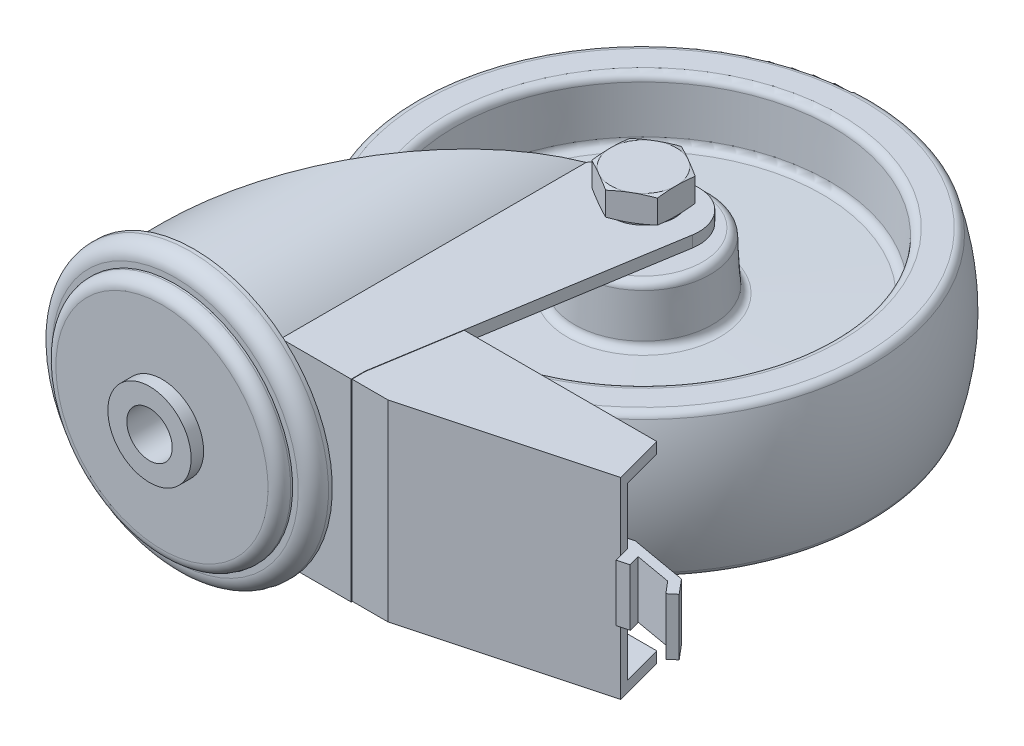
ISO-10303-21;
HEADER;
FILE_DESCRIPTION(('STEP AP214'),'2;1');
FILE_NAME('part.step','',(''),(''),'','','');
FILE_SCHEMA(('AUTOMOTIVE_DESIGN { 1 0 10303 214 1 1 1 1 }'));
ENDSEC;
DATA;
#1=APPLICATION_CONTEXT('core data for automotive mechanical design processes');
#2=APPLICATION_PROTOCOL_DEFINITION('international standard','automotive_design',2000,#1);
#3=PRODUCT_CONTEXT('',#1,'mechanical');
#4=PRODUCT('Part','Part','',(#3));
#5=PRODUCT_RELATED_PRODUCT_CATEGORY('part','',(#4));
#6=PRODUCT_DEFINITION_FORMATION('','',#4);
#7=PRODUCT_DEFINITION_CONTEXT('part definition',#1,'design');
#8=PRODUCT_DEFINITION('design','',#6,#7);
#9=PRODUCT_DEFINITION_SHAPE('','',#8);
#10=(LENGTH_UNIT() NAMED_UNIT(*) SI_UNIT(.MILLI.,.METRE.));
#11=(NAMED_UNIT(*) PLANE_ANGLE_UNIT() SI_UNIT($,.RADIAN.));
#12=(NAMED_UNIT(*) SI_UNIT($,.STERADIAN.) SOLID_ANGLE_UNIT());
#13=UNCERTAINTY_MEASURE_WITH_UNIT(LENGTH_MEASURE(1.E-05),#10,'distance_accuracy_value','');
#14=(GEOMETRIC_REPRESENTATION_CONTEXT(3) GLOBAL_UNCERTAINTY_ASSIGNED_CONTEXT((#13)) GLOBAL_UNIT_ASSIGNED_CONTEXT((#10,
#11,#12)) REPRESENTATION_CONTEXT('',''));
#15=CARTESIAN_POINT('',(0.,0.,0.));
#16=DIRECTION('',(0.,0.,1.));
#17=DIRECTION('',(1.,0.,0.));
#18=AXIS2_PLACEMENT_3D('',#15,#16,#17);
#19=CARTESIAN_POINT('',(21.39792913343,-19.,-93.5));
#20=DIRECTION('',(0.,-1.,0.));
#21=DIRECTION('',(1.,0.,0.));
#22=AXIS2_PLACEMENT_3D('',#19,#20,#21);
#23=PLANE('',#22);
#24=CARTESIAN_POINT('',(37.,-19.,-93.5));
#25=DIRECTION('',(0.,1.,0.));
#26=DIRECTION('',(-1.,0.,0.));
#27=AXIS2_PLACEMENT_3D('',#24,#25,#26);
#28=CIRCLE('',#27,7.5);
#29=CARTESIAN_POINT('',(29.5,-19.,-93.5));
#30=VERTEX_POINT('',#29);
#31=EDGE_CURVE('E9',#30,#30,#28,.T.);
#32=ORIENTED_EDGE('',*,*,#31,.T.);
#33=EDGE_LOOP('',(#32));
#34=FACE_BOUND('',#33,.T.);
#35=CARTESIAN_POINT('',(37.,-19.,-93.5));
#36=DIRECTION('',(0.,1.,0.));
#37=DIRECTION('',(-1.,0.,0.));
#38=AXIS2_PLACEMENT_3D('',#35,#36,#37);
#39=CIRCLE('',#38,15.60207086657);
#40=CARTESIAN_POINT('',(21.39792913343,-19.,-93.5));
#41=VERTEX_POINT('',#40);
#42=EDGE_CURVE('E3151',#41,#41,#39,.T.);
#43=ORIENTED_EDGE('',*,*,#42,.F.);
#44=EDGE_LOOP('',(#43));
#45=FACE_BOUND('',#44,.T.);
#46=ADVANCED_FACE('F14',(#34,#45),#23,.T.);
#47=CARTESIAN_POINT('',(29.5,19.,-93.5));
#48=DIRECTION('',(0.,1.,0.));
#49=DIRECTION('',(-1.,0.,0.));
#50=AXIS2_PLACEMENT_3D('',#47,#48,#49);
#51=PLANE('',#50);
#52=CARTESIAN_POINT('',(37.,19.,-93.5));
#53=DIRECTION('',(0.,1.,0.));
#54=DIRECTION('',(-1.,0.,0.));
#55=AXIS2_PLACEMENT_3D('',#52,#53,#54);
#56=CIRCLE('',#55,15.60207086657);
#57=CARTESIAN_POINT('',(21.39792913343,19.,-93.5));
#58=VERTEX_POINT('',#57);
#59=EDGE_CURVE('E3106',#58,#58,#56,.T.);
#60=ORIENTED_EDGE('',*,*,#59,.T.);
#61=EDGE_LOOP('',(#60));
#62=FACE_BOUND('',#61,.T.);
#63=CARTESIAN_POINT('',(37.,19.,-93.5));
#64=DIRECTION('',(0.,1.,0.));
#65=DIRECTION('',(-1.,0.,0.));
#66=AXIS2_PLACEMENT_3D('',#63,#64,#65);
#67=CIRCLE('',#66,7.5);
#68=CARTESIAN_POINT('',(29.5,19.,-93.5));
#69=VERTEX_POINT('',#68);
#70=EDGE_CURVE('E24',#69,#69,#67,.T.);
#71=ORIENTED_EDGE('',*,*,#70,.F.);
#72=EDGE_LOOP('',(#71));
#73=FACE_BOUND('',#72,.T.);
#74=ADVANCED_FACE('F1398',(#62,#73),#51,.T.);
#75=CARTESIAN_POINT('',(37.,17.000000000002,-93.5));
#76=DIRECTION('',(0.,1.,0.));
#77=DIRECTION('',(-1.,0.,0.));
#78=AXIS2_PLACEMENT_3D('',#75,#76,#77);
#79=TOROIDAL_SURFACE('',#78,15.6020708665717,1.99999999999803);
#80=CARTESIAN_POINT('',(37.,17.104671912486,-93.5));
#81=DIRECTION('',(0.,1.,0.));
#82=DIRECTION('',(-1.,0.,0.));
#83=AXIS2_PLACEMENT_3D('',#80,#81,#82);
#84=CIRCLE('',#83,17.599329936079);
#85=CARTESIAN_POINT('',(19.400670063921,17.104671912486,-93.5));
#86=VERTEX_POINT('',#85);
#87=EDGE_CURVE('E3109',#86,#86,#84,.T.);
#88=ORIENTED_EDGE('',*,*,#87,.T.);
#89=EDGE_LOOP('',(#88));
#90=FACE_BOUND('',#89,.T.);
#91=ORIENTED_EDGE('',*,*,#59,.F.);
#92=EDGE_LOOP('',(#91));
#93=FACE_BOUND('',#92,.T.);
#94=ADVANCED_FACE('F1387',(#90,#93),#79,.T.);
#95=CARTESIAN_POINT('',(37.,17.104671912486,-93.5));
#96=DIRECTION('',(0.,-1.,0.));
#97=DIRECTION('',(1.,0.,0.));
#98=AXIS2_PLACEMENT_3D('',#95,#96,#97);
#99=CONICAL_SURFACE('',#98,17.599329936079,0.0523598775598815);
#100=CARTESIAN_POINT('',(37.,5.9417897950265,-93.5));
#101=DIRECTION('',(0.,1.,0.));
#102=DIRECTION('',(-1.,0.,0.));
#103=AXIS2_PLACEMENT_3D('',#100,#101,#102);
#104=CIRCLE('',#103,18.184351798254);
#105=CARTESIAN_POINT('',(18.815648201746,5.9417897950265,-93.5));
#106=VERTEX_POINT('',#105);
#107=EDGE_CURVE('E3112',#106,#106,#104,.T.);
#108=ORIENTED_EDGE('',*,*,#107,.T.);
#109=EDGE_LOOP('',(#108));
#110=FACE_BOUND('',#109,.T.);
#111=ORIENTED_EDGE('',*,*,#87,.F.);
#112=EDGE_LOOP('',(#111));
#113=FACE_BOUND('',#112,.T.);
#114=ADVANCED_FACE('F1376',(#110,#113),#99,.T.);
#115=CARTESIAN_POINT('',(37.,6.0464617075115,-93.5));
#116=DIRECTION('',(0.,1.,0.));
#117=DIRECTION('',(-1.,0.,0.));
#118=AXIS2_PLACEMENT_3D('',#115,#116,#117);
#119=TOROIDAL_SURFACE('',#118,20.1816108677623,1.99999999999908);
#120=CARTESIAN_POINT('',(37.,4.0476800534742,-93.5));
#121=DIRECTION('',(0.,1.,0.));
#122=DIRECTION('',(-1.,0.,0.));
#123=AXIS2_PLACEMENT_3D('',#120,#121,#122);
#124=CIRCLE('',#123,20.111811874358);
#125=CARTESIAN_POINT('',(16.888188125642,4.0476800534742,-93.5));
#126=VERTEX_POINT('',#125);
#127=EDGE_CURVE('E3115',#126,#126,#124,.T.);
#128=ORIENTED_EDGE('',*,*,#127,.T.);
#129=EDGE_LOOP('',(#128));
#130=FACE_BOUND('',#129,.T.);
#131=ORIENTED_EDGE('',*,*,#107,.F.);
#132=EDGE_LOOP('',(#131));
#133=FACE_BOUND('',#132,.T.);
#134=ADVANCED_FACE('F1365',(#130,#133),#119,.F.);
#135=CARTESIAN_POINT('',(37.,4.0476800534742,-93.5));
#136=DIRECTION('',(0.,-1.,0.));
#137=DIRECTION('',(1.,0.,0.));
#138=AXIS2_PLACEMENT_3D('',#135,#136,#137);
#139=CONICAL_SURFACE('',#138,20.111811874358,1.53588974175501);
#140=CARTESIAN_POINT('',(37.,3.1017739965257,-93.5));
#141=DIRECTION('',(0.,1.,0.));
#142=DIRECTION('',(-1.,0.,0.));
#143=AXIS2_PLACEMENT_3D('',#140,#141,#142);
#144=CIRCLE('',#143,47.199017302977);
#145=CARTESIAN_POINT('',(-10.199017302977,3.1017739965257,-93.5));
#146=VERTEX_POINT('',#145);
#147=EDGE_CURVE('E3118',#146,#146,#144,.T.);
#148=ORIENTED_EDGE('',*,*,#147,.T.);
#149=EDGE_LOOP('',(#148));
#150=FACE_BOUND('',#149,.T.);
#151=ORIENTED_EDGE('',*,*,#127,.F.);
#152=EDGE_LOOP('',(#151));
#153=FACE_BOUND('',#152,.T.);
#154=ADVANCED_FACE('F1354',(#150,#153),#139,.T.);
#155=CARTESIAN_POINT('',(37.,5.1005556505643,-93.5));
#156=DIRECTION('',(0.,1.,0.));
#157=DIRECTION('',(-1.,0.,0.));
#158=AXIS2_PLACEMENT_3D('',#155,#156,#157);
#159=TOROIDAL_SURFACE('',#158,47.2688162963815,2.00000000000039);
#160=CARTESIAN_POINT('',(37.,4.995883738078,-93.5));
#161=DIRECTION('',(0.,1.,0.));
#162=DIRECTION('',(-1.,0.,0.));
#163=AXIS2_PLACEMENT_3D('',#160,#161,#162);
#164=CIRCLE('',#163,49.266075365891);
#165=CARTESIAN_POINT('',(-12.266075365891,4.995883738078,-93.5));
#166=VERTEX_POINT('',#165);
#167=EDGE_CURVE('E3121',#166,#166,#164,.T.);
#168=ORIENTED_EDGE('',*,*,#167,.T.);
#169=EDGE_LOOP('',(#168));
#170=FACE_BOUND('',#169,.T.);
#171=ORIENTED_EDGE('',*,*,#147,.F.);
#172=EDGE_LOOP('',(#171));
#173=FACE_BOUND('',#172,.T.);
#174=ADVANCED_FACE('F1343',(#170,#173),#159,.F.);
#175=CARTESIAN_POINT('',(37.,4.995883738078,-93.5));
#176=DIRECTION('',(0.,1.,0.));
#177=DIRECTION('',(-1.,0.,0.));
#178=AXIS2_PLACEMENT_3D('',#175,#176,#177);
#179=CONICAL_SURFACE('',#178,49.266075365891,0.0523598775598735);
#180=CARTESIAN_POINT('',(37.,17.104671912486,-93.5));
#181=DIRECTION('',(0.,1.,0.));
#182=DIRECTION('',(-1.,0.,0.));
#183=AXIS2_PLACEMENT_3D('',#180,#181,#182);
#184=CIRCLE('',#183,49.900670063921);
#185=CARTESIAN_POINT('',(-12.900670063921,17.104671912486,-93.5));
#186=VERTEX_POINT('',#185);
#187=EDGE_CURVE('E3124',#186,#186,#184,.T.);
#188=ORIENTED_EDGE('',*,*,#187,.T.);
#189=EDGE_LOOP('',(#188));
#190=FACE_BOUND('',#189,.T.);
#191=ORIENTED_EDGE('',*,*,#167,.F.);
#192=EDGE_LOOP('',(#191));
#193=FACE_BOUND('',#192,.T.);
#194=ADVANCED_FACE('F1332',(#190,#193),#179,.F.);
#195=CARTESIAN_POINT('',(37.,17.000000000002,-93.5));
#196=DIRECTION('',(0.,1.,0.));
#197=DIRECTION('',(-1.,0.,0.));
#198=AXIS2_PLACEMENT_3D('',#195,#196,#197);
#199=TOROIDAL_SURFACE('',#198,51.8979291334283,1.99999999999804);
#200=CARTESIAN_POINT('',(37.,19.,-93.5));
#201=DIRECTION('',(0.,1.,0.));
#202=DIRECTION('',(-1.,0.,0.));
#203=AXIS2_PLACEMENT_3D('',#200,#201,#202);
#204=CIRCLE('',#203,51.89792913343);
#205=CARTESIAN_POINT('',(-14.89792913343,19.,-93.5));
#206=VERTEX_POINT('',#205);
#207=EDGE_CURVE('E3127',#206,#206,#204,.T.);
#208=ORIENTED_EDGE('',*,*,#207,.T.);
#209=EDGE_LOOP('',(#208));
#210=FACE_BOUND('',#209,.T.);
#211=ORIENTED_EDGE('',*,*,#187,.F.);
#212=EDGE_LOOP('',(#211));
#213=FACE_BOUND('',#212,.T.);
#214=ADVANCED_FACE('F1321',(#210,#213),#199,.T.);
#215=CARTESIAN_POINT('',(-14.89792913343,19.,-93.5));
#216=DIRECTION('',(0.,1.,0.));
#217=DIRECTION('',(-1.,0.,0.));
#218=AXIS2_PLACEMENT_3D('',#215,#216,#217);
#219=PLANE('',#218);
#220=CARTESIAN_POINT('',(37.,19.,-93.5));
#221=DIRECTION('',(0.,1.,0.));
#222=DIRECTION('',(-1.,0.,0.));
#223=AXIS2_PLACEMENT_3D('',#220,#221,#222);
#224=CIRCLE('',#223,58.062466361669);
#225=CARTESIAN_POINT('',(-21.062466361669,19.,-93.5));
#226=VERTEX_POINT('',#225);
#227=EDGE_CURVE('E3154',#226,#226,#224,.T.);
#228=ORIENTED_EDGE('',*,*,#227,.T.);
#229=EDGE_LOOP('',(#228));
#230=FACE_BOUND('',#229,.T.);
#231=ORIENTED_EDGE('',*,*,#207,.F.);
#232=EDGE_LOOP('',(#231));
#233=FACE_BOUND('',#232,.T.);
#234=ADVANCED_FACE('F1310',(#230,#233),#219,.T.);
#235=CARTESIAN_POINT('',(-20.5,-19.,-93.5));
#236=DIRECTION('',(0.,-1.,0.));
#237=DIRECTION('',(1.,0.,0.));
#238=AXIS2_PLACEMENT_3D('',#235,#236,#237);
#239=PLANE('',#238);
#240=CARTESIAN_POINT('',(37.,-19.,-93.5));
#241=DIRECTION('',(0.,1.,0.));
#242=DIRECTION('',(-1.,0.,0.));
#243=AXIS2_PLACEMENT_3D('',#240,#241,#242);
#244=CIRCLE('',#243,58.062466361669);
#245=CARTESIAN_POINT('',(-21.062466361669,-19.,-93.5));
#246=VERTEX_POINT('',#245);
#247=EDGE_CURVE('E3163',#246,#246,#244,.T.);
#248=ORIENTED_EDGE('',*,*,#247,.F.);
#249=EDGE_LOOP('',(#248));
#250=FACE_BOUND('',#249,.T.);
#251=CARTESIAN_POINT('',(37.,-19.,-93.5));
#252=DIRECTION('',(0.,1.,0.));
#253=DIRECTION('',(-1.,0.,0.));
#254=AXIS2_PLACEMENT_3D('',#251,#252,#253);
#255=CIRCLE('',#254,51.89792913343);
#256=CARTESIAN_POINT('',(-14.89792913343,-19.,-93.5));
#257=VERTEX_POINT('',#256);
#258=EDGE_CURVE('E3130',#257,#257,#255,.T.);
#259=ORIENTED_EDGE('',*,*,#258,.T.);
#260=EDGE_LOOP('',(#259));
#261=FACE_BOUND('',#260,.T.);
#262=ADVANCED_FACE('F1299',(#250,#261),#239,.T.);
#263=CARTESIAN_POINT('',(37.,-17.000000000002,-93.5));
#264=DIRECTION('',(0.,1.,0.));
#265=DIRECTION('',(-1.,0.,0.));
#266=AXIS2_PLACEMENT_3D('',#263,#264,#265);
#267=TOROIDAL_SURFACE('',#266,51.8979291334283,1.99999999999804);
#268=CARTESIAN_POINT('',(37.,-17.104671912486,-93.5));
#269=DIRECTION('',(0.,1.,0.));
#270=DIRECTION('',(-1.,0.,0.));
#271=AXIS2_PLACEMENT_3D('',#268,#269,#270);
#272=CIRCLE('',#271,49.900670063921);
#273=CARTESIAN_POINT('',(-12.900670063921,-17.104671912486,-93.5));
#274=VERTEX_POINT('',#273);
#275=EDGE_CURVE('E3133',#274,#274,#272,.T.);
#276=ORIENTED_EDGE('',*,*,#275,.T.);
#277=EDGE_LOOP('',(#276));
#278=FACE_BOUND('',#277,.T.);
#279=ORIENTED_EDGE('',*,*,#258,.F.);
#280=EDGE_LOOP('',(#279));
#281=FACE_BOUND('',#280,.T.);
#282=ADVANCED_FACE('F1288',(#278,#281),#267,.T.);
#283=CARTESIAN_POINT('',(37.,-17.104671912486,-93.5));
#284=DIRECTION('',(0.,-1.,0.));
#285=DIRECTION('',(1.,0.,0.));
#286=AXIS2_PLACEMENT_3D('',#283,#284,#285);
#287=CONICAL_SURFACE('',#286,49.900670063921,0.0523598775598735);
#288=CARTESIAN_POINT('',(37.,-4.99588373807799,-93.5));
#289=DIRECTION('',(0.,1.,0.));
#290=DIRECTION('',(-1.,0.,0.));
#291=AXIS2_PLACEMENT_3D('',#288,#289,#290);
#292=CIRCLE('',#291,49.266075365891);
#293=CARTESIAN_POINT('',(-12.266075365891,-4.99588373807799,-93.5));
#294=VERTEX_POINT('',#293);
#295=EDGE_CURVE('E3136',#294,#294,#292,.T.);
#296=ORIENTED_EDGE('',*,*,#295,.T.);
#297=EDGE_LOOP('',(#296));
#298=FACE_BOUND('',#297,.T.);
#299=ORIENTED_EDGE('',*,*,#275,.F.);
#300=EDGE_LOOP('',(#299));
#301=FACE_BOUND('',#300,.T.);
#302=ADVANCED_FACE('F1277',(#298,#301),#287,.F.);
#303=CARTESIAN_POINT('',(37.,-5.1005556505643,-93.5));
#304=DIRECTION('',(0.,1.,0.));
#305=DIRECTION('',(-1.,0.,0.));
#306=AXIS2_PLACEMENT_3D('',#303,#304,#305);
#307=TOROIDAL_SURFACE('',#306,47.2688162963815,2.00000000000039);
#308=CARTESIAN_POINT('',(37.,-3.1017739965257,-93.5));
#309=DIRECTION('',(0.,1.,0.));
#310=DIRECTION('',(-1.,0.,0.));
#311=AXIS2_PLACEMENT_3D('',#308,#309,#310);
#312=CIRCLE('',#311,47.199017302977);
#313=CARTESIAN_POINT('',(-10.199017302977,-3.1017739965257,-93.5));
#314=VERTEX_POINT('',#313);
#315=EDGE_CURVE('E3139',#314,#314,#312,.T.);
#316=ORIENTED_EDGE('',*,*,#315,.T.);
#317=EDGE_LOOP('',(#316));
#318=FACE_BOUND('',#317,.T.);
#319=ORIENTED_EDGE('',*,*,#295,.F.);
#320=EDGE_LOOP('',(#319));
#321=FACE_BOUND('',#320,.T.);
#322=ADVANCED_FACE('F1266',(#318,#321),#307,.F.);
#323=CARTESIAN_POINT('',(37.,-3.1017739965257,-93.5));
#324=DIRECTION('',(0.,1.,0.));
#325=DIRECTION('',(-1.,0.,0.));
#326=AXIS2_PLACEMENT_3D('',#323,#324,#325);
#327=CONICAL_SURFACE('',#326,47.199017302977,1.53588974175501);
#328=CARTESIAN_POINT('',(37.,-4.0476800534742,-93.5));
#329=DIRECTION('',(0.,1.,0.));
#330=DIRECTION('',(-1.,0.,0.));
#331=AXIS2_PLACEMENT_3D('',#328,#329,#330);
#332=CIRCLE('',#331,20.111811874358);
#333=CARTESIAN_POINT('',(16.888188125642,-4.0476800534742,-93.5));
#334=VERTEX_POINT('',#333);
#335=EDGE_CURVE('E3142',#334,#334,#332,.T.);
#336=ORIENTED_EDGE('',*,*,#335,.T.);
#337=EDGE_LOOP('',(#336));
#338=FACE_BOUND('',#337,.T.);
#339=ORIENTED_EDGE('',*,*,#315,.F.);
#340=EDGE_LOOP('',(#339));
#341=FACE_BOUND('',#340,.T.);
#342=ADVANCED_FACE('F1255',(#338,#341),#327,.T.);
#343=CARTESIAN_POINT('',(37.,-6.0464617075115,-93.5));
#344=DIRECTION('',(0.,1.,0.));
#345=DIRECTION('',(-1.,0.,0.));
#346=AXIS2_PLACEMENT_3D('',#343,#344,#345);
#347=TOROIDAL_SURFACE('',#346,20.1816108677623,1.99999999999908);
#348=CARTESIAN_POINT('',(37.,-5.9417897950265,-93.5));
#349=DIRECTION('',(0.,1.,0.));
#350=DIRECTION('',(-1.,0.,0.));
#351=AXIS2_PLACEMENT_3D('',#348,#349,#350);
#352=CIRCLE('',#351,18.184351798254);
#353=CARTESIAN_POINT('',(18.815648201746,-5.9417897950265,-93.5));
#354=VERTEX_POINT('',#353);
#355=EDGE_CURVE('E3145',#354,#354,#352,.T.);
#356=ORIENTED_EDGE('',*,*,#355,.T.);
#357=EDGE_LOOP('',(#356));
#358=FACE_BOUND('',#357,.T.);
#359=ORIENTED_EDGE('',*,*,#335,.F.);
#360=EDGE_LOOP('',(#359));
#361=FACE_BOUND('',#360,.T.);
#362=ADVANCED_FACE('F1244',(#358,#361),#347,.F.);
#363=CARTESIAN_POINT('',(37.,-5.9417897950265,-93.5));
#364=DIRECTION('',(0.,1.,0.));
#365=DIRECTION('',(-1.,0.,0.));
#366=AXIS2_PLACEMENT_3D('',#363,#364,#365);
#367=CONICAL_SURFACE('',#366,18.184351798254,0.0523598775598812);
#368=CARTESIAN_POINT('',(37.,-17.104671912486,-93.5));
#369=DIRECTION('',(0.,1.,0.));
#370=DIRECTION('',(-1.,0.,0.));
#371=AXIS2_PLACEMENT_3D('',#368,#369,#370);
#372=CIRCLE('',#371,17.599329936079);
#373=CARTESIAN_POINT('',(19.400670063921,-17.104671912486,-93.5));
#374=VERTEX_POINT('',#373);
#375=EDGE_CURVE('E3148',#374,#374,#372,.T.);
#376=ORIENTED_EDGE('',*,*,#375,.T.);
#377=EDGE_LOOP('',(#376));
#378=FACE_BOUND('',#377,.T.);
#379=ORIENTED_EDGE('',*,*,#355,.F.);
#380=EDGE_LOOP('',(#379));
#381=FACE_BOUND('',#380,.T.);
#382=ADVANCED_FACE('F1233',(#378,#381),#367,.T.);
#383=CARTESIAN_POINT('',(37.,-17.000000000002,-93.5));
#384=DIRECTION('',(0.,1.,0.));
#385=DIRECTION('',(-1.,0.,0.));
#386=AXIS2_PLACEMENT_3D('',#383,#384,#385);
#387=TOROIDAL_SURFACE('',#386,15.6020708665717,1.99999999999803);
#388=ORIENTED_EDGE('',*,*,#42,.T.);
#389=EDGE_LOOP('',(#388));
#390=FACE_BOUND('',#389,.T.);
#391=ORIENTED_EDGE('',*,*,#375,.F.);
#392=EDGE_LOOP('',(#391));
#393=FACE_BOUND('',#392,.T.);
#394=ADVANCED_FACE('F1221',(#390,#393),#387,.T.);
#395=CARTESIAN_POINT('',(37.,16.9999999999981,-93.5));
#396=DIRECTION('',(0.,1.,0.));
#397=DIRECTION('',(-1.,0.,0.));
#398=AXIS2_PLACEMENT_3D('',#395,#396,#397);
#399=TOROIDAL_SURFACE('',#398,58.0624663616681,2.0000000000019);
#400=CARTESIAN_POINT('',(37.,17.561983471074,-93.5));
#401=DIRECTION('',(0.,1.,0.));
#402=DIRECTION('',(-1.,0.,0.));
#403=AXIS2_PLACEMENT_3D('',#400,#401,#402);
#404=CIRCLE('',#403,59.981886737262);
#405=CARTESIAN_POINT('',(-22.9818867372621,17.561983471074,-93.5));
#406=VERTEX_POINT('',#405);
#407=EDGE_CURVE('E3157',#406,#406,#404,.T.);
#408=ORIENTED_EDGE('',*,*,#407,.T.);
#409=EDGE_LOOP('',(#408));
#410=FACE_BOUND('',#409,.T.);
#411=ORIENTED_EDGE('',*,*,#227,.F.);
#412=EDGE_LOOP('',(#411));
#413=FACE_BOUND('',#412,.T.);
#414=ADVANCED_FACE('F1210',(#410,#413),#399,.T.);
#415=CARTESIAN_POINT('',(37.0000000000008,0.,-93.5));
#416=DIRECTION('',(0.,1.,0.));
#417=DIRECTION('',(-1.,0.,0.));
#418=AXIS2_PLACEMENT_3D('',#415,#416,#417);
#419=SPHERICAL_SURFACE('',#418,62.5000000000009);
#420=CARTESIAN_POINT('',(37.,-17.561983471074,-93.5));
#421=DIRECTION('',(0.,1.,0.));
#422=DIRECTION('',(-1.,0.,0.));
#423=AXIS2_PLACEMENT_3D('',#420,#421,#422);
#424=CIRCLE('',#423,59.981886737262);
#425=CARTESIAN_POINT('',(-22.9818867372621,-17.561983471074,-93.5));
#426=VERTEX_POINT('',#425);
#427=EDGE_CURVE('E3160',#426,#426,#424,.T.);
#428=CARTESIAN_POINT('',(-22.9818867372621,-17.561983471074,-93.5));
#429=CARTESIAN_POINT('',(-23.0860981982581,-17.2060568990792,-93.5));
#430=CARTESIAN_POINT('',(-23.1871408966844,-16.8492025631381,-93.5));
#431=CARTESIAN_POINT('',(-23.3828583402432,-16.1337518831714,-93.5));
#432=CARTESIAN_POINT('',(-23.4775330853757,-15.7751555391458,-93.5));
#433=CARTESIAN_POINT('',(-23.660484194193,-15.0563343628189,-93.5));
#434=CARTESIAN_POINT('',(-23.7487605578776,-14.6961095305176,-93.5));
#435=CARTESIAN_POINT('',(-23.9188870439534,-13.9741455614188,-93.5));
#436=CARTESIAN_POINT('',(-24.0007371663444,-13.6124064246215,-93.5));
#437=CARTESIAN_POINT('',(-24.1579852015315,-12.8875284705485,-93.5));
#438=CARTESIAN_POINT('',(-24.2333831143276,-12.5243896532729,-93.5));
#439=CARTESIAN_POINT('',(-24.3777028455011,-11.7968274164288,-93.5));
#440=CARTESIAN_POINT('',(-24.4466246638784,-11.4324039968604,-93.5));
#441=CARTESIAN_POINT('',(-24.5779703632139,-10.7023880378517,-93.5));
#442=CARTESIAN_POINT('',(-24.640394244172,-10.3367954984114,-93.5));
#443=CARTESIAN_POINT('',(-24.7587242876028,-9.60455715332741,-93.5));
#444=CARTESIAN_POINT('',(-24.8146304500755,-9.23791134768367,-93.5));
#445=CARTESIAN_POINT('',(-24.919907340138,-8.50368265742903,-93.5));
#446=CARTESIAN_POINT('',(-24.9692780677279,-8.13609977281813,-93.5));
#447=CARTESIAN_POINT('',(-25.0614684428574,-7.40011340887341,-93.5));
#448=CARTESIAN_POINT('',(-25.104288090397,-7.03170992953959,-93.5));
#449=CARTESIAN_POINT('',(-25.1833627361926,-6.29419912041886,-93.5));
#450=CARTESIAN_POINT('',(-25.2196177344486,-5.92509179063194,-93.5));
#451=CARTESIAN_POINT('',(-25.2855515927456,-5.18629024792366,-93.5));
#452=CARTESIAN_POINT('',(-25.3152304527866,-4.81659603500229,-93.5));
#453=CARTESIAN_POINT('',(-25.3680026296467,-4.07673787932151,-93.5));
#454=CARTESIAN_POINT('',(-25.3910959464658,-3.70657393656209,-93.5));
#455=CARTESIAN_POINT('',(-25.4306897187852,-2.96589362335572,-93.5));
#456=CARTESIAN_POINT('',(-25.4471901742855,-2.59537725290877,-93.5));
#457=CARTESIAN_POINT('',(-25.4735929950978,-1.85410949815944,-93.5));
#458=CARTESIAN_POINT('',(-25.4834953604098,-1.48335811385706,-93.5));
#459=CARTESIAN_POINT('',(-25.4966988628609,-0.741737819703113,-93.5));
#460=CARTESIAN_POINT('',(-25.5000000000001,-0.370868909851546,-93.5));
#461=CARTESIAN_POINT('',(-25.5000000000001,0.370868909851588,-93.5));
#462=CARTESIAN_POINT('',(-25.4966988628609,0.741737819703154,-93.5));
#463=CARTESIAN_POINT('',(-25.4834953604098,1.4833581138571,-93.5));
#464=CARTESIAN_POINT('',(-25.4735929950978,1.85410949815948,-93.5));
#465=CARTESIAN_POINT('',(-25.4471901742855,2.59537725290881,-93.5));
#466=CARTESIAN_POINT('',(-25.4306897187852,2.96589362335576,-93.5));
#467=CARTESIAN_POINT('',(-25.3910959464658,3.70657393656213,-93.5));
#468=CARTESIAN_POINT('',(-25.3680026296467,4.07673787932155,-93.5));
#469=CARTESIAN_POINT('',(-25.3152304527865,4.81659603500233,-93.5));
#470=CARTESIAN_POINT('',(-25.2855515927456,5.1862902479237,-93.5));
#471=CARTESIAN_POINT('',(-25.2196177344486,5.92509179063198,-93.5));
#472=CARTESIAN_POINT('',(-25.1833627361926,6.2941991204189,-93.5));
#473=CARTESIAN_POINT('',(-25.104288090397,7.03170992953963,-93.5));
#474=CARTESIAN_POINT('',(-25.0614684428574,7.40011340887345,-93.5));
#475=CARTESIAN_POINT('',(-24.9692780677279,8.13609977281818,-93.5));
#476=CARTESIAN_POINT('',(-24.919907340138,8.50368265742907,-93.5));
#477=CARTESIAN_POINT('',(-24.8146304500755,9.23791134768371,-93.5));
#478=CARTESIAN_POINT('',(-24.7587242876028,9.60455715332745,-93.5));
#479=CARTESIAN_POINT('',(-24.640394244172,10.3367954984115,-93.5));
#480=CARTESIAN_POINT('',(-24.5779703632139,10.7023880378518,-93.5));
#481=CARTESIAN_POINT('',(-24.4466246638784,11.4324039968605,-93.5));
#482=CARTESIAN_POINT('',(-24.377702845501,11.7968274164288,-93.5));
#483=CARTESIAN_POINT('',(-24.2333831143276,12.5243896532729,-93.5));
#484=CARTESIAN_POINT('',(-24.1579852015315,12.8875284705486,-93.5));
#485=CARTESIAN_POINT('',(-24.0007371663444,13.6124064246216,-93.5));
#486=CARTESIAN_POINT('',(-23.9188870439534,13.9741455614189,-93.5));
#487=CARTESIAN_POINT('',(-23.7487605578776,14.6961095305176,-93.5));
#488=CARTESIAN_POINT('',(-23.660484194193,15.056334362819,-93.5));
#489=CARTESIAN_POINT('',(-23.4775330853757,15.7751555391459,-93.5));
#490=CARTESIAN_POINT('',(-23.3828583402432,16.1337518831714,-93.5));
#491=CARTESIAN_POINT('',(-23.1871408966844,16.8492025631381,-93.5));
#492=CARTESIAN_POINT('',(-23.0860981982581,17.2060568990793,-93.5));
#493=CARTESIAN_POINT('',(-22.9818867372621,17.561983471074,-93.5));
#494=B_SPLINE_CURVE_WITH_KNOTS('',3,(#428,#429,#430,#431,#432,#433,#434,#435,#436,#437,#438,
#439,#440,#441,#442,#443,#444,#445,#446,#447,#448,#449,#450,#451,#452,#453,#454,#455,#456,#457,
#458,#459,#460,#461,#462,#463,#464,#465,#466,#467,#468,#469,#470,#471,#472,#473,#474,#475,#476,
#477,#478,#479,#480,#481,#482,#483,#484,#485,#486,#487,#488,#489,#490,#491,#492,#493),
.UNSPECIFIED.,.F.,.F.,(4,2,2,2,2,2,2,2,2,2,2,2,2,2,2,2,2,2,2,2,2,2,2,2,2,2,2,2,2,2,2,2,4),(0.,
1.11259203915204,2.2251840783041,3.33777611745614,4.45036815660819,5.56296019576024,
6.67555223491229,7.78814427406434,8.90073631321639,10.0133283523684,11.1259203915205,
12.2385124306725,13.3511044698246,14.4636965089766,15.5762885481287,16.6888805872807,
17.8014726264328,18.9140646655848,20.0266567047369,21.1392487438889,22.251840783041,
23.364432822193,24.4770248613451,25.5896169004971,26.7022089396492,27.8148009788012,
28.9273930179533,30.0399850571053,31.1525770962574,32.2651691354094,33.3777611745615,
34.4903532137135,35.6029452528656),.UNSPECIFIED.);
#495=EDGE_CURVE('BSEAM1198',#426,#406,#494,.T.);
#496=ORIENTED_EDGE('',*,*,#427,.T.);
#497=ORIENTED_EDGE('',*,*,#407,.F.);
#498=ORIENTED_EDGE('',*,*,#495,.T.);
#499=ORIENTED_EDGE('',*,*,#495,.F.);
#500=EDGE_LOOP('',(#496,#498,#497,#499));
#501=FACE_BOUND('',#500,.T.);
#502=ADVANCED_FACE('F1198',(#501),#419,.T.);
#503=CARTESIAN_POINT('',(37.,-16.9999999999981,-93.5));
#504=DIRECTION('',(0.,1.,0.));
#505=DIRECTION('',(-1.,0.,0.));
#506=AXIS2_PLACEMENT_3D('',#503,#504,#505);
#507=TOROIDAL_SURFACE('',#506,58.0624663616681,2.0000000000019);
#508=ORIENTED_EDGE('',*,*,#247,.T.);
#509=EDGE_LOOP('',(#508));
#510=FACE_BOUND('',#509,.T.);
#511=ORIENTED_EDGE('',*,*,#427,.F.);
#512=EDGE_LOOP('',(#511));
#513=FACE_BOUND('',#512,.T.);
#514=ADVANCED_FACE('F627',(#510,#513),#507,.T.);
#515=CARTESIAN_POINT('',(37.,-40.5,-98.4265));
#516=DIRECTION('',(0.,-1.,0.));
#517=DIRECTION('',(-1.,0.,0.));
#518=AXIS2_PLACEMENT_3D('',#515,#516,#517);
#519=PLANE('',#518);
#520=CARTESIAN_POINT('',(37.,-40.5,-93.5));
#521=DIRECTION('',(0.,1.,0.));
#522=DIRECTION('',(1.,0.,0.));
#523=AXIS2_PLACEMENT_3D('',#520,#521,#522);
#524=CIRCLE('',#523,4.9265);
#525=CARTESIAN_POINT('',(41.9265,-40.5,-93.5));
#526=VERTEX_POINT('',#525);
#527=EDGE_CURVE('E859',#526,#526,#524,.T.);
#528=ORIENTED_EDGE('',*,*,#527,.F.);
#529=EDGE_LOOP('',(#528));
#530=FACE_BOUND('',#529,.T.);
#531=ADVANCED_FACE('F609',(#530),#519,.T.);
#532=CARTESIAN_POINT('',(37.,-39.4265,-93.5));
#533=DIRECTION('',(0.,1.,0.));
#534=DIRECTION('',(1.,0.,0.));
#535=AXIS2_PLACEMENT_3D('',#532,#533,#534);
#536=CONICAL_SURFACE('',#535,6.,0.785398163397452);
#537=ORIENTED_EDGE('',*,*,#527,.T.);
#538=EDGE_LOOP('',(#537));
#539=FACE_BOUND('',#538,.T.);
#540=CARTESIAN_POINT('',(37.,-39.4265,-93.5));
#541=DIRECTION('',(0.,1.,0.));
#542=DIRECTION('',(1.,0.,0.));
#543=AXIS2_PLACEMENT_3D('',#540,#541,#542);
#544=CIRCLE('',#543,6.);
#545=CARTESIAN_POINT('',(43.,-39.4265,-93.5));
#546=VERTEX_POINT('',#545);
#547=EDGE_CURVE('E854',#546,#546,#544,.T.);
#548=ORIENTED_EDGE('',*,*,#547,.F.);
#549=EDGE_LOOP('',(#548));
#550=FACE_BOUND('',#549,.T.);
#551=ADVANCED_FACE('F788',(#539,#550),#536,.T.);
#552=CARTESIAN_POINT('',(37.,-40.5,-93.5));
#553=DIRECTION('',(0.,1.,0.));
#554=DIRECTION('',(1.,0.,0.));
#555=AXIS2_PLACEMENT_3D('',#552,#553,#554);
#556=CYLINDRICAL_SURFACE('',#555,6.);
#557=ORIENTED_EDGE('',*,*,#547,.T.);
#558=EDGE_LOOP('',(#557));
#559=FACE_BOUND('',#558,.T.);
#560=CARTESIAN_POINT('',(37.,-37.5,-93.5));
#561=DIRECTION('',(0.,1.,0.));
#562=DIRECTION('',(1.,0.,0.));
#563=AXIS2_PLACEMENT_3D('',#560,#561,#562);
#564=CIRCLE('',#563,6.);
#565=CARTESIAN_POINT('',(43.,-37.5,-93.5));
#566=VERTEX_POINT('',#565);
#567=EDGE_CURVE('E3018',#566,#566,#564,.T.);
#568=ORIENTED_EDGE('',*,*,#567,.F.);
#569=EDGE_LOOP('',(#568));
#570=FACE_BOUND('',#569,.T.);
#571=ADVANCED_FACE('F792',(#559,#570),#556,.T.);
#572=CARTESIAN_POINT('',(37.,-37.5,-99.5));
#573=DIRECTION('',(0.,1.,0.));
#574=DIRECTION('',(1.,0.,0.));
#575=AXIS2_PLACEMENT_3D('',#572,#573,#574);
#576=PLANE('',#575);
#577=CARTESIAN_POINT('',(37.,-37.5,-93.5));
#578=DIRECTION('',(0.,1.,0.));
#579=DIRECTION('',(1.,0.,0.));
#580=AXIS2_PLACEMENT_3D('',#577,#578,#579);
#581=CIRCLE('',#580,8.315);
#582=CARTESIAN_POINT('',(45.315,-37.5,-93.5));
#583=VERTEX_POINT('',#582);
#584=EDGE_CURVE('E3070',#583,#583,#581,.T.);
#585=ORIENTED_EDGE('',*,*,#584,.F.);
#586=EDGE_LOOP('',(#585));
#587=FACE_BOUND('',#586,.T.);
#588=ORIENTED_EDGE('',*,*,#567,.T.);
#589=EDGE_LOOP('',(#588));
#590=FACE_BOUND('',#589,.T.);
#591=ADVANCED_FACE('F569',(#587,#590),#576,.F.);
#592=CARTESIAN_POINT('',(37.,33.,-93.5));
#593=DIRECTION('',(0.,1.,0.));
#594=DIRECTION('',(1.,0.,0.));
#595=AXIS2_PLACEMENT_3D('',#592,#593,#594);
#596=PLANE('',#595);
#597=CARTESIAN_POINT('',(37.,33.,-93.5));
#598=DIRECTION('',(0.,1.,0.));
#599=DIRECTION('',(1.,0.,0.));
#600=AXIS2_PLACEMENT_3D('',#597,#598,#599);
#601=CIRCLE('',#600,8.6625);
#602=CARTESIAN_POINT('',(45.6625,33.,-93.5));
#603=VERTEX_POINT('',#602);
#604=CARTESIAN_POINT('',(41.33125,33.,-101.001945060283));
#605=VERTEX_POINT('',#604);
#606=EDGE_CURVE('E444',#603,#605,#601,.T.);
#607=ORIENTED_EDGE('',*,*,#606,.T.);
#608=CARTESIAN_POINT('',(32.66875,33.,-101.001945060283));
#609=VERTEX_POINT('',#608);
#610=EDGE_CURVE('E454',#605,#609,#601,.T.);
#611=ORIENTED_EDGE('',*,*,#610,.T.);
#612=CARTESIAN_POINT('',(28.3375,33.,-93.5));
#613=VERTEX_POINT('',#612);
#614=EDGE_CURVE('E458',#609,#613,#601,.T.);
#615=ORIENTED_EDGE('',*,*,#614,.T.);
#616=CARTESIAN_POINT('',(32.66875,33.,-85.9980549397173));
#617=VERTEX_POINT('',#616);
#618=EDGE_CURVE('E3630',#613,#617,#601,.T.);
#619=ORIENTED_EDGE('',*,*,#618,.T.);
#620=CARTESIAN_POINT('',(41.33125,33.,-85.9980549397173));
#621=VERTEX_POINT('',#620);
#622=EDGE_CURVE('E447',#617,#621,#601,.T.);
#623=ORIENTED_EDGE('',*,*,#622,.T.);
#624=EDGE_CURVE('E436',#621,#603,#601,.T.);
#625=ORIENTED_EDGE('',*,*,#624,.T.);
#626=EDGE_LOOP('',(#607,#611,#615,#619,#623,#625));
#627=FACE_BOUND('',#626,.T.);
#628=ADVANCED_FACE('F442',(#627),#596,.T.);
#629=CARTESIAN_POINT('',(0.,0.,-11.8));
#630=DIRECTION('',(0.,0.,1.));
#631=DIRECTION('',(0.,1.,0.));
#632=AXIS2_PLACEMENT_3D('',#629,#630,#631);
#633=CYLINDRICAL_SURFACE('',#632,31.025);
#634=CARTESIAN_POINT('',(0.,0.,-6.8));
#635=DIRECTION('',(0.,0.,1.));
#636=DIRECTION('',(0.,1.,0.));
#637=AXIS2_PLACEMENT_3D('',#634,#635,#636);
#638=CIRCLE('',#637,31.025);
#639=CARTESIAN_POINT('',(0.,31.025,-6.8));
#640=VERTEX_POINT('',#639);
#641=EDGE_CURVE('E3190',#640,#640,#638,.T.);
#642=ORIENTED_EDGE('',*,*,#641,.T.);
#643=EDGE_LOOP('',(#642));
#644=FACE_BOUND('',#643,.T.);
#645=CARTESIAN_POINT('',(0.,0.,-6.3));
#646=DIRECTION('',(0.,0.,1.));
#647=DIRECTION('',(0.,1.,0.));
#648=AXIS2_PLACEMENT_3D('',#645,#646,#647);
#649=CIRCLE('',#648,31.025);
#650=CARTESIAN_POINT('',(0.,31.025,-6.3));
#651=VERTEX_POINT('',#650);
#652=EDGE_CURVE('E3192',#651,#651,#649,.T.);
#653=ORIENTED_EDGE('',*,*,#652,.F.);
#654=EDGE_LOOP('',(#653));
#655=FACE_BOUND('',#654,.T.);
#656=ADVANCED_FACE('F645',(#644,#655),#633,.T.);
#657=CARTESIAN_POINT('',(37.,-37.5,-93.5));
#658=DIRECTION('',(0.,1.,0.));
#659=DIRECTION('',(1.,0.,0.));
#660=AXIS2_PLACEMENT_3D('',#657,#658,#659);
#661=CYLINDRICAL_SURFACE('',#660,8.315);
#662=CARTESIAN_POINT('',(37.,-33.75,-93.5));
#663=DIRECTION('',(0.,1.,0.));
#664=DIRECTION('',(1.,0.,0.));
#665=AXIS2_PLACEMENT_3D('',#662,#663,#664);
#666=CIRCLE('',#665,8.315);
#667=CARTESIAN_POINT('',(45.315,-33.75,-93.5));
#668=VERTEX_POINT('',#667);
#669=EDGE_CURVE('E3066',#668,#668,#666,.T.);
#670=ORIENTED_EDGE('',*,*,#669,.F.);
#671=EDGE_LOOP('',(#670));
#672=FACE_BOUND('',#671,.T.);
#673=ORIENTED_EDGE('',*,*,#584,.T.);
#674=EDGE_LOOP('',(#673));
#675=FACE_BOUND('',#674,.T.);
#676=ADVANCED_FACE('F642',(#672,#675),#661,.T.);
#677=CARTESIAN_POINT('',(0.,0.,-6.2999999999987));
#678=DIRECTION('',(0.,0.,1.));
#679=DIRECTION('',(0.,1.,0.));
#680=AXIS2_PLACEMENT_3D('',#677,#678,#679);
#681=TOROIDAL_SURFACE('',#680,28.0250000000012,2.99999999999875);
#682=ORIENTED_EDGE('',*,*,#652,.T.);
#683=EDGE_LOOP('',(#682));
#684=FACE_BOUND('',#683,.T.);
#685=CARTESIAN_POINT('',(0.,0.,-3.3));
#686=DIRECTION('',(0.,0.,1.));
#687=DIRECTION('',(0.,1.,0.));
#688=AXIS2_PLACEMENT_3D('',#685,#686,#687);
#689=CIRCLE('',#688,28.025);
#690=CARTESIAN_POINT('',(0.,28.025,-3.3));
#691=VERTEX_POINT('',#690);
#692=EDGE_CURVE('E3194',#691,#691,#689,.T.);
#693=ORIENTED_EDGE('',*,*,#692,.F.);
#694=EDGE_LOOP('',(#693));
#695=FACE_BOUND('',#694,.T.);
#696=ADVANCED_FACE('F620',(#684,#695),#681,.T.);
#697=CARTESIAN_POINT('',(37.,33.,-93.5));
#698=DIRECTION('',(0.,-1.,0.));
#699=DIRECTION('',(-1.,0.,0.));
#700=AXIS2_PLACEMENT_3D('',#697,#698,#699);
#701=CONICAL_SURFACE('',#700,8.6625,1.30899693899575);
#702=CARTESIAN_POINT('',(28.3375,31.0837908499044,-80.269723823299));
#703=CARTESIAN_POINT('',(28.3375,31.1718654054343,-80.6627165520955));
#704=CARTESIAN_POINT('',(28.3375,31.2588628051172,-81.0559550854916));
#705=CARTESIAN_POINT('',(28.3375,31.4301218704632,-81.8430444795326));
#706=CARTESIAN_POINT('',(28.3375,31.5143834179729,-82.2368953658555));
#707=CARTESIAN_POINT('',(28.3375,31.679662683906,-83.0256829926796));
#708=CARTESIAN_POINT('',(28.3375,31.7606771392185,-83.4206204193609));
#709=CARTESIAN_POINT('',(28.3375,31.9185877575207,-84.2113172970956));
#710=CARTESIAN_POINT('',(28.3375,31.995483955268,-84.607076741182));
#711=CARTESIAN_POINT('',(28.3375,32.1435847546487,-85.3964043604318));
#712=CARTESIAN_POINT('',(28.3375,32.2148297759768,-85.7899649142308));
#713=CARTESIAN_POINT('',(28.3375,32.351099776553,-86.5781595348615));
#714=CARTESIAN_POINT('',(28.3375,32.4161248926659,-86.9727935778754));
#715=CARTESIAN_POINT('',(28.3375,32.5384909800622,-87.7632117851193));
#716=CARTESIAN_POINT('',(28.3375,32.5958328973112,-88.1589958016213));
#717=CARTESIAN_POINT('',(28.3375,32.7011428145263,-88.951823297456));
#718=CARTESIAN_POINT('',(28.3375,32.7491108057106,-89.3488667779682));
#719=CARTESIAN_POINT('',(28.3375,32.8343145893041,-90.1486925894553));
#720=CARTESIAN_POINT('',(28.3375,32.8714220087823,-90.5514888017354));
#721=CARTESIAN_POINT('',(28.3375,32.9323447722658,-91.3580938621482));
#722=CARTESIAN_POINT('',(28.3375,32.9561604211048,-91.7619026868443));
#723=CARTESIAN_POINT('',(28.3375,32.9891106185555,-92.5699472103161));
#724=CARTESIAN_POINT('',(28.3375,32.9982518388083,-92.974182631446));
#725=CARTESIAN_POINT('',(28.3375,33.0012911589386,-93.782711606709));
#726=CARTESIAN_POINT('',(28.3375,32.9951892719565,-94.1870051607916));
#727=CARTESIAN_POINT('',(28.3375,32.968085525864,-94.9965535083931));
#728=CARTESIAN_POINT('',(28.3375,32.9470295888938,-95.4018064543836));
#729=CARTESIAN_POINT('',(28.3375,32.8912196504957,-96.2113592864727));
#730=CARTESIAN_POINT('',(28.3375,32.8564653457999,-96.6156591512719));
#731=CARTESIAN_POINT('',(28.3375,32.7750142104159,-97.4233024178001));
#732=CARTESIAN_POINT('',(28.3375,32.7283095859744,-97.8266450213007));
#733=CARTESIAN_POINT('',(28.3375,32.6249012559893,-98.6320321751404));
#734=CARTESIAN_POINT('',(28.3375,32.568197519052,-99.0340767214));
#735=CARTESIAN_POINT('',(28.3375,32.4506304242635,-99.8103294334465));
#736=CARTESIAN_POINT('',(28.3375,32.3902912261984,-100.184617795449));
#737=CARTESIAN_POINT('',(28.3375,32.2637562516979,-100.932208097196));
#738=CARTESIAN_POINT('',(28.3375,32.197560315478,-101.305510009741));
#739=CARTESIAN_POINT('',(28.3375,32.0603817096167,-102.051263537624));
#740=CARTESIAN_POINT('',(28.3375,31.9893986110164,-102.423715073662));
#741=CARTESIAN_POINT('',(28.3375,31.8435257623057,-103.167854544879));
#742=CARTESIAN_POINT('',(28.3375,31.7686359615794,-103.539542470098));
#743=CARTESIAN_POINT('',(28.3375,31.6156395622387,-104.282341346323));
#744=CARTESIAN_POINT('',(28.3375,31.5375322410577,-104.653452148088));
#745=CARTESIAN_POINT('',(28.3375,31.3786765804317,-105.395108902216));
#746=CARTESIAN_POINT('',(28.3375,31.2979282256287,-105.76565485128));
#747=CARTESIAN_POINT('',(28.3375,31.0524343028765,-106.876521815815));
#748=CARTESIAN_POINT('',(28.3375,30.8844293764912,-107.616122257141));
#749=CARTESIAN_POINT('',(28.3375,30.5440377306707,-109.086649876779));
#750=CARTESIAN_POINT('',(28.3375,30.3717102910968,-109.817590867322));
#751=CARTESIAN_POINT('',(28.3375,30.0227370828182,-111.278453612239));
#752=CARTESIAN_POINT('',(28.3375,29.8460912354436,-112.008375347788));
#753=CARTESIAN_POINT('',(28.3375,29.4898327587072,-113.466538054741));
#754=CARTESIAN_POINT('',(28.3375,29.3102240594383,-114.194779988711));
#755=CARTESIAN_POINT('',(28.3375,28.9485541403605,-115.650629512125));
#756=CARTESIAN_POINT('',(28.3375,28.7664930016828,-116.378237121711));
#757=CARTESIAN_POINT('',(28.3375,28.5835628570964,-117.105623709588));
#758=B_SPLINE_CURVE_WITH_KNOTS('',3,(#702,#703,#704,#705,#706,#707,#708,#709,#710,#711,#712,
#713,#714,#715,#716,#717,#718,#719,#720,#721,#722,#723,#724,#725,#726,#727,#728,#729,#730,#731,
#732,#733,#734,#735,#736,#737,#738,#739,#740,#741,#742,#743,#744,#745,#746,#747,#748,#749,#750,
#751,#752,#753,#754,#755,#756,#757),.UNSPECIFIED.,.F.,.F.,(4,2,2,2,2,2,2,2,2,2,2,2,2,2,2,2,2,2,
2,2,2,2,2,2,2,2,2,4),(0.,1.2082282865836,2.41650868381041,3.62597434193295,4.83542979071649,
6.03526153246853,7.23506686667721,8.43472434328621,9.63438294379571,10.847696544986,
12.0609823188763,13.2737163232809,14.4864492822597,15.703590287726,16.9207582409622,
18.1387220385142,19.3566896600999,20.4939973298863,21.6313360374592,22.768776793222,
23.9062322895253,25.0439446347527,26.1816635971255,28.4569473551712,30.7098731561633,
32.9628400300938,35.2130266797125,37.4631390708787),.UNSPECIFIED.);
#759=CARTESIAN_POINT('',(28.3375,32.6409230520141,-98.5012967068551));
#760=VERTEX_POINT('',#759);
#761=EDGE_CURVE('E756',#613,#760,#758,.T.);
#762=ORIENTED_EDGE('',*,*,#761,.F.);
#763=ORIENTED_EDGE('',*,*,#614,.F.);
#764=CARTESIAN_POINT('',(28.3373,32.6408921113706,-98.5011812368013));
#765=CARTESIAN_POINT('',(28.697048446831,32.6965683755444,-98.7088820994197));
#766=CARTESIAN_POINT('',(29.0574491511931,32.7471132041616,-98.9169595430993));
#767=CARTESIAN_POINT('',(29.7795233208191,32.8359156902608,-99.3338492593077));
#768=CARTESIAN_POINT('',(30.1411972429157,32.8741683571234,-99.542661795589));
#769=CARTESIAN_POINT('',(30.8636250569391,32.9361533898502,-99.9597556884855));
#770=CARTESIAN_POINT('',(31.224374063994,32.9599596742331,-100.168034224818));
#771=CARTESIAN_POINT('',(31.9463321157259,32.9918814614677,-100.58485690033));
#772=CARTESIAN_POINT('',(32.307541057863,33.,-100.793400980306));
#773=CARTESIAN_POINT('',(33.029958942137,33.,-101.210489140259));
#774=CARTESIAN_POINT('',(33.391167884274,32.9918814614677,-101.419033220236));
#775=CARTESIAN_POINT('',(34.113125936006,32.9599596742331,-101.835855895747));
#776=CARTESIAN_POINT('',(34.4738749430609,32.9361533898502,-102.04413443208));
#777=CARTESIAN_POINT('',(35.1963027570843,32.8741683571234,-102.461228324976));
#778=CARTESIAN_POINT('',(35.5579766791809,32.8359156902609,-102.670040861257));
#779=CARTESIAN_POINT('',(36.2800508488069,32.7471132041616,-103.086930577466));
#780=CARTESIAN_POINT('',(36.640451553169,32.6965683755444,-103.295008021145));
#781=CARTESIAN_POINT('',(37.0002,32.6408921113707,-103.502708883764));
#782=B_SPLINE_CURVE_WITH_KNOTS('',3,(#764,#765,#766,#767,#768,#769,#770,#771,#772,#773,#774,
#775,#776,#777,#778,#779,#780,#781),.UNSPECIFIED.,.F.,.F.,(4,2,2,2,2,2,2,2,4),(0.,
1.25741465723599,2.51533918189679,3.76677172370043,5.01796208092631,6.26915243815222,
7.52058497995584,8.77850950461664,10.0359241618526),.UNSPECIFIED.);
#783=EDGE_CURVE('E770',#760,#609,#782,.T.);
#784=ORIENTED_EDGE('',*,*,#783,.F.);
#785=EDGE_LOOP('',(#762,#763,#784));
#786=FACE_BOUND('',#785,.T.);
#787=ADVANCED_FACE('F641',(#786),#701,.T.);
#788=CARTESIAN_POINT('',(28.3375,32.6409230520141,-88.4987032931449));
#789=VERTEX_POINT('',#788);
#790=EDGE_CURVE('E931',#789,#613,#758,.T.);
#791=ORIENTED_EDGE('',*,*,#790,.F.);
#792=CARTESIAN_POINT('',(37.0002,32.6408921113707,-83.4972911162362));
#793=CARTESIAN_POINT('',(36.640451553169,32.6965683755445,-83.7049919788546));
#794=CARTESIAN_POINT('',(36.2800508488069,32.7471132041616,-83.9130694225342));
#795=CARTESIAN_POINT('',(35.5579766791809,32.8359156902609,-84.3299591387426));
#796=CARTESIAN_POINT('',(35.1963027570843,32.8741683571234,-84.5387716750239));
#797=CARTESIAN_POINT('',(34.4738749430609,32.9361533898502,-84.9558655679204));
#798=CARTESIAN_POINT('',(34.113125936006,32.9599596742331,-85.1641441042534));
#799=CARTESIAN_POINT('',(33.391167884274,32.9918814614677,-85.5809667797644));
#800=CARTESIAN_POINT('',(33.029958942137,33.,-85.7895108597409));
#801=CARTESIAN_POINT('',(32.307541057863,33.,-86.206599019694));
#802=CARTESIAN_POINT('',(31.9463321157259,32.9918814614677,-86.4151430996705));
#803=CARTESIAN_POINT('',(31.224374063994,32.9599596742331,-86.8319657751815));
#804=CARTESIAN_POINT('',(30.8636250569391,32.9361533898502,-87.0402443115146));
#805=CARTESIAN_POINT('',(30.1411972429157,32.8741683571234,-87.457338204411));
#806=CARTESIAN_POINT('',(29.7795233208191,32.8359156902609,-87.6661507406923));
#807=CARTESIAN_POINT('',(29.0574491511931,32.7471132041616,-88.0830404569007));
#808=CARTESIAN_POINT('',(28.697048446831,32.6965683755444,-88.2911179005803));
#809=CARTESIAN_POINT('',(28.3373,32.6408921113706,-88.4988187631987));
#810=B_SPLINE_CURVE_WITH_KNOTS('',3,(#792,#793,#794,#795,#796,#797,#798,#799,#800,#801,#802,
#803,#804,#805,#806,#807,#808,#809),.UNSPECIFIED.,.F.,.F.,(4,2,2,2,2,2,2,2,4),(0.,
1.25741465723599,2.51533918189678,3.76677172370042,5.01796208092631,6.26915243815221,
7.52058497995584,8.77850950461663,10.0359241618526),.UNSPECIFIED.);
#811=EDGE_CURVE('E748',#617,#789,#810,.T.);
#812=ORIENTED_EDGE('',*,*,#811,.F.);
#813=ORIENTED_EDGE('',*,*,#618,.F.);
#814=EDGE_LOOP('',(#791,#812,#813));
#815=FACE_BOUND('',#814,.T.);
#816=ADVANCED_FACE('F650',(#815),#701,.T.);
#817=CARTESIAN_POINT('',(37.,32.6409230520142,-83.49740658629));
#818=VERTEX_POINT('',#817);
#819=EDGE_CURVE('E918',#818,#617,#810,.T.);
#820=ORIENTED_EDGE('',*,*,#819,.F.);
#821=CARTESIAN_POINT('',(45.6627,32.6408921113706,-88.4988187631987));
#822=CARTESIAN_POINT('',(45.302951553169,32.6965683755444,-88.2911179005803));
#823=CARTESIAN_POINT('',(44.9425508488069,32.7471132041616,-88.0830404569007));
#824=CARTESIAN_POINT('',(44.2204766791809,32.8359156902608,-87.6661507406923));
#825=CARTESIAN_POINT('',(43.8588027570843,32.8741683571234,-87.457338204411));
#826=CARTESIAN_POINT('',(43.136374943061,32.9361533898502,-87.0402443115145));
#827=CARTESIAN_POINT('',(42.775625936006,32.9599596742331,-86.8319657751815));
#828=CARTESIAN_POINT('',(42.0536678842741,32.9918814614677,-86.4151430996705));
#829=CARTESIAN_POINT('',(41.692458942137,33.,-86.206599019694));
#830=CARTESIAN_POINT('',(40.970041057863,33.,-85.7895108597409));
#831=CARTESIAN_POINT('',(40.608832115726,32.9918814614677,-85.5809667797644));
#832=CARTESIAN_POINT('',(39.886874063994,32.9599596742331,-85.1641441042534));
#833=CARTESIAN_POINT('',(39.5261250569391,32.9361533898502,-84.9558655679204));
#834=CARTESIAN_POINT('',(38.8036972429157,32.8741683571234,-84.5387716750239));
#835=CARTESIAN_POINT('',(38.4420233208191,32.8359156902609,-84.3299591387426));
#836=CARTESIAN_POINT('',(37.7199491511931,32.7471132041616,-83.9130694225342));
#837=CARTESIAN_POINT('',(37.359548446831,32.6965683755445,-83.7049919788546));
#838=CARTESIAN_POINT('',(36.9998,32.6408921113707,-83.4972911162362));
#839=B_SPLINE_CURVE_WITH_KNOTS('',3,(#821,#822,#823,#824,#825,#826,#827,#828,#829,#830,#831,
#832,#833,#834,#835,#836,#837,#838),.UNSPECIFIED.,.F.,.F.,(4,2,2,2,2,2,2,2,4),(0.,
1.25741465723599,2.51533918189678,3.76677172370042,5.01796208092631,6.2691524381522,
7.52058497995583,8.77850950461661,10.0359241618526),.UNSPECIFIED.);
#840=EDGE_CURVE('E739',#621,#818,#839,.T.);
#841=ORIENTED_EDGE('',*,*,#840,.F.);
#842=ORIENTED_EDGE('',*,*,#622,.F.);
#843=EDGE_LOOP('',(#820,#841,#842));
#844=FACE_BOUND('',#843,.T.);
#845=ADVANCED_FACE('F690',(#844),#701,.T.);
#846=CARTESIAN_POINT('',(45.6625,32.6409230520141,-88.4987032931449));
#847=VERTEX_POINT('',#846);
#848=EDGE_CURVE('E438',#847,#621,#839,.T.);
#849=ORIENTED_EDGE('',*,*,#848,.F.);
#850=CARTESIAN_POINT('',(45.6625,31.0837908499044,-80.269723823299));
#851=CARTESIAN_POINT('',(45.6625,31.1718654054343,-80.6627165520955));
#852=CARTESIAN_POINT('',(45.6625,31.2588628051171,-81.0559550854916));
#853=CARTESIAN_POINT('',(45.6625,31.4301218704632,-81.8430444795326));
#854=CARTESIAN_POINT('',(45.6625,31.5143834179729,-82.2368953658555));
#855=CARTESIAN_POINT('',(45.6625,31.679662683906,-83.0256829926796));
#856=CARTESIAN_POINT('',(45.6625,31.7606771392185,-83.4206204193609));
#857=CARTESIAN_POINT('',(45.6625,31.9185877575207,-84.2113172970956));
#858=CARTESIAN_POINT('',(45.6625,31.995483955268,-84.607076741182));
#859=CARTESIAN_POINT('',(45.6625,32.1435847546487,-85.3964043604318));
#860=CARTESIAN_POINT('',(45.6625,32.2148297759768,-85.7899649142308));
#861=CARTESIAN_POINT('',(45.6625,32.351099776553,-86.5781595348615));
#862=CARTESIAN_POINT('',(45.6625,32.4161248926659,-86.9727935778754));
#863=CARTESIAN_POINT('',(45.6625,32.5384909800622,-87.7632117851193));
#864=CARTESIAN_POINT('',(45.6625,32.5958328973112,-88.1589958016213));
#865=CARTESIAN_POINT('',(45.6625,32.7011428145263,-88.951823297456));
#866=CARTESIAN_POINT('',(45.6625,32.7491108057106,-89.3488667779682));
#867=CARTESIAN_POINT('',(45.6625,32.8343145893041,-90.1486925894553));
#868=CARTESIAN_POINT('',(45.6625,32.8714220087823,-90.5514888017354));
#869=CARTESIAN_POINT('',(45.6625,32.9323447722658,-91.3580938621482));
#870=CARTESIAN_POINT('',(45.6625,32.9561604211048,-91.7619026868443));
#871=CARTESIAN_POINT('',(45.6625,32.9891106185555,-92.5699472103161));
#872=CARTESIAN_POINT('',(45.6625,32.9982518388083,-92.974182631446));
#873=CARTESIAN_POINT('',(45.6625,33.0012911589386,-93.782711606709));
#874=CARTESIAN_POINT('',(45.6625,32.9951892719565,-94.1870051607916));
#875=CARTESIAN_POINT('',(45.6625,32.968085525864,-94.9965535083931));
#876=CARTESIAN_POINT('',(45.6625,32.9470295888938,-95.4018064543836));
#877=CARTESIAN_POINT('',(45.6625,32.8912196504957,-96.2113592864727));
#878=CARTESIAN_POINT('',(45.6625,32.8564653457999,-96.6156591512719));
#879=CARTESIAN_POINT('',(45.6625,32.7750142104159,-97.4233024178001));
#880=CARTESIAN_POINT('',(45.6625,32.7283095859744,-97.8266450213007));
#881=CARTESIAN_POINT('',(45.6625,32.6249012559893,-98.6320321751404));
#882=CARTESIAN_POINT('',(45.6625,32.568197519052,-99.0340767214));
#883=CARTESIAN_POINT('',(45.6625,32.4506304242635,-99.8103294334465));
#884=CARTESIAN_POINT('',(45.6625,32.3902912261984,-100.184617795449));
#885=CARTESIAN_POINT('',(45.6625,32.2637562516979,-100.932208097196));
#886=CARTESIAN_POINT('',(45.6625,32.197560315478,-101.305510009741));
#887=CARTESIAN_POINT('',(45.6625,32.0603817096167,-102.051263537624));
#888=CARTESIAN_POINT('',(45.6625,31.9893986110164,-102.423715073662));
#889=CARTESIAN_POINT('',(45.6625,31.8435257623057,-103.167854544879));
#890=CARTESIAN_POINT('',(45.6625,31.7686359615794,-103.539542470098));
#891=CARTESIAN_POINT('',(45.6625,31.6156395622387,-104.282341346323));
#892=CARTESIAN_POINT('',(45.6625,31.5375322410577,-104.653452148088));
#893=CARTESIAN_POINT('',(45.6625,31.3786765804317,-105.395108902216));
#894=CARTESIAN_POINT('',(45.6625,31.2979282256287,-105.76565485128));
#895=CARTESIAN_POINT('',(45.6625,31.0524343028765,-106.876521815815));
#896=CARTESIAN_POINT('',(45.6625,30.8844293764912,-107.616122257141));
#897=CARTESIAN_POINT('',(45.6625,30.5440377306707,-109.086649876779));
#898=CARTESIAN_POINT('',(45.6625,30.3717102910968,-109.817590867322));
#899=CARTESIAN_POINT('',(45.6625,30.0227370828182,-111.278453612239));
#900=CARTESIAN_POINT('',(45.6625,29.8460912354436,-112.008375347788));
#901=CARTESIAN_POINT('',(45.6625,29.4898327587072,-113.466538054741));
#902=CARTESIAN_POINT('',(45.6625,29.3102240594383,-114.194779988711));
#903=CARTESIAN_POINT('',(45.6625,28.9485541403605,-115.650629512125));
#904=CARTESIAN_POINT('',(45.6625,28.7664930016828,-116.378237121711));
#905=CARTESIAN_POINT('',(45.6625,28.5835628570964,-117.105623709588));
#906=B_SPLINE_CURVE_WITH_KNOTS('',3,(#850,#851,#852,#853,#854,#855,#856,#857,#858,#859,#860,
#861,#862,#863,#864,#865,#866,#867,#868,#869,#870,#871,#872,#873,#874,#875,#876,#877,#878,#879,
#880,#881,#882,#883,#884,#885,#886,#887,#888,#889,#890,#891,#892,#893,#894,#895,#896,#897,#898,
#899,#900,#901,#902,#903,#904,#905),.UNSPECIFIED.,.F.,.F.,(4,2,2,2,2,2,2,2,2,2,2,2,2,2,2,2,2,2,
2,2,2,2,2,2,2,2,2,4),(0.,1.2082282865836,2.41650868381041,3.62597434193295,4.83542979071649,
6.03526153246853,7.23506686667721,8.43472434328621,9.63438294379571,10.847696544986,
12.0609823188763,13.2737163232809,14.4864492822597,15.703590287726,16.9207582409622,
18.1387220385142,19.3566896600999,20.4939973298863,21.6313360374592,22.768776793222,
23.9062322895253,25.0439446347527,26.1816635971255,28.4569473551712,30.7098731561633,
32.9628400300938,35.2130266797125,37.4631390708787),.UNSPECIFIED.);
#907=EDGE_CURVE('E422',#603,#847,#906,.F.);
#908=ORIENTED_EDGE('',*,*,#907,.F.);
#909=ORIENTED_EDGE('',*,*,#624,.F.);
#910=EDGE_LOOP('',(#849,#908,#909));
#911=FACE_BOUND('',#910,.T.);
#912=ADVANCED_FACE('F435',(#911),#701,.T.);
#913=CARTESIAN_POINT('',(36.9998,32.6408921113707,-103.502708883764));
#914=CARTESIAN_POINT('',(37.359548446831,32.6965683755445,-103.295008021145));
#915=CARTESIAN_POINT('',(37.7199491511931,32.7471132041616,-103.086930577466));
#916=CARTESIAN_POINT('',(38.4420233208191,32.8359156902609,-102.670040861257));
#917=CARTESIAN_POINT('',(38.8036972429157,32.8741683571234,-102.461228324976));
#918=CARTESIAN_POINT('',(39.5261250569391,32.9361533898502,-102.04413443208));
#919=CARTESIAN_POINT('',(39.886874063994,32.9599596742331,-101.835855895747));
#920=CARTESIAN_POINT('',(40.608832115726,32.9918814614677,-101.419033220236));
#921=CARTESIAN_POINT('',(40.970041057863,33.,-101.210489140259));
#922=CARTESIAN_POINT('',(41.692458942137,33.,-100.793400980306));
#923=CARTESIAN_POINT('',(42.0536678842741,32.9918814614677,-100.58485690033));
#924=CARTESIAN_POINT('',(42.775625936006,32.9599596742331,-100.168034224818));
#925=CARTESIAN_POINT('',(43.136374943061,32.9361533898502,-99.9597556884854));
#926=CARTESIAN_POINT('',(43.8588027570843,32.8741683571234,-99.542661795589));
#927=CARTESIAN_POINT('',(44.2204766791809,32.8359156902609,-99.3338492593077));
#928=CARTESIAN_POINT('',(44.9425508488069,32.7471132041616,-98.9169595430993));
#929=CARTESIAN_POINT('',(45.302951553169,32.6965683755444,-98.7088820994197));
#930=CARTESIAN_POINT('',(45.6627,32.6408921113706,-98.5011812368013));
#931=B_SPLINE_CURVE_WITH_KNOTS('',3,(#913,#914,#915,#916,#917,#918,#919,#920,#921,#922,#923,
#924,#925,#926,#927,#928,#929,#930),.UNSPECIFIED.,.F.,.F.,(4,2,2,2,2,2,2,2,4),(0.,
1.25741465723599,2.51533918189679,3.76677172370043,5.01796208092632,6.26915243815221,
7.52058497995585,8.77850950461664,10.0359241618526),.UNSPECIFIED.);
#932=CARTESIAN_POINT('',(45.6625,32.6409230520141,-98.5012967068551));
#933=VERTEX_POINT('',#932);
#934=EDGE_CURVE('E451',#605,#933,#931,.T.);
#935=ORIENTED_EDGE('',*,*,#934,.F.);
#936=ORIENTED_EDGE('',*,*,#606,.F.);
#937=EDGE_CURVE('E418',#933,#603,#906,.F.);
#938=ORIENTED_EDGE('',*,*,#937,.F.);
#939=EDGE_LOOP('',(#935,#936,#938));
#940=FACE_BOUND('',#939,.T.);
#941=ADVANCED_FACE('F450',(#940),#701,.T.);
#942=CARTESIAN_POINT('',(37.,32.6409230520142,-103.50259341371));
#943=VERTEX_POINT('',#942);
#944=EDGE_CURVE('E764',#609,#943,#782,.T.);
#945=ORIENTED_EDGE('',*,*,#944,.F.);
#946=ORIENTED_EDGE('',*,*,#610,.F.);
#947=EDGE_CURVE('E861',#943,#605,#931,.T.);
#948=ORIENTED_EDGE('',*,*,#947,.F.);
#949=EDGE_LOOP('',(#945,#946,#948));
#950=FACE_BOUND('',#949,.T.);
#951=ADVANCED_FACE('F653',(#950),#701,.T.);
#952=CARTESIAN_POINT('',(-31.025,0.,-6.8));
#953=DIRECTION('',(0.,0.,1.));
#954=DIRECTION('',(0.,1.,0.));
#955=AXIS2_PLACEMENT_3D('',#952,#953,#954);
#956=PLANE('',#955);
#957=CARTESIAN_POINT('',(0.,0.,-6.8));
#958=DIRECTION('',(0.,0.,1.));
#959=DIRECTION('',(0.,1.,0.));
#960=AXIS2_PLACEMENT_3D('',#957,#958,#959);
#961=CIRCLE('',#960,32.5);
#962=CARTESIAN_POINT('',(0.,32.5,-6.8));
#963=VERTEX_POINT('',#962);
#964=EDGE_CURVE('E3188',#963,#963,#961,.T.);
#965=ORIENTED_EDGE('',*,*,#964,.T.);
#966=EDGE_LOOP('',(#965));
#967=FACE_BOUND('',#966,.T.);
#968=ORIENTED_EDGE('',*,*,#641,.F.);
#969=EDGE_LOOP('',(#968));
#970=FACE_BOUND('',#969,.T.);
#971=ADVANCED_FACE('F673',(#967,#970),#956,.T.);
#972=CARTESIAN_POINT('',(37.,-33.75,-101.815));
#973=DIRECTION('',(0.,1.,0.));
#974=DIRECTION('',(1.,0.,0.));
#975=AXIS2_PLACEMENT_3D('',#972,#973,#974);
#976=PLANE('',#975);
#977=CARTESIAN_POINT('',(37.,-33.75,-93.5));
#978=DIRECTION('',(0.,1.,0.));
#979=DIRECTION('',(1.,0.,0.));
#980=AXIS2_PLACEMENT_3D('',#977,#978,#979);
#981=CIRCLE('',#980,8.6625);
#982=CARTESIAN_POINT('',(45.6625,-33.75,-93.5));
#983=VERTEX_POINT('',#982);
#984=CARTESIAN_POINT('',(41.33125,-33.75,-101.001945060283));
#985=VERTEX_POINT('',#984);
#986=EDGE_CURVE('E3061',#983,#985,#981,.T.);
#987=ORIENTED_EDGE('',*,*,#986,.F.);
#988=CARTESIAN_POINT('',(41.33125,-33.75,-85.9980549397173));
#989=VERTEX_POINT('',#988);
#990=EDGE_CURVE('E3055',#989,#983,#981,.T.);
#991=ORIENTED_EDGE('',*,*,#990,.F.);
#992=CARTESIAN_POINT('',(32.66875,-33.75,-85.9980549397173));
#993=VERTEX_POINT('',#992);
#994=EDGE_CURVE('E3085',#993,#989,#981,.T.);
#995=ORIENTED_EDGE('',*,*,#994,.F.);
#996=CARTESIAN_POINT('',(28.3375,-33.75,-93.5));
#997=VERTEX_POINT('',#996);
#998=EDGE_CURVE('E3089',#997,#993,#981,.T.);
#999=ORIENTED_EDGE('',*,*,#998,.F.);
#1000=CARTESIAN_POINT('',(32.66875,-33.75,-101.001945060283));
#1001=VERTEX_POINT('',#1000);
#1002=EDGE_CURVE('E3083',#1001,#997,#981,.T.);
#1003=ORIENTED_EDGE('',*,*,#1002,.F.);
#1004=EDGE_CURVE('E3067',#985,#1001,#981,.T.);
#1005=ORIENTED_EDGE('',*,*,#1004,.F.);
#1006=EDGE_LOOP('',(#987,#991,#995,#999,#1003,#1005));
#1007=FACE_BOUND('',#1006,.T.);
#1008=ORIENTED_EDGE('',*,*,#669,.T.);
#1009=EDGE_LOOP('',(#1008));
#1010=FACE_BOUND('',#1009,.T.);
#1011=ADVANCED_FACE('F487',(#1007,#1010),#976,.F.);
#1012=CARTESIAN_POINT('',(-9.125,0.,-3.3));
#1013=DIRECTION('',(0.,0.,1.));
#1014=DIRECTION('',(0.,1.,0.));
#1015=AXIS2_PLACEMENT_3D('',#1012,#1013,#1014);
#1016=PLANE('',#1015);
#1017=CARTESIAN_POINT('',(0.,0.,-3.3));
#1018=DIRECTION('',(0.,0.,1.));
#1019=DIRECTION('',(1.,0.,0.));
#1020=AXIS2_PLACEMENT_3D('',#1017,#1018,#1019);
#1021=CIRCLE('',#1020,11.);
#1022=CARTESIAN_POINT('',(11.,0.,-3.3));
#1023=VERTEX_POINT('',#1022);
#1024=EDGE_CURVE('E3167',#1023,#1023,#1021,.T.);
#1025=ORIENTED_EDGE('',*,*,#1024,.F.);
#1026=EDGE_LOOP('',(#1025));
#1027=FACE_BOUND('',#1026,.T.);
#1028=ORIENTED_EDGE('',*,*,#692,.T.);
#1029=EDGE_LOOP('',(#1028));
#1030=FACE_BOUND('',#1029,.T.);
#1031=ADVANCED_FACE('F662',(#1027,#1030),#1016,.T.);
#1032=CARTESIAN_POINT('',(28.3375,26.1,-98.5012967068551));
#1033=DIRECTION('',(0.499999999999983,0.,0.866025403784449));
#1034=DIRECTION('',(-0.866025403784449,0.,0.499999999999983));
#1035=AXIS2_PLACEMENT_3D('',#1032,#1033,#1034);
#1036=PLANE('',#1035);
#1037=ORIENTED_EDGE('',*,*,#783,.T.);
#1038=ORIENTED_EDGE('',*,*,#944,.T.);
#1039=DIRECTION('',(0.,1.,0.));
#1040=VECTOR('',#1039,1.);
#1041=CARTESIAN_POINT('',(37.,26.1,-103.50259341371));
#1042=LINE('',#1041,#1040);
#1043=CARTESIAN_POINT('',(37.,26.4590769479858,-103.50259341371));
#1044=VERTEX_POINT('',#1043);
#1045=EDGE_CURVE('E883',#1044,#943,#1042,.T.);
#1046=ORIENTED_EDGE('',*,*,#1045,.F.);
#1047=CARTESIAN_POINT('',(37.0002,26.4591078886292,-103.502708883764));
#1048=CARTESIAN_POINT('',(36.640451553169,26.4034316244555,-103.295008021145));
#1049=CARTESIAN_POINT('',(36.2800508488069,26.3528867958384,-103.086930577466));
#1050=CARTESIAN_POINT('',(35.5579766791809,26.2640843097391,-102.670040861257));
#1051=CARTESIAN_POINT('',(35.1963027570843,26.2258316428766,-102.461228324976));
#1052=CARTESIAN_POINT('',(34.4738749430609,26.1638466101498,-102.04413443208));
#1053=CARTESIAN_POINT('',(34.113125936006,26.1400403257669,-101.835855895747));
#1054=CARTESIAN_POINT('',(33.391167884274,26.1081185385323,-101.419033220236));
#1055=CARTESIAN_POINT('',(33.029958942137,26.1,-101.210489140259));
#1056=CARTESIAN_POINT('',(32.307541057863,26.1,-100.793400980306));
#1057=CARTESIAN_POINT('',(31.9463321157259,26.1081185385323,-100.58485690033));
#1058=CARTESIAN_POINT('',(31.224374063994,26.1400403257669,-100.168034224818));
#1059=CARTESIAN_POINT('',(30.8636250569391,26.1638466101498,-99.9597556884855));
#1060=CARTESIAN_POINT('',(30.1411972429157,26.2258316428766,-99.542661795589));
#1061=CARTESIAN_POINT('',(29.7795233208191,26.2640843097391,-99.3338492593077));
#1062=CARTESIAN_POINT('',(29.0574491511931,26.3528867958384,-98.9169595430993));
#1063=CARTESIAN_POINT('',(28.697048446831,26.4034316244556,-98.7088820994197));
#1064=CARTESIAN_POINT('',(28.3373,26.4591078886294,-98.5011812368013));
#1065=B_SPLINE_CURVE_WITH_KNOTS('',3,(#1047,#1048,#1049,#1050,#1051,#1052,#1053,#1054,#1055,
#1056,#1057,#1058,#1059,#1060,#1061,#1062,#1063,#1064),.UNSPECIFIED.,.F.,.F.,(4,2,2,2,2,2,2,2,
4),(0.,1.25741465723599,2.51533918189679,3.76677172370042,5.01796208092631,6.2691524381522,
7.52058497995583,8.77850950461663,10.0359241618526),.UNSPECIFIED.);
#1066=CARTESIAN_POINT('',(32.66875,26.1,-101.001945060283));
#1067=VERTEX_POINT('',#1066);
#1068=EDGE_CURVE('E771',#1044,#1067,#1065,.T.);
#1069=ORIENTED_EDGE('',*,*,#1068,.T.);
#1070=CARTESIAN_POINT('',(28.3375,26.4590769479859,-98.5012967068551));
#1071=VERTEX_POINT('',#1070);
#1072=EDGE_CURVE('E772',#1067,#1071,#1065,.T.);
#1073=ORIENTED_EDGE('',*,*,#1072,.T.);
#1074=DIRECTION('',(0.,1.,0.));
#1075=VECTOR('',#1074,1.);
#1076=CARTESIAN_POINT('',(28.3375,26.1,-98.5012967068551));
#1077=LINE('',#1076,#1075);
#1078=EDGE_CURVE('E882',#1071,#760,#1077,.T.);
#1079=ORIENTED_EDGE('',*,*,#1078,.T.);
#1080=EDGE_LOOP('',(#1037,#1038,#1046,#1069,#1073,#1079));
#1081=FACE_BOUND('',#1080,.T.);
#1082=ADVANCED_FACE('F671',(#1081),#1036,.F.);
#1083=CARTESIAN_POINT('',(28.3375,26.1,-88.4987032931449));
#1084=DIRECTION('',(1.,0.,0.));
#1085=DIRECTION('',(0.,-1.,0.));
#1086=AXIS2_PLACEMENT_3D('',#1083,#1084,#1085);
#1087=PLANE('',#1086);
#1088=ORIENTED_EDGE('',*,*,#790,.T.);
#1089=ORIENTED_EDGE('',*,*,#761,.T.);
#1090=ORIENTED_EDGE('',*,*,#1078,.F.);
#1091=CARTESIAN_POINT('',(28.3375,28.0162091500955,-80.269723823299));
#1092=CARTESIAN_POINT('',(28.3375,27.9281345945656,-80.6627165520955));
#1093=CARTESIAN_POINT('',(28.3375,27.8411371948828,-81.0559550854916));
#1094=CARTESIAN_POINT('',(28.3375,27.6698781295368,-81.8430444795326));
#1095=CARTESIAN_POINT('',(28.3375,27.5856165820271,-82.2368953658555));
#1096=CARTESIAN_POINT('',(28.3375,27.4203373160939,-83.0256829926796));
#1097=CARTESIAN_POINT('',(28.3375,27.3393228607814,-83.4206204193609));
#1098=CARTESIAN_POINT('',(28.3375,27.1814122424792,-84.2113172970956));
#1099=CARTESIAN_POINT('',(28.3375,27.104516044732,-84.6070767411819));
#1100=CARTESIAN_POINT('',(28.3375,26.9564152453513,-85.3964043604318));
#1101=CARTESIAN_POINT('',(28.3375,26.8851702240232,-85.7899649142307));
#1102=CARTESIAN_POINT('',(28.3375,26.748900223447,-86.5781595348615));
#1103=CARTESIAN_POINT('',(28.3375,26.6838751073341,-86.9727935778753));
#1104=CARTESIAN_POINT('',(28.3375,26.5615090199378,-87.7632117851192));
#1105=CARTESIAN_POINT('',(28.3375,26.5041671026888,-88.1589958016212));
#1106=CARTESIAN_POINT('',(28.3375,26.3988571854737,-88.9518232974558));
#1107=CARTESIAN_POINT('',(28.3375,26.3508891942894,-89.3488667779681));
#1108=CARTESIAN_POINT('',(28.3375,26.2656854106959,-90.1486925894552));
#1109=CARTESIAN_POINT('',(28.3375,26.2285779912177,-90.5514888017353));
#1110=CARTESIAN_POINT('',(28.3375,26.1676552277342,-91.3580938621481));
#1111=CARTESIAN_POINT('',(28.3375,26.1438395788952,-91.7619026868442));
#1112=CARTESIAN_POINT('',(28.3375,26.1108893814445,-92.569947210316));
#1113=CARTESIAN_POINT('',(28.3375,26.1017481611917,-92.9741826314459));
#1114=CARTESIAN_POINT('',(28.3375,26.0987088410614,-93.7827116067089));
#1115=CARTESIAN_POINT('',(28.3375,26.1048107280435,-94.1870051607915));
#1116=CARTESIAN_POINT('',(28.3375,26.131914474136,-94.996553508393));
#1117=CARTESIAN_POINT('',(28.3375,26.1529704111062,-95.4018064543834));
#1118=CARTESIAN_POINT('',(28.3375,26.2087803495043,-96.2113592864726));
#1119=CARTESIAN_POINT('',(28.3375,26.2435346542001,-96.6156591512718));
#1120=CARTESIAN_POINT('',(28.3375,26.3249857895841,-97.4233024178));
#1121=CARTESIAN_POINT('',(28.3375,26.3716904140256,-97.8266450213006));
#1122=CARTESIAN_POINT('',(28.3375,26.4750987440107,-98.6320321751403));
#1123=CARTESIAN_POINT('',(28.3375,26.531802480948,-99.0340767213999));
#1124=CARTESIAN_POINT('',(28.3375,26.6493695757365,-99.8103294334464));
#1125=CARTESIAN_POINT('',(28.3375,26.7097087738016,-100.184617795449));
#1126=CARTESIAN_POINT('',(28.3375,26.8362437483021,-100.932208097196));
#1127=CARTESIAN_POINT('',(28.3375,26.9024396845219,-101.305510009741));
#1128=CARTESIAN_POINT('',(28.3375,27.0396182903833,-102.051263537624));
#1129=CARTESIAN_POINT('',(28.3375,27.1106013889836,-102.423715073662));
#1130=CARTESIAN_POINT('',(28.3375,27.2564742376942,-103.167854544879));
#1131=CARTESIAN_POINT('',(28.3375,27.3313640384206,-103.539542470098));
#1132=CARTESIAN_POINT('',(28.3375,27.4843604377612,-104.282341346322));
#1133=CARTESIAN_POINT('',(28.3375,27.5624677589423,-104.653452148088));
#1134=CARTESIAN_POINT('',(28.3375,27.7213234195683,-105.395108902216));
#1135=CARTESIAN_POINT('',(28.3375,27.8020717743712,-105.76565485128));
#1136=CARTESIAN_POINT('',(28.3375,28.0475656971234,-106.876521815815));
#1137=CARTESIAN_POINT('',(28.3375,28.2155706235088,-107.616122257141));
#1138=CARTESIAN_POINT('',(28.3375,28.5559622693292,-109.086649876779));
#1139=CARTESIAN_POINT('',(28.3375,28.7282897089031,-109.817590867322));
#1140=CARTESIAN_POINT('',(28.3375,29.0772629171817,-111.278453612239));
#1141=CARTESIAN_POINT('',(28.3375,29.2539087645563,-112.008375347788));
#1142=CARTESIAN_POINT('',(28.3375,29.6101672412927,-113.466538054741));
#1143=CARTESIAN_POINT('',(28.3375,29.7897759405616,-114.194779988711));
#1144=CARTESIAN_POINT('',(28.3375,30.1514458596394,-115.650629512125));
#1145=CARTESIAN_POINT('',(28.3375,30.3335069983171,-116.378237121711));
#1146=CARTESIAN_POINT('',(28.3375,30.5164371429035,-117.105623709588));
#1147=B_SPLINE_CURVE_WITH_KNOTS('',3,(#1091,#1092,#1093,#1094,#1095,#1096,#1097,#1098,#1099,
#1100,#1101,#1102,#1103,#1104,#1105,#1106,#1107,#1108,#1109,#1110,#1111,#1112,#1113,#1114,#1115,
#1116,#1117,#1118,#1119,#1120,#1121,#1122,#1123,#1124,#1125,#1126,#1127,#1128,#1129,#1130,#1131,
#1132,#1133,#1134,#1135,#1136,#1137,#1138,#1139,#1140,#1141,#1142,#1143,#1144,#1145,#1146),
.UNSPECIFIED.,.F.,.F.,(4,2,2,2,2,2,2,2,2,2,2,2,2,2,2,2,2,2,2,2,2,2,2,2,2,2,2,4),(0.,
1.2082282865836,2.41650868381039,3.62597434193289,4.83542979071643,6.03526153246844,
7.23506686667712,8.43472434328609,9.63438294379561,10.8476965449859,12.0609823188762,
13.2737163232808,14.4864492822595,15.7035902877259,16.9207582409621,18.1387220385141,
19.3566896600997,20.4939973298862,21.6313360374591,22.768776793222,23.9062322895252,
25.0439446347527,26.1816635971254,28.4569473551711,30.7098731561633,32.9628400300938,
35.2130266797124,37.4631390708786),.UNSPECIFIED.);
#1148=CARTESIAN_POINT('',(28.3375,26.1,-93.5));
#1149=VERTEX_POINT('',#1148);
#1150=EDGE_CURVE('E922',#1071,#1149,#1147,.F.);
#1151=ORIENTED_EDGE('',*,*,#1150,.T.);
#1152=CARTESIAN_POINT('',(28.3375,26.4590769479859,-88.4987032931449));
#1153=VERTEX_POINT('',#1152);
#1154=EDGE_CURVE('E920',#1149,#1153,#1147,.F.);
#1155=ORIENTED_EDGE('',*,*,#1154,.T.);
#1156=DIRECTION('',(0.,1.,0.));
#1157=VECTOR('',#1156,1.);
#1158=CARTESIAN_POINT('',(28.3375,26.1,-88.4987032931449));
#1159=LINE('',#1158,#1157);
#1160=EDGE_CURVE('E879',#1153,#789,#1159,.T.);
#1161=ORIENTED_EDGE('',*,*,#1160,.T.);
#1162=EDGE_LOOP('',(#1088,#1089,#1090,#1151,#1155,#1161));
#1163=FACE_BOUND('',#1162,.T.);
#1164=ADVANCED_FACE('F678',(#1163),#1087,.F.);
#1165=CARTESIAN_POINT('',(37.,26.1,-83.49740658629));
#1166=DIRECTION('',(0.499999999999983,0.,-0.866025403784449));
#1167=DIRECTION('',(0.866025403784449,0.,0.499999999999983));
#1168=AXIS2_PLACEMENT_3D('',#1165,#1166,#1167);
#1169=PLANE('',#1168);
#1170=ORIENTED_EDGE('',*,*,#819,.T.);
#1171=ORIENTED_EDGE('',*,*,#811,.T.);
#1172=ORIENTED_EDGE('',*,*,#1160,.F.);
#1173=CARTESIAN_POINT('',(28.3373,26.4591078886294,-88.4988187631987));
#1174=CARTESIAN_POINT('',(28.697048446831,26.4034316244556,-88.2911179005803));
#1175=CARTESIAN_POINT('',(29.0574491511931,26.3528867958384,-88.0830404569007));
#1176=CARTESIAN_POINT('',(29.7795233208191,26.2640843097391,-87.6661507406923));
#1177=CARTESIAN_POINT('',(30.1411972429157,26.2258316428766,-87.457338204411));
#1178=CARTESIAN_POINT('',(30.8636250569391,26.1638466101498,-87.0402443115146));
#1179=CARTESIAN_POINT('',(31.224374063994,26.1400403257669,-86.8319657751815));
#1180=CARTESIAN_POINT('',(31.9463321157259,26.1081185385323,-86.4151430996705));
#1181=CARTESIAN_POINT('',(32.307541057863,26.1,-86.206599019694));
#1182=CARTESIAN_POINT('',(33.029958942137,26.1,-85.7895108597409));
#1183=CARTESIAN_POINT('',(33.391167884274,26.1081185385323,-85.5809667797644));
#1184=CARTESIAN_POINT('',(34.113125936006,26.1400403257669,-85.1641441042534));
#1185=CARTESIAN_POINT('',(34.4738749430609,26.1638466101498,-84.9558655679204));
#1186=CARTESIAN_POINT('',(35.1963027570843,26.2258316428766,-84.5387716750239));
#1187=CARTESIAN_POINT('',(35.5579766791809,26.2640843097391,-84.3299591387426));
#1188=CARTESIAN_POINT('',(36.2800508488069,26.3528867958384,-83.9130694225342));
#1189=CARTESIAN_POINT('',(36.640451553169,26.4034316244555,-83.7049919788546));
#1190=CARTESIAN_POINT('',(37.0002,26.4591078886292,-83.4972911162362));
#1191=B_SPLINE_CURVE_WITH_KNOTS('',3,(#1173,#1174,#1175,#1176,#1177,#1178,#1179,#1180,#1181,
#1182,#1183,#1184,#1185,#1186,#1187,#1188,#1189,#1190),.UNSPECIFIED.,.F.,.F.,(4,2,2,2,2,2,2,2,
4),(0.,1.25741465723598,2.51533918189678,3.76677172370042,5.01796208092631,6.2691524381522,
7.52058497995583,8.77850950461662,10.0359241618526),.UNSPECIFIED.);
#1192=CARTESIAN_POINT('',(32.66875,26.1,-85.9980549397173));
#1193=VERTEX_POINT('',#1192);
#1194=EDGE_CURVE('E909',#1153,#1193,#1191,.T.);
#1195=ORIENTED_EDGE('',*,*,#1194,.T.);
#1196=CARTESIAN_POINT('',(37.,26.4590769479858,-83.49740658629));
#1197=VERTEX_POINT('',#1196);
#1198=EDGE_CURVE('E908',#1193,#1197,#1191,.T.);
#1199=ORIENTED_EDGE('',*,*,#1198,.T.);
#1200=DIRECTION('',(0.,1.,0.));
#1201=VECTOR('',#1200,1.);
#1202=CARTESIAN_POINT('',(37.,26.1,-83.49740658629));
#1203=LINE('',#1202,#1201);
#1204=EDGE_CURVE('E869',#1197,#818,#1203,.T.);
#1205=ORIENTED_EDGE('',*,*,#1204,.T.);
#1206=EDGE_LOOP('',(#1170,#1171,#1172,#1195,#1199,#1205));
#1207=FACE_BOUND('',#1206,.T.);
#1208=ADVANCED_FACE('F896',(#1207),#1169,.F.);
#1209=CARTESIAN_POINT('',(45.6625,26.1,-88.4987032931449));
#1210=DIRECTION('',(-0.499999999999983,0.,-0.866025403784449));
#1211=DIRECTION('',(0.866025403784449,0.,-0.499999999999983));
#1212=AXIS2_PLACEMENT_3D('',#1209,#1210,#1211);
#1213=PLANE('',#1212);
#1214=ORIENTED_EDGE('',*,*,#848,.T.);
#1215=ORIENTED_EDGE('',*,*,#840,.T.);
#1216=ORIENTED_EDGE('',*,*,#1204,.F.);
#1217=CARTESIAN_POINT('',(36.9998,26.4591078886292,-83.4972911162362));
#1218=CARTESIAN_POINT('',(37.359548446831,26.4034316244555,-83.7049919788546));
#1219=CARTESIAN_POINT('',(37.7199491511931,26.3528867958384,-83.9130694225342));
#1220=CARTESIAN_POINT('',(38.4420233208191,26.2640843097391,-84.3299591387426));
#1221=CARTESIAN_POINT('',(38.8036972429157,26.2258316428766,-84.5387716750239));
#1222=CARTESIAN_POINT('',(39.5261250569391,26.1638466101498,-84.9558655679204));
#1223=CARTESIAN_POINT('',(39.886874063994,26.1400403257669,-85.1641441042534));
#1224=CARTESIAN_POINT('',(40.608832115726,26.1081185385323,-85.5809667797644));
#1225=CARTESIAN_POINT('',(40.970041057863,26.1,-85.7895108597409));
#1226=CARTESIAN_POINT('',(41.692458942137,26.1,-86.206599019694));
#1227=CARTESIAN_POINT('',(42.0536678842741,26.1081185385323,-86.4151430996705));
#1228=CARTESIAN_POINT('',(42.775625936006,26.1400403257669,-86.8319657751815));
#1229=CARTESIAN_POINT('',(43.136374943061,26.1638466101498,-87.0402443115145));
#1230=CARTESIAN_POINT('',(43.8588027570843,26.2258316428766,-87.457338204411));
#1231=CARTESIAN_POINT('',(44.2204766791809,26.2640843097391,-87.6661507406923));
#1232=CARTESIAN_POINT('',(44.9425508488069,26.3528867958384,-88.0830404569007));
#1233=CARTESIAN_POINT('',(45.302951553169,26.4034316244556,-88.2911179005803));
#1234=CARTESIAN_POINT('',(45.6627,26.4591078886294,-88.4988187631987));
#1235=B_SPLINE_CURVE_WITH_KNOTS('',3,(#1217,#1218,#1219,#1220,#1221,#1222,#1223,#1224,#1225,
#1226,#1227,#1228,#1229,#1230,#1231,#1232,#1233,#1234),.UNSPECIFIED.,.F.,.F.,(4,2,2,2,2,2,2,2,
4),(0.,1.257414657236,2.51533918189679,3.76677172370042,5.01796208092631,6.2691524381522,
7.52058497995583,8.77850950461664,10.0359241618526),.UNSPECIFIED.);
#1236=CARTESIAN_POINT('',(41.33125,26.1,-85.9980549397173));
#1237=VERTEX_POINT('',#1236);
#1238=EDGE_CURVE('E904',#1197,#1237,#1235,.T.);
#1239=ORIENTED_EDGE('',*,*,#1238,.T.);
#1240=CARTESIAN_POINT('',(45.6625,26.4590769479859,-88.4987032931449));
#1241=VERTEX_POINT('',#1240);
#1242=EDGE_CURVE('E429',#1237,#1241,#1235,.T.);
#1243=ORIENTED_EDGE('',*,*,#1242,.T.);
#1244=DIRECTION('',(0.,1.,0.));
#1245=VECTOR('',#1244,1.);
#1246=CARTESIAN_POINT('',(45.6625,26.1,-88.4987032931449));
#1247=LINE('',#1246,#1245);
#1248=EDGE_CURVE('E866',#1241,#847,#1247,.T.);
#1249=ORIENTED_EDGE('',*,*,#1248,.T.);
#1250=EDGE_LOOP('',(#1214,#1215,#1216,#1239,#1243,#1249));
#1251=FACE_BOUND('',#1250,.T.);
#1252=ADVANCED_FACE('F892',(#1251),#1213,.F.);
#1253=CARTESIAN_POINT('',(45.6625,26.1,-98.5012967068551));
#1254=DIRECTION('',(-1.,0.,0.));
#1255=DIRECTION('',(0.,1.,0.));
#1256=AXIS2_PLACEMENT_3D('',#1253,#1254,#1255);
#1257=PLANE('',#1256);
#1258=ORIENTED_EDGE('',*,*,#937,.T.);
#1259=ORIENTED_EDGE('',*,*,#907,.T.);
#1260=ORIENTED_EDGE('',*,*,#1248,.F.);
#1261=CARTESIAN_POINT('',(45.6625,28.0162091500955,-80.269723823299));
#1262=CARTESIAN_POINT('',(45.6625,27.9281345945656,-80.6627165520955));
#1263=CARTESIAN_POINT('',(45.6625,27.8411371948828,-81.0559550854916));
#1264=CARTESIAN_POINT('',(45.6625,27.6698781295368,-81.8430444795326));
#1265=CARTESIAN_POINT('',(45.6625,27.5856165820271,-82.2368953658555));
#1266=CARTESIAN_POINT('',(45.6625,27.4203373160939,-83.0256829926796));
#1267=CARTESIAN_POINT('',(45.6625,27.3393228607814,-83.4206204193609));
#1268=CARTESIAN_POINT('',(45.6625,27.1814122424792,-84.2113172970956));
#1269=CARTESIAN_POINT('',(45.6625,27.104516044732,-84.6070767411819));
#1270=CARTESIAN_POINT('',(45.6625,26.9564152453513,-85.3964043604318));
#1271=CARTESIAN_POINT('',(45.6625,26.8851702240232,-85.7899649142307));
#1272=CARTESIAN_POINT('',(45.6625,26.748900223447,-86.5781595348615));
#1273=CARTESIAN_POINT('',(45.6625,26.6838751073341,-86.9727935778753));
#1274=CARTESIAN_POINT('',(45.6625,26.5615090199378,-87.7632117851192));
#1275=CARTESIAN_POINT('',(45.6625,26.5041671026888,-88.1589958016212));
#1276=CARTESIAN_POINT('',(45.6625,26.3988571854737,-88.9518232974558));
#1277=CARTESIAN_POINT('',(45.6625,26.3508891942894,-89.3488667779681));
#1278=CARTESIAN_POINT('',(45.6625,26.2656854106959,-90.1486925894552));
#1279=CARTESIAN_POINT('',(45.6625,26.2285779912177,-90.5514888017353));
#1280=CARTESIAN_POINT('',(45.6625,26.1676552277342,-91.3580938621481));
#1281=CARTESIAN_POINT('',(45.6625,26.1438395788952,-91.7619026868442));
#1282=CARTESIAN_POINT('',(45.6625,26.1108893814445,-92.569947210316));
#1283=CARTESIAN_POINT('',(45.6625,26.1017481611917,-92.9741826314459));
#1284=CARTESIAN_POINT('',(45.6625,26.0987088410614,-93.7827116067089));
#1285=CARTESIAN_POINT('',(45.6625,26.1048107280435,-94.1870051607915));
#1286=CARTESIAN_POINT('',(45.6625,26.131914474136,-94.996553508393));
#1287=CARTESIAN_POINT('',(45.6625,26.1529704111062,-95.4018064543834));
#1288=CARTESIAN_POINT('',(45.6625,26.2087803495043,-96.2113592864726));
#1289=CARTESIAN_POINT('',(45.6625,26.2435346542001,-96.6156591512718));
#1290=CARTESIAN_POINT('',(45.6625,26.3249857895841,-97.4233024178));
#1291=CARTESIAN_POINT('',(45.6625,26.3716904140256,-97.8266450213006));
#1292=CARTESIAN_POINT('',(45.6625,26.4750987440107,-98.6320321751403));
#1293=CARTESIAN_POINT('',(45.6625,26.531802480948,-99.0340767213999));
#1294=CARTESIAN_POINT('',(45.6625,26.6493695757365,-99.8103294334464));
#1295=CARTESIAN_POINT('',(45.6625,26.7097087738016,-100.184617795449));
#1296=CARTESIAN_POINT('',(45.6625,26.8362437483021,-100.932208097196));
#1297=CARTESIAN_POINT('',(45.6625,26.9024396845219,-101.305510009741));
#1298=CARTESIAN_POINT('',(45.6625,27.0396182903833,-102.051263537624));
#1299=CARTESIAN_POINT('',(45.6625,27.1106013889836,-102.423715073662));
#1300=CARTESIAN_POINT('',(45.6625,27.2564742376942,-103.167854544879));
#1301=CARTESIAN_POINT('',(45.6625,27.3313640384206,-103.539542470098));
#1302=CARTESIAN_POINT('',(45.6625,27.4843604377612,-104.282341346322));
#1303=CARTESIAN_POINT('',(45.6625,27.5624677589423,-104.653452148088));
#1304=CARTESIAN_POINT('',(45.6625,27.7213234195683,-105.395108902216));
#1305=CARTESIAN_POINT('',(45.6625,27.8020717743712,-105.76565485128));
#1306=CARTESIAN_POINT('',(45.6625,28.0475656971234,-106.876521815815));
#1307=CARTESIAN_POINT('',(45.6625,28.2155706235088,-107.616122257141));
#1308=CARTESIAN_POINT('',(45.6625,28.5559622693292,-109.086649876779));
#1309=CARTESIAN_POINT('',(45.6625,28.7282897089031,-109.817590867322));
#1310=CARTESIAN_POINT('',(45.6625,29.0772629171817,-111.278453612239));
#1311=CARTESIAN_POINT('',(45.6625,29.2539087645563,-112.008375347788));
#1312=CARTESIAN_POINT('',(45.6625,29.6101672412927,-113.466538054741));
#1313=CARTESIAN_POINT('',(45.6625,29.7897759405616,-114.194779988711));
#1314=CARTESIAN_POINT('',(45.6625,30.1514458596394,-115.650629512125));
#1315=CARTESIAN_POINT('',(45.6625,30.3335069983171,-116.378237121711));
#1316=CARTESIAN_POINT('',(45.6625,30.5164371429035,-117.105623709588));
#1317=B_SPLINE_CURVE_WITH_KNOTS('',3,(#1261,#1262,#1263,#1264,#1265,#1266,#1267,#1268,#1269,
#1270,#1271,#1272,#1273,#1274,#1275,#1276,#1277,#1278,#1279,#1280,#1281,#1282,#1283,#1284,#1285,
#1286,#1287,#1288,#1289,#1290,#1291,#1292,#1293,#1294,#1295,#1296,#1297,#1298,#1299,#1300,#1301,
#1302,#1303,#1304,#1305,#1306,#1307,#1308,#1309,#1310,#1311,#1312,#1313,#1314,#1315,#1316),
.UNSPECIFIED.,.F.,.F.,(4,2,2,2,2,2,2,2,2,2,2,2,2,2,2,2,2,2,2,2,2,2,2,2,2,2,2,4),(0.,
1.2082282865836,2.41650868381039,3.62597434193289,4.83542979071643,6.03526153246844,
7.23506686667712,8.43472434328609,9.63438294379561,10.8476965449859,12.0609823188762,
13.2737163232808,14.4864492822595,15.7035902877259,16.9207582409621,18.1387220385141,
19.3566896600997,20.4939973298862,21.6313360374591,22.768776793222,23.9062322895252,
25.0439446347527,26.1816635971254,28.4569473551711,30.7098731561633,32.9628400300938,
35.2130266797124,37.4631390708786),.UNSPECIFIED.);
#1318=CARTESIAN_POINT('',(45.6625,26.1,-93.5));
#1319=VERTEX_POINT('',#1318);
#1320=EDGE_CURVE('E439',#1241,#1319,#1317,.T.);
#1321=ORIENTED_EDGE('',*,*,#1320,.T.);
#1322=CARTESIAN_POINT('',(45.6625,26.4590769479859,-98.5012967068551));
#1323=VERTEX_POINT('',#1322);
#1324=EDGE_CURVE('E842',#1319,#1323,#1317,.T.);
#1325=ORIENTED_EDGE('',*,*,#1324,.T.);
#1326=DIRECTION('',(0.,1.,0.));
#1327=VECTOR('',#1326,1.);
#1328=CARTESIAN_POINT('',(45.6625,26.1,-98.5012967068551));
#1329=LINE('',#1328,#1327);
#1330=EDGE_CURVE('E425',#1323,#933,#1329,.T.);
#1331=ORIENTED_EDGE('',*,*,#1330,.T.);
#1332=EDGE_LOOP('',(#1258,#1259,#1260,#1321,#1325,#1331));
#1333=FACE_BOUND('',#1332,.T.);
#1334=ADVANCED_FACE('F420',(#1333),#1257,.F.);
#1335=CARTESIAN_POINT('',(37.,26.1,-103.50259341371));
#1336=DIRECTION('',(-0.499999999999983,0.,0.866025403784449));
#1337=DIRECTION('',(-0.866025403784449,0.,-0.499999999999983));
#1338=AXIS2_PLACEMENT_3D('',#1335,#1336,#1337);
#1339=PLANE('',#1338);
#1340=ORIENTED_EDGE('',*,*,#947,.T.);
#1341=ORIENTED_EDGE('',*,*,#934,.T.);
#1342=ORIENTED_EDGE('',*,*,#1330,.F.);
#1343=CARTESIAN_POINT('',(45.6627,26.4591078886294,-98.5011812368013));
#1344=CARTESIAN_POINT('',(45.302951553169,26.4034316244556,-98.7088820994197));
#1345=CARTESIAN_POINT('',(44.9425508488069,26.3528867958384,-98.9169595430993));
#1346=CARTESIAN_POINT('',(44.2204766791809,26.2640843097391,-99.3338492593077));
#1347=CARTESIAN_POINT('',(43.8588027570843,26.2258316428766,-99.542661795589));
#1348=CARTESIAN_POINT('',(43.136374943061,26.1638466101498,-99.9597556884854));
#1349=CARTESIAN_POINT('',(42.7756259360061,26.1400403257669,-100.168034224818));
#1350=CARTESIAN_POINT('',(42.0536678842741,26.1081185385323,-100.58485690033));
#1351=CARTESIAN_POINT('',(41.692458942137,26.1,-100.793400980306));
#1352=CARTESIAN_POINT('',(40.970041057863,26.1,-101.210489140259));
#1353=CARTESIAN_POINT('',(40.6088321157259,26.1081185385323,-101.419033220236));
#1354=CARTESIAN_POINT('',(39.886874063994,26.1400403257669,-101.835855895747));
#1355=CARTESIAN_POINT('',(39.5261250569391,26.1638466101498,-102.04413443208));
#1356=CARTESIAN_POINT('',(38.8036972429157,26.2258316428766,-102.461228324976));
#1357=CARTESIAN_POINT('',(38.4420233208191,26.2640843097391,-102.670040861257));
#1358=CARTESIAN_POINT('',(37.7199491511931,26.3528867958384,-103.086930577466));
#1359=CARTESIAN_POINT('',(37.359548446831,26.4034316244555,-103.295008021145));
#1360=CARTESIAN_POINT('',(36.9998,26.4591078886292,-103.502708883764));
#1361=B_SPLINE_CURVE_WITH_KNOTS('',3,(#1343,#1344,#1345,#1346,#1347,#1348,#1349,#1350,#1351,
#1352,#1353,#1354,#1355,#1356,#1357,#1358,#1359,#1360),.UNSPECIFIED.,.F.,.F.,(4,2,2,2,2,2,2,2,
4),(0.,1.25741465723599,2.51533918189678,3.76677172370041,5.01796208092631,6.26915243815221,
7.52058497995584,8.77850950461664,10.0359241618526),.UNSPECIFIED.);
#1362=CARTESIAN_POINT('',(41.33125,26.1,-101.001945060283));
#1363=VERTEX_POINT('',#1362);
#1364=EDGE_CURVE('E833',#1323,#1363,#1361,.T.);
#1365=ORIENTED_EDGE('',*,*,#1364,.T.);
#1366=EDGE_CURVE('E777',#1363,#1044,#1361,.T.);
#1367=ORIENTED_EDGE('',*,*,#1366,.T.);
#1368=ORIENTED_EDGE('',*,*,#1045,.T.);
#1369=EDGE_LOOP('',(#1340,#1341,#1342,#1365,#1367,#1368));
#1370=FACE_BOUND('',#1369,.T.);
#1371=ADVANCED_FACE('F570',(#1370),#1339,.F.);
#1372=CARTESIAN_POINT('',(0.,0.,-10.8));
#1373=DIRECTION('',(0.,0.,1.));
#1374=DIRECTION('',(0.,1.,0.));
#1375=AXIS2_PLACEMENT_3D('',#1372,#1373,#1374);
#1376=TOROIDAL_SURFACE('',#1375,32.4999999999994,4.00000000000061);
#1377=CARTESIAN_POINT('',(0.,0.,-10.8));
#1378=DIRECTION('',(0.,0.,1.));
#1379=DIRECTION('',(0.,1.,0.));
#1380=AXIS2_PLACEMENT_3D('',#1377,#1378,#1379);
#1381=CIRCLE('',#1380,36.5);
#1382=CARTESIAN_POINT('',(0.,36.5,-10.8));
#1383=VERTEX_POINT('',#1382);
#1384=EDGE_CURVE('E3186',#1383,#1383,#1381,.T.);
#1385=ORIENTED_EDGE('',*,*,#1384,.T.);
#1386=EDGE_LOOP('',(#1385));
#1387=FACE_BOUND('',#1386,.T.);
#1388=ORIENTED_EDGE('',*,*,#964,.F.);
#1389=EDGE_LOOP('',(#1388));
#1390=FACE_BOUND('',#1389,.T.);
#1391=ADVANCED_FACE('F608',(#1387,#1390),#1376,.T.);
#1392=CARTESIAN_POINT('',(37.,-33.75,-93.5));
#1393=DIRECTION('',(0.,1.,0.));
#1394=DIRECTION('',(1.,0.,0.));
#1395=AXIS2_PLACEMENT_3D('',#1392,#1393,#1394);
#1396=CONICAL_SURFACE('',#1395,8.6625,1.30899693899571);
#1397=CARTESIAN_POINT('',(37.0002,-33.3908921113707,-83.4972911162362));
#1398=CARTESIAN_POINT('',(36.640451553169,-33.4465683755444,-83.7049919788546));
#1399=CARTESIAN_POINT('',(36.2800508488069,-33.4971132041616,-83.9130694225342));
#1400=CARTESIAN_POINT('',(35.5579766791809,-33.5859156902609,-84.3299591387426));
#1401=CARTESIAN_POINT('',(35.1963027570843,-33.6241683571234,-84.5387716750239));
#1402=CARTESIAN_POINT('',(34.4738749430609,-33.6861533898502,-84.9558655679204));
#1403=CARTESIAN_POINT('',(34.113125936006,-33.7099596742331,-85.1641441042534));
#1404=CARTESIAN_POINT('',(33.3911678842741,-33.7418814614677,-85.5809667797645));
#1405=CARTESIAN_POINT('',(33.029958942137,-33.75,-85.7895108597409));
#1406=CARTESIAN_POINT('',(32.307541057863,-33.75,-86.206599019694));
#1407=CARTESIAN_POINT('',(31.9463321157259,-33.7418814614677,-86.4151430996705));
#1408=CARTESIAN_POINT('',(31.224374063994,-33.7099596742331,-86.8319657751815));
#1409=CARTESIAN_POINT('',(30.8636250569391,-33.6861533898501,-87.0402443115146));
#1410=CARTESIAN_POINT('',(30.1411972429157,-33.6241683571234,-87.457338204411));
#1411=CARTESIAN_POINT('',(29.7795233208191,-33.5859156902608,-87.6661507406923));
#1412=CARTESIAN_POINT('',(29.0574491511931,-33.4971132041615,-88.0830404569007));
#1413=CARTESIAN_POINT('',(28.697048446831,-33.4465683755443,-88.2911179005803));
#1414=CARTESIAN_POINT('',(28.3373,-33.3908921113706,-88.4988187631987));
#1415=B_SPLINE_CURVE_WITH_KNOTS('',3,(#1397,#1398,#1399,#1400,#1401,#1402,#1403,#1404,#1405,
#1406,#1407,#1408,#1409,#1410,#1411,#1412,#1413,#1414),.UNSPECIFIED.,.F.,.F.,(4,2,2,2,2,2,2,2,
4),(0.,1.25741465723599,2.51533918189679,3.76677172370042,5.01796208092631,6.2691524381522,
7.52058497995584,8.77850950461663,10.0359241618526),.UNSPECIFIED.);
#1416=CARTESIAN_POINT('',(28.3375,-33.390923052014,-88.4987032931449));
#1417=VERTEX_POINT('',#1416);
#1418=EDGE_CURVE('E525',#993,#1417,#1415,.T.);
#1419=ORIENTED_EDGE('',*,*,#1418,.T.);
#1420=CARTESIAN_POINT('',(28.3375,-31.8337908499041,-80.269723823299));
#1421=CARTESIAN_POINT('',(28.3375,-31.921865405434,-80.6627165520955));
#1422=CARTESIAN_POINT('',(28.3375,-32.0088628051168,-81.0559550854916));
#1423=CARTESIAN_POINT('',(28.3375,-32.1801218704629,-81.8430444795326));
#1424=CARTESIAN_POINT('',(28.3375,-32.2643834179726,-82.2368953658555));
#1425=CARTESIAN_POINT('',(28.3375,-32.4296626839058,-83.0256829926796));
#1426=CARTESIAN_POINT('',(28.3375,-32.5106771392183,-83.4206204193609));
#1427=CARTESIAN_POINT('',(28.3375,-32.6685877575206,-84.2113172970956));
#1428=CARTESIAN_POINT('',(28.3375,-32.7454839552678,-84.607076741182));
#1429=CARTESIAN_POINT('',(28.3375,-32.8935847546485,-85.3964043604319));
#1430=CARTESIAN_POINT('',(28.3375,-32.9648297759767,-85.7899649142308));
#1431=CARTESIAN_POINT('',(28.3375,-33.1010997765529,-86.5781595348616));
#1432=CARTESIAN_POINT('',(28.3375,-33.1661248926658,-86.9727935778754));
#1433=CARTESIAN_POINT('',(28.3375,-33.2884909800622,-87.7632117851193));
#1434=CARTESIAN_POINT('',(28.3375,-33.3458328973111,-88.1589958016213));
#1435=CARTESIAN_POINT('',(28.3375,-33.4511428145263,-88.951823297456));
#1436=CARTESIAN_POINT('',(28.3375,-33.4991108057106,-89.3488667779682));
#1437=CARTESIAN_POINT('',(28.3375,-33.5843145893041,-90.1486925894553));
#1438=CARTESIAN_POINT('',(28.3375,-33.6214220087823,-90.5514888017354));
#1439=CARTESIAN_POINT('',(28.3375,-33.6823447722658,-91.3580938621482));
#1440=CARTESIAN_POINT('',(28.3375,-33.7061604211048,-91.7619026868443));
#1441=CARTESIAN_POINT('',(28.3375,-33.7391106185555,-92.5699472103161));
#1442=CARTESIAN_POINT('',(28.3375,-33.7482518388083,-92.974182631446));
#1443=CARTESIAN_POINT('',(28.3375,-33.7512911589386,-93.782711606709));
#1444=CARTESIAN_POINT('',(28.3375,-33.7451892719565,-94.1870051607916));
#1445=CARTESIAN_POINT('',(28.3375,-33.718085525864,-94.9965535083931));
#1446=CARTESIAN_POINT('',(28.3375,-33.6970295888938,-95.4018064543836));
#1447=CARTESIAN_POINT('',(28.3375,-33.6412196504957,-96.2113592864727));
#1448=CARTESIAN_POINT('',(28.3375,-33.6064653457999,-96.6156591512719));
#1449=CARTESIAN_POINT('',(28.3375,-33.5250142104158,-97.4233024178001));
#1450=CARTESIAN_POINT('',(28.3375,-33.4783095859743,-97.8266450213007));
#1451=CARTESIAN_POINT('',(28.3375,-33.3749012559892,-98.6320321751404));
#1452=CARTESIAN_POINT('',(28.3375,-33.3181975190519,-99.0340767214));
#1453=CARTESIAN_POINT('',(28.3375,-33.2006304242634,-99.8103294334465));
#1454=CARTESIAN_POINT('',(28.3375,-33.1402912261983,-100.184617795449));
#1455=CARTESIAN_POINT('',(28.3375,-33.0137562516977,-100.932208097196));
#1456=CARTESIAN_POINT('',(28.3375,-32.9475603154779,-101.305510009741));
#1457=CARTESIAN_POINT('',(28.3375,-32.8103817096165,-102.051263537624));
#1458=CARTESIAN_POINT('',(28.3375,-32.7393986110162,-102.423715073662));
#1459=CARTESIAN_POINT('',(28.3375,-32.5935257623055,-103.167854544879));
#1460=CARTESIAN_POINT('',(28.3375,-32.5186359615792,-103.539542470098));
#1461=CARTESIAN_POINT('',(28.3375,-32.3656395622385,-104.282341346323));
#1462=CARTESIAN_POINT('',(28.3375,-32.2875322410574,-104.653452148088));
#1463=CARTESIAN_POINT('',(28.3375,-32.1286765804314,-105.395108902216));
#1464=CARTESIAN_POINT('',(28.3375,-32.0479282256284,-105.76565485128));
#1465=CARTESIAN_POINT('',(28.3375,-31.8024343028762,-106.876521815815));
#1466=CARTESIAN_POINT('',(28.3375,-31.6344293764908,-107.616122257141));
#1467=CARTESIAN_POINT('',(28.3375,-31.2940377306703,-109.086649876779));
#1468=CARTESIAN_POINT('',(28.3375,-31.1217102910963,-109.817590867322));
#1469=CARTESIAN_POINT('',(28.3375,-30.7727370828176,-111.278453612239));
#1470=CARTESIAN_POINT('',(28.3375,-30.596091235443,-112.008375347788));
#1471=CARTESIAN_POINT('',(28.3375,-30.2398327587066,-113.466538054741));
#1472=CARTESIAN_POINT('',(28.3375,-30.0602240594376,-114.194779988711));
#1473=CARTESIAN_POINT('',(28.3375,-29.6985541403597,-115.650629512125));
#1474=CARTESIAN_POINT('',(28.3375,-29.516493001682,-116.378237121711));
#1475=CARTESIAN_POINT('',(28.3375,-29.3335628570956,-117.105623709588));
#1476=B_SPLINE_CURVE_WITH_KNOTS('',3,(#1420,#1421,#1422,#1423,#1424,#1425,#1426,#1427,#1428,
#1429,#1430,#1431,#1432,#1433,#1434,#1435,#1436,#1437,#1438,#1439,#1440,#1441,#1442,#1443,#1444,
#1445,#1446,#1447,#1448,#1449,#1450,#1451,#1452,#1453,#1454,#1455,#1456,#1457,#1458,#1459,#1460,
#1461,#1462,#1463,#1464,#1465,#1466,#1467,#1468,#1469,#1470,#1471,#1472,#1473,#1474,#1475),
.UNSPECIFIED.,.F.,.F.,(4,2,2,2,2,2,2,2,2,2,2,2,2,2,2,2,2,2,2,2,2,2,2,2,2,2,2,4),(0.,
1.20822828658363,2.41650868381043,3.62597434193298,4.83542979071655,6.03526153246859,
7.23506686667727,8.43472434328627,9.63438294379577,10.8476965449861,12.0609823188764,
13.273716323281,14.4864492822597,15.7035902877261,16.9207582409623,18.1387220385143,
19.3566896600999,20.4939973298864,21.6313360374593,22.7687767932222,23.9062322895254,
25.0439446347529,26.1816635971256,28.4569473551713,30.7098731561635,32.962840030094,
35.2130266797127,37.4631390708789),.UNSPECIFIED.);
#1477=EDGE_CURVE('E524',#1417,#997,#1476,.T.);
#1478=ORIENTED_EDGE('',*,*,#1477,.T.);
#1479=ORIENTED_EDGE('',*,*,#998,.T.);
#1480=EDGE_LOOP('',(#1419,#1478,#1479));
#1481=FACE_BOUND('',#1480,.T.);
#1482=ADVANCED_FACE('F486',(#1481),#1396,.T.);
#1483=ORIENTED_EDGE('',*,*,#1002,.T.);
#1484=CARTESIAN_POINT('',(28.3375,-33.390923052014,-98.5012967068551));
#1485=VERTEX_POINT('',#1484);
#1486=EDGE_CURVE('E517',#997,#1485,#1476,.T.);
#1487=ORIENTED_EDGE('',*,*,#1486,.T.);
#1488=CARTESIAN_POINT('',(28.3373,-33.3908921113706,-98.5011812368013));
#1489=CARTESIAN_POINT('',(28.697048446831,-33.4465683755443,-98.7088820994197));
#1490=CARTESIAN_POINT('',(29.0574491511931,-33.4971132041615,-98.9169595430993));
#1491=CARTESIAN_POINT('',(29.7795233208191,-33.5859156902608,-99.3338492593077));
#1492=CARTESIAN_POINT('',(30.1411972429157,-33.6241683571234,-99.542661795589));
#1493=CARTESIAN_POINT('',(30.8636250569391,-33.6861533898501,-99.9597556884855));
#1494=CARTESIAN_POINT('',(31.224374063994,-33.7099596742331,-100.168034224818));
#1495=CARTESIAN_POINT('',(31.9463321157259,-33.7418814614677,-100.58485690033));
#1496=CARTESIAN_POINT('',(32.307541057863,-33.75,-100.793400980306));
#1497=CARTESIAN_POINT('',(33.029958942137,-33.75,-101.210489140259));
#1498=CARTESIAN_POINT('',(33.391167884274,-33.7418814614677,-101.419033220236));
#1499=CARTESIAN_POINT('',(34.113125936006,-33.7099596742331,-101.835855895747));
#1500=CARTESIAN_POINT('',(34.4738749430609,-33.6861533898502,-102.04413443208));
#1501=CARTESIAN_POINT('',(35.1963027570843,-33.6241683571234,-102.461228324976));
#1502=CARTESIAN_POINT('',(35.5579766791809,-33.5859156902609,-102.670040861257));
#1503=CARTESIAN_POINT('',(36.2800508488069,-33.4971132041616,-103.086930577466));
#1504=CARTESIAN_POINT('',(36.640451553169,-33.4465683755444,-103.295008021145));
#1505=CARTESIAN_POINT('',(37.0002,-33.3908921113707,-103.502708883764));
#1506=B_SPLINE_CURVE_WITH_KNOTS('',3,(#1488,#1489,#1490,#1491,#1492,#1493,#1494,#1495,#1496,
#1497,#1498,#1499,#1500,#1501,#1502,#1503,#1504,#1505),.UNSPECIFIED.,.F.,.F.,(4,2,2,2,2,2,2,2,
4),(0.,1.25741465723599,2.51533918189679,3.76677172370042,5.01796208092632,6.2691524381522,
7.52058497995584,8.77850950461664,10.0359241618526),.UNSPECIFIED.);
#1507=EDGE_CURVE('E516',#1485,#1001,#1506,.T.);
#1508=ORIENTED_EDGE('',*,*,#1507,.T.);
#1509=EDGE_LOOP('',(#1483,#1487,#1508));
#1510=FACE_BOUND('',#1509,.T.);
#1511=ADVANCED_FACE('F700',(#1510),#1396,.T.);
#1512=ORIENTED_EDGE('',*,*,#1004,.T.);
#1513=CARTESIAN_POINT('',(37.,-33.3909230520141,-103.50259341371));
#1514=VERTEX_POINT('',#1513);
#1515=EDGE_CURVE('E510',#1001,#1514,#1506,.T.);
#1516=ORIENTED_EDGE('',*,*,#1515,.T.);
#1517=CARTESIAN_POINT('',(36.9998,-33.3908921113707,-103.502708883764));
#1518=CARTESIAN_POINT('',(37.359548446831,-33.4465683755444,-103.295008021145));
#1519=CARTESIAN_POINT('',(37.7199491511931,-33.4971132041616,-103.086930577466));
#1520=CARTESIAN_POINT('',(38.4420233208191,-33.5859156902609,-102.670040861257));
#1521=CARTESIAN_POINT('',(38.8036972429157,-33.6241683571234,-102.461228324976));
#1522=CARTESIAN_POINT('',(39.5261250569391,-33.6861533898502,-102.04413443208));
#1523=CARTESIAN_POINT('',(39.886874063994,-33.7099596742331,-101.835855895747));
#1524=CARTESIAN_POINT('',(40.6088321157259,-33.7418814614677,-101.419033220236));
#1525=CARTESIAN_POINT('',(40.970041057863,-33.75,-101.210489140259));
#1526=CARTESIAN_POINT('',(41.692458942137,-33.75,-100.793400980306));
#1527=CARTESIAN_POINT('',(42.0536678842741,-33.7418814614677,-100.58485690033));
#1528=CARTESIAN_POINT('',(42.7756259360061,-33.7099596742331,-100.168034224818));
#1529=CARTESIAN_POINT('',(43.136374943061,-33.6861533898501,-99.9597556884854));
#1530=CARTESIAN_POINT('',(43.8588027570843,-33.6241683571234,-99.542661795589));
#1531=CARTESIAN_POINT('',(44.2204766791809,-33.5859156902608,-99.3338492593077));
#1532=CARTESIAN_POINT('',(44.9425508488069,-33.4971132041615,-98.9169595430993));
#1533=CARTESIAN_POINT('',(45.302951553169,-33.4465683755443,-98.7088820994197));
#1534=CARTESIAN_POINT('',(45.6627,-33.3908921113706,-98.5011812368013));
#1535=B_SPLINE_CURVE_WITH_KNOTS('',3,(#1517,#1518,#1519,#1520,#1521,#1522,#1523,#1524,#1525,
#1526,#1527,#1528,#1529,#1530,#1531,#1532,#1533,#1534),.UNSPECIFIED.,.F.,.F.,(4,2,2,2,2,2,2,2,
4),(0.,1.25741465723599,2.51533918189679,3.76677172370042,5.01796208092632,6.26915243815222,
7.52058497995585,8.77850950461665,10.0359241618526),.UNSPECIFIED.);
#1536=EDGE_CURVE('E3052',#1514,#985,#1535,.T.);
#1537=ORIENTED_EDGE('',*,*,#1536,.T.);
#1538=EDGE_LOOP('',(#1512,#1516,#1537));
#1539=FACE_BOUND('',#1538,.T.);
#1540=ADVANCED_FACE('F655',(#1539),#1396,.T.);
#1541=ORIENTED_EDGE('',*,*,#986,.T.);
#1542=CARTESIAN_POINT('',(45.6625,-33.390923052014,-98.5012967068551));
#1543=VERTEX_POINT('',#1542);
#1544=EDGE_CURVE('E283',#985,#1543,#1535,.T.);
#1545=ORIENTED_EDGE('',*,*,#1544,.T.);
#1546=CARTESIAN_POINT('',(45.6625,-31.8337908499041,-80.269723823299));
#1547=CARTESIAN_POINT('',(45.6625,-31.921865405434,-80.6627165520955));
#1548=CARTESIAN_POINT('',(45.6625,-32.0088628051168,-81.0559550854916));
#1549=CARTESIAN_POINT('',(45.6625,-32.1801218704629,-81.8430444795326));
#1550=CARTESIAN_POINT('',(45.6625,-32.2643834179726,-82.2368953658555));
#1551=CARTESIAN_POINT('',(45.6625,-32.4296626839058,-83.0256829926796));
#1552=CARTESIAN_POINT('',(45.6625,-32.5106771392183,-83.4206204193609));
#1553=CARTESIAN_POINT('',(45.6625,-32.6685877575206,-84.2113172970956));
#1554=CARTESIAN_POINT('',(45.6625,-32.7454839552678,-84.607076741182));
#1555=CARTESIAN_POINT('',(45.6625,-32.8935847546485,-85.3964043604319));
#1556=CARTESIAN_POINT('',(45.6625,-32.9648297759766,-85.7899649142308));
#1557=CARTESIAN_POINT('',(45.6625,-33.1010997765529,-86.5781595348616));
#1558=CARTESIAN_POINT('',(45.6625,-33.1661248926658,-86.9727935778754));
#1559=CARTESIAN_POINT('',(45.6625,-33.2884909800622,-87.7632117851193));
#1560=CARTESIAN_POINT('',(45.6625,-33.3458328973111,-88.1589958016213));
#1561=CARTESIAN_POINT('',(45.6625,-33.4511428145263,-88.951823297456));
#1562=CARTESIAN_POINT('',(45.6625,-33.4991108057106,-89.3488667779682));
#1563=CARTESIAN_POINT('',(45.6625,-33.5843145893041,-90.1486925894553));
#1564=CARTESIAN_POINT('',(45.6625,-33.6214220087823,-90.5514888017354));
#1565=CARTESIAN_POINT('',(45.6625,-33.6823447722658,-91.3580938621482));
#1566=CARTESIAN_POINT('',(45.6625,-33.7061604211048,-91.7619026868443));
#1567=CARTESIAN_POINT('',(45.6625,-33.7391106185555,-92.5699472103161));
#1568=CARTESIAN_POINT('',(45.6625,-33.7482518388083,-92.974182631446));
#1569=CARTESIAN_POINT('',(45.6625,-33.7512911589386,-93.782711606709));
#1570=CARTESIAN_POINT('',(45.6625,-33.7451892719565,-94.1870051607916));
#1571=CARTESIAN_POINT('',(45.6625,-33.718085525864,-94.9965535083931));
#1572=CARTESIAN_POINT('',(45.6625,-33.6970295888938,-95.4018064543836));
#1573=CARTESIAN_POINT('',(45.6625,-33.6412196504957,-96.2113592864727));
#1574=CARTESIAN_POINT('',(45.6625,-33.6064653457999,-96.6156591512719));
#1575=CARTESIAN_POINT('',(45.6625,-33.5250142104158,-97.4233024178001));
#1576=CARTESIAN_POINT('',(45.6625,-33.4783095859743,-97.8266450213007));
#1577=CARTESIAN_POINT('',(45.6625,-33.3749012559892,-98.6320321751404));
#1578=CARTESIAN_POINT('',(45.6625,-33.3181975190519,-99.0340767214));
#1579=CARTESIAN_POINT('',(45.6625,-33.2006304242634,-99.8103294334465));
#1580=CARTESIAN_POINT('',(45.6625,-33.1402912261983,-100.184617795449));
#1581=CARTESIAN_POINT('',(45.6625,-33.0137562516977,-100.932208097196));
#1582=CARTESIAN_POINT('',(45.6625,-32.9475603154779,-101.305510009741));
#1583=CARTESIAN_POINT('',(45.6625,-32.8103817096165,-102.051263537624));
#1584=CARTESIAN_POINT('',(45.6625,-32.7393986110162,-102.423715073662));
#1585=CARTESIAN_POINT('',(45.6625,-32.5935257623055,-103.167854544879));
#1586=CARTESIAN_POINT('',(45.6625,-32.5186359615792,-103.539542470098));
#1587=CARTESIAN_POINT('',(45.6625,-32.3656395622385,-104.282341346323));
#1588=CARTESIAN_POINT('',(45.6625,-32.2875322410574,-104.653452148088));
#1589=CARTESIAN_POINT('',(45.6625,-32.1286765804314,-105.395108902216));
#1590=CARTESIAN_POINT('',(45.6625,-32.0479282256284,-105.76565485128));
#1591=CARTESIAN_POINT('',(45.6625,-31.8024343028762,-106.876521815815));
#1592=CARTESIAN_POINT('',(45.6625,-31.6344293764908,-107.616122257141));
#1593=CARTESIAN_POINT('',(45.6625,-31.2940377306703,-109.086649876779));
#1594=CARTESIAN_POINT('',(45.6625,-31.1217102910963,-109.817590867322));
#1595=CARTESIAN_POINT('',(45.6625,-30.7727370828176,-111.278453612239));
#1596=CARTESIAN_POINT('',(45.6625,-30.596091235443,-112.008375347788));
#1597=CARTESIAN_POINT('',(45.6625,-30.2398327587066,-113.466538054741));
#1598=CARTESIAN_POINT('',(45.6625,-30.0602240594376,-114.194779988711));
#1599=CARTESIAN_POINT('',(45.6625,-29.6985541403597,-115.650629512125));
#1600=CARTESIAN_POINT('',(45.6625,-29.516493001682,-116.378237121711));
#1601=CARTESIAN_POINT('',(45.6625,-29.3335628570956,-117.105623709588));
#1602=B_SPLINE_CURVE_WITH_KNOTS('',3,(#1546,#1547,#1548,#1549,#1550,#1551,#1552,#1553,#1554,
#1555,#1556,#1557,#1558,#1559,#1560,#1561,#1562,#1563,#1564,#1565,#1566,#1567,#1568,#1569,#1570,
#1571,#1572,#1573,#1574,#1575,#1576,#1577,#1578,#1579,#1580,#1581,#1582,#1583,#1584,#1585,#1586,
#1587,#1588,#1589,#1590,#1591,#1592,#1593,#1594,#1595,#1596,#1597,#1598,#1599,#1600,#1601),
.UNSPECIFIED.,.F.,.F.,(4,2,2,2,2,2,2,2,2,2,2,2,2,2,2,2,2,2,2,2,2,2,2,2,2,2,2,4),(0.,
1.20822828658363,2.41650868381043,3.62597434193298,4.83542979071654,6.03526153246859,
7.23506686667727,8.43472434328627,9.63438294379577,10.8476965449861,12.0609823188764,
13.273716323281,14.4864492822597,15.7035902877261,16.9207582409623,18.1387220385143,
19.3566896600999,20.4939973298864,21.6313360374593,22.7687767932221,23.9062322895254,
25.0439446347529,26.1816635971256,28.4569473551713,30.7098731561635,32.962840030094,
35.2130266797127,37.4631390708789),.UNSPECIFIED.);
#1603=EDGE_CURVE('E456',#1543,#983,#1602,.F.);
#1604=ORIENTED_EDGE('',*,*,#1603,.T.);
#1605=EDGE_LOOP('',(#1541,#1545,#1604));
#1606=FACE_BOUND('',#1605,.T.);
#1607=ADVANCED_FACE('F484',(#1606),#1396,.T.);
#1608=CARTESIAN_POINT('',(45.6625,-33.390923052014,-88.4987032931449));
#1609=VERTEX_POINT('',#1608);
#1610=EDGE_CURVE('E453',#983,#1609,#1602,.F.);
#1611=ORIENTED_EDGE('',*,*,#1610,.T.);
#1612=CARTESIAN_POINT('',(45.6627,-33.3908921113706,-88.4988187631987));
#1613=CARTESIAN_POINT('',(45.302951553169,-33.4465683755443,-88.2911179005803));
#1614=CARTESIAN_POINT('',(44.9425508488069,-33.4971132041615,-88.0830404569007));
#1615=CARTESIAN_POINT('',(44.2204766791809,-33.5859156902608,-87.6661507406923));
#1616=CARTESIAN_POINT('',(43.8588027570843,-33.6241683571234,-87.457338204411));
#1617=CARTESIAN_POINT('',(43.1363749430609,-33.6861533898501,-87.0402443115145));
#1618=CARTESIAN_POINT('',(42.775625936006,-33.7099596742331,-86.8319657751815));
#1619=CARTESIAN_POINT('',(42.0536678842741,-33.7418814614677,-86.4151430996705));
#1620=CARTESIAN_POINT('',(41.692458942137,-33.75,-86.206599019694));
#1621=CARTESIAN_POINT('',(40.970041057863,-33.75,-85.7895108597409));
#1622=CARTESIAN_POINT('',(40.608832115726,-33.7418814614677,-85.5809667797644));
#1623=CARTESIAN_POINT('',(39.886874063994,-33.7099596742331,-85.1641441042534));
#1624=CARTESIAN_POINT('',(39.5261250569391,-33.6861533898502,-84.9558655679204));
#1625=CARTESIAN_POINT('',(38.8036972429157,-33.6241683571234,-84.5387716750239));
#1626=CARTESIAN_POINT('',(38.4420233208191,-33.5859156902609,-84.3299591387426));
#1627=CARTESIAN_POINT('',(37.7199491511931,-33.4971132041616,-83.9130694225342));
#1628=CARTESIAN_POINT('',(37.359548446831,-33.4465683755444,-83.7049919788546));
#1629=CARTESIAN_POINT('',(36.9998,-33.3908921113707,-83.4972911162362));
#1630=B_SPLINE_CURVE_WITH_KNOTS('',3,(#1612,#1613,#1614,#1615,#1616,#1617,#1618,#1619,#1620,
#1621,#1622,#1623,#1624,#1625,#1626,#1627,#1628,#1629),.UNSPECIFIED.,.F.,.F.,(4,2,2,2,2,2,2,2,
4),(0.,1.25741465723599,2.51533918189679,3.76677172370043,5.01796208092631,6.26915243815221,
7.52058497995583,8.77850950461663,10.0359241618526),.UNSPECIFIED.);
#1631=EDGE_CURVE('E468',#1609,#989,#1630,.T.);
#1632=ORIENTED_EDGE('',*,*,#1631,.T.);
#1633=ORIENTED_EDGE('',*,*,#990,.T.);
#1634=EDGE_LOOP('',(#1611,#1632,#1633));
#1635=FACE_BOUND('',#1634,.T.);
#1636=ADVANCED_FACE('F478',(#1635),#1396,.T.);
#1637=CARTESIAN_POINT('',(37.,-33.3909230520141,-83.49740658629));
#1638=VERTEX_POINT('',#1637);
#1639=EDGE_CURVE('E3099',#989,#1638,#1630,.T.);
#1640=ORIENTED_EDGE('',*,*,#1639,.T.);
#1641=EDGE_CURVE('E503',#1638,#993,#1415,.T.);
#1642=ORIENTED_EDGE('',*,*,#1641,.T.);
#1643=ORIENTED_EDGE('',*,*,#994,.T.);
#1644=EDGE_LOOP('',(#1640,#1642,#1643));
#1645=FACE_BOUND('',#1644,.T.);
#1646=ADVANCED_FACE('F483',(#1645),#1396,.T.);
#1647=CARTESIAN_POINT('',(37.,26.5642219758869,-93.5));
#1648=DIRECTION('',(0.,1.,0.));
#1649=DIRECTION('',(1.,0.,0.));
#1650=AXIS2_PLACEMENT_3D('',#1647,#1648,#1649);
#1651=CONICAL_SURFACE('',#1650,10.395,1.30899693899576);
#1652=ORIENTED_EDGE('',*,*,#1366,.F.);
#1653=CARTESIAN_POINT('',(37.,26.1,-93.5));
#1654=DIRECTION('',(0.,1.,0.));
#1655=DIRECTION('',(1.,0.,0.));
#1656=AXIS2_PLACEMENT_3D('',#1653,#1654,#1655);
#1657=CIRCLE('',#1656,8.6625);
#1658=EDGE_CURVE('E830',#1363,#1067,#1657,.T.);
#1659=ORIENTED_EDGE('',*,*,#1658,.T.);
#1660=ORIENTED_EDGE('',*,*,#1068,.F.);
#1661=EDGE_LOOP('',(#1652,#1659,#1660));
#1662=FACE_BOUND('',#1661,.T.);
#1663=ADVANCED_FACE('F703',(#1662),#1651,.T.);
#1664=ORIENTED_EDGE('',*,*,#1072,.F.);
#1665=EDGE_CURVE('E840',#1067,#1149,#1657,.T.);
#1666=ORIENTED_EDGE('',*,*,#1665,.T.);
#1667=ORIENTED_EDGE('',*,*,#1150,.F.);
#1668=EDGE_LOOP('',(#1664,#1666,#1667));
#1669=FACE_BOUND('',#1668,.T.);
#1670=ADVANCED_FACE('F817',(#1669),#1651,.T.);
#1671=ORIENTED_EDGE('',*,*,#1154,.F.);
#1672=EDGE_CURVE('E850',#1149,#1193,#1657,.T.);
#1673=ORIENTED_EDGE('',*,*,#1672,.T.);
#1674=ORIENTED_EDGE('',*,*,#1194,.F.);
#1675=EDGE_LOOP('',(#1671,#1673,#1674));
#1676=FACE_BOUND('',#1675,.T.);
#1677=ADVANCED_FACE('F823',(#1676),#1651,.T.);
#1678=ORIENTED_EDGE('',*,*,#1198,.F.);
#1679=EDGE_CURVE('E845',#1193,#1237,#1657,.T.);
#1680=ORIENTED_EDGE('',*,*,#1679,.T.);
#1681=ORIENTED_EDGE('',*,*,#1238,.F.);
#1682=EDGE_LOOP('',(#1678,#1680,#1681));
#1683=FACE_BOUND('',#1682,.T.);
#1684=ADVANCED_FACE('F813',(#1683),#1651,.T.);
#1685=ORIENTED_EDGE('',*,*,#1242,.F.);
#1686=EDGE_CURVE('E844',#1237,#1319,#1657,.T.);
#1687=ORIENTED_EDGE('',*,*,#1686,.T.);
#1688=ORIENTED_EDGE('',*,*,#1320,.F.);
#1689=EDGE_LOOP('',(#1685,#1687,#1688));
#1690=FACE_BOUND('',#1689,.T.);
#1691=ADVANCED_FACE('F724',(#1690),#1651,.T.);
#1692=ORIENTED_EDGE('',*,*,#1364,.F.);
#1693=ORIENTED_EDGE('',*,*,#1324,.F.);
#1694=EDGE_CURVE('E448',#1319,#1363,#1657,.T.);
#1695=ORIENTED_EDGE('',*,*,#1694,.T.);
#1696=EDGE_LOOP('',(#1692,#1693,#1695));
#1697=FACE_BOUND('',#1696,.T.);
#1698=ADVANCED_FACE('F709',(#1697),#1651,.T.);
#1699=CARTESIAN_POINT('',(0.,0.,-11.8));
#1700=DIRECTION('',(0.,0.,1.));
#1701=DIRECTION('',(0.,1.,0.));
#1702=AXIS2_PLACEMENT_3D('',#1699,#1700,#1701);
#1703=CYLINDRICAL_SURFACE('',#1702,36.5);
#1704=CARTESIAN_POINT('',(0.,0.,-11.8));
#1705=DIRECTION('',(0.,0.,1.));
#1706=DIRECTION('',(0.,1.,0.));
#1707=AXIS2_PLACEMENT_3D('',#1704,#1705,#1706);
#1708=CIRCLE('',#1707,36.5);
#1709=CARTESIAN_POINT('',(0.,36.5,-11.8));
#1710=VERTEX_POINT('',#1709);
#1711=EDGE_CURVE('E3181',#1710,#1710,#1708,.T.);
#1712=ORIENTED_EDGE('',*,*,#1711,.T.);
#1713=EDGE_LOOP('',(#1712));
#1714=FACE_BOUND('',#1713,.T.);
#1715=ORIENTED_EDGE('',*,*,#1384,.F.);
#1716=EDGE_LOOP('',(#1715));
#1717=FACE_BOUND('',#1716,.T.);
#1718=ADVANCED_FACE('F607',(#1714,#1717),#1703,.T.);
#1719=CARTESIAN_POINT('',(37.,-33.75,-83.49740658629));
#1720=DIRECTION('',(0.499999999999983,0.,-0.866025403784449));
#1721=DIRECTION('',(0.866025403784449,0.,0.499999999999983));
#1722=AXIS2_PLACEMENT_3D('',#1719,#1720,#1721);
#1723=PLANE('',#1722);
#1724=DIRECTION('',(0.,1.,0.));
#1725=VECTOR('',#1724,1.);
#1726=CARTESIAN_POINT('',(28.3375,-33.75,-88.4987032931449));
#1727=LINE('',#1726,#1725);
#1728=CARTESIAN_POINT('',(28.3375,-25.859076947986,-88.4987032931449));
#1729=VERTEX_POINT('',#1728);
#1730=EDGE_CURVE('E3036',#1417,#1729,#1727,.T.);
#1731=ORIENTED_EDGE('',*,*,#1730,.F.);
#1732=ORIENTED_EDGE('',*,*,#1418,.F.);
#1733=ORIENTED_EDGE('',*,*,#1641,.F.);
#1734=DIRECTION('',(0.,1.,0.));
#1735=VECTOR('',#1734,1.);
#1736=CARTESIAN_POINT('',(37.,-33.75,-83.49740658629));
#1737=LINE('',#1736,#1735);
#1738=CARTESIAN_POINT('',(37.,-25.8590769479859,-83.49740658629));
#1739=VERTEX_POINT('',#1738);
#1740=EDGE_CURVE('E3042',#1638,#1739,#1737,.T.);
#1741=ORIENTED_EDGE('',*,*,#1740,.T.);
#1742=CARTESIAN_POINT('',(28.3373,-25.8591078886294,-88.4988187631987));
#1743=CARTESIAN_POINT('',(28.697048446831,-25.8034316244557,-88.2911179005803));
#1744=CARTESIAN_POINT('',(29.0574491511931,-25.7528867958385,-88.0830404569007));
#1745=CARTESIAN_POINT('',(29.7795233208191,-25.6640843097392,-87.6661507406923));
#1746=CARTESIAN_POINT('',(30.1411972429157,-25.6258316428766,-87.457338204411));
#1747=CARTESIAN_POINT('',(30.8636250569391,-25.5638466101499,-87.0402443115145));
#1748=CARTESIAN_POINT('',(31.224374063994,-25.5400403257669,-86.8319657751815));
#1749=CARTESIAN_POINT('',(31.946332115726,-25.5081185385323,-86.4151430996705));
#1750=CARTESIAN_POINT('',(32.307541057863,-25.5,-86.206599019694));
#1751=CARTESIAN_POINT('',(33.029958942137,-25.5,-85.7895108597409));
#1752=CARTESIAN_POINT('',(33.391167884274,-25.5081185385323,-85.5809667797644));
#1753=CARTESIAN_POINT('',(34.113125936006,-25.5400403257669,-85.1641441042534));
#1754=CARTESIAN_POINT('',(34.4738749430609,-25.5638466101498,-84.9558655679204));
#1755=CARTESIAN_POINT('',(35.1963027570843,-25.6258316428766,-84.5387716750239));
#1756=CARTESIAN_POINT('',(35.5579766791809,-25.6640843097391,-84.3299591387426));
#1757=CARTESIAN_POINT('',(36.2800508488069,-25.7528867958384,-83.9130694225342));
#1758=CARTESIAN_POINT('',(36.640451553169,-25.8034316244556,-83.7049919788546));
#1759=CARTESIAN_POINT('',(37.0002,-25.8591078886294,-83.4972911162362));
#1760=B_SPLINE_CURVE_WITH_KNOTS('',3,(#1742,#1743,#1744,#1745,#1746,#1747,#1748,#1749,#1750,
#1751,#1752,#1753,#1754,#1755,#1756,#1757,#1758,#1759),.UNSPECIFIED.,.F.,.F.,(4,2,2,2,2,2,2,2,
4),(0.,1.257414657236,2.51533918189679,3.76677172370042,5.01796208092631,6.2691524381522,
7.52058497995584,8.77850950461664,10.0359241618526),.UNSPECIFIED.);
#1761=CARTESIAN_POINT('',(32.66875,-25.5,-85.9980549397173));
#1762=VERTEX_POINT('',#1761);
#1763=EDGE_CURVE('E547',#1762,#1739,#1760,.T.);
#1764=ORIENTED_EDGE('',*,*,#1763,.F.);
#1765=EDGE_CURVE('E546',#1729,#1762,#1760,.T.);
#1766=ORIENTED_EDGE('',*,*,#1765,.F.);
#1767=EDGE_LOOP('',(#1731,#1732,#1733,#1741,#1764,#1766));
#1768=FACE_BOUND('',#1767,.T.);
#1769=ADVANCED_FACE('F531',(#1768),#1723,.F.);
#1770=CARTESIAN_POINT('',(28.3375,-33.75,-88.4987032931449));
#1771=DIRECTION('',(1.,0.,0.));
#1772=DIRECTION('',(0.,-1.,0.));
#1773=AXIS2_PLACEMENT_3D('',#1770,#1771,#1772);
#1774=PLANE('',#1773);
#1775=DIRECTION('',(0.,1.,0.));
#1776=VECTOR('',#1775,1.);
#1777=CARTESIAN_POINT('',(28.3375,-33.75,-98.5012967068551));
#1778=LINE('',#1777,#1776);
#1779=CARTESIAN_POINT('',(28.3375,-25.859076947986,-98.5012967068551));
#1780=VERTEX_POINT('',#1779);
#1781=EDGE_CURVE('E3041',#1485,#1780,#1778,.T.);
#1782=ORIENTED_EDGE('',*,*,#1781,.F.);
#1783=ORIENTED_EDGE('',*,*,#1486,.F.);
#1784=ORIENTED_EDGE('',*,*,#1477,.F.);
#1785=ORIENTED_EDGE('',*,*,#1730,.T.);
#1786=CARTESIAN_POINT('',(28.3375,-27.4162091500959,-80.269723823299));
#1787=CARTESIAN_POINT('',(28.3375,-27.328134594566,-80.6627165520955));
#1788=CARTESIAN_POINT('',(28.3375,-27.2411371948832,-81.0559550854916));
#1789=CARTESIAN_POINT('',(28.3375,-27.0698781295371,-81.8430444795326));
#1790=CARTESIAN_POINT('',(28.3375,-26.9856165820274,-82.2368953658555));
#1791=CARTESIAN_POINT('',(28.3375,-26.8203373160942,-83.0256829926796));
#1792=CARTESIAN_POINT('',(28.3375,-26.7393228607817,-83.4206204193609));
#1793=CARTESIAN_POINT('',(28.3375,-26.5814122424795,-84.2113172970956));
#1794=CARTESIAN_POINT('',(28.3375,-26.5045160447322,-84.607076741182));
#1795=CARTESIAN_POINT('',(28.3375,-26.3564152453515,-85.3964043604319));
#1796=CARTESIAN_POINT('',(28.3375,-26.2851702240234,-85.7899649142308));
#1797=CARTESIAN_POINT('',(28.3375,-26.1489002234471,-86.5781595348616));
#1798=CARTESIAN_POINT('',(28.3375,-26.0838751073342,-86.9727935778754));
#1799=CARTESIAN_POINT('',(28.3375,-25.9615090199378,-87.7632117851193));
#1800=CARTESIAN_POINT('',(28.3375,-25.9041671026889,-88.1589958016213));
#1801=CARTESIAN_POINT('',(28.3375,-25.7988571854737,-88.951823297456));
#1802=CARTESIAN_POINT('',(28.3375,-25.7508891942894,-89.3488667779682));
#1803=CARTESIAN_POINT('',(28.3375,-25.6656854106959,-90.1486925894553));
#1804=CARTESIAN_POINT('',(28.3375,-25.6285779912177,-90.5514888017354));
#1805=CARTESIAN_POINT('',(28.3375,-25.5676552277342,-91.3580938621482));
#1806=CARTESIAN_POINT('',(28.3375,-25.5438395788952,-91.7619026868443));
#1807=CARTESIAN_POINT('',(28.3375,-25.5108893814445,-92.5699472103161));
#1808=CARTESIAN_POINT('',(28.3375,-25.5017481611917,-92.974182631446));
#1809=CARTESIAN_POINT('',(28.3375,-25.4987088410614,-93.782711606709));
#1810=CARTESIAN_POINT('',(28.3375,-25.5048107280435,-94.1870051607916));
#1811=CARTESIAN_POINT('',(28.3375,-25.531914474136,-94.9965535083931));
#1812=CARTESIAN_POINT('',(28.3375,-25.5529704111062,-95.4018064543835));
#1813=CARTESIAN_POINT('',(28.3375,-25.6087803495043,-96.2113592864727));
#1814=CARTESIAN_POINT('',(28.3375,-25.6435346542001,-96.6156591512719));
#1815=CARTESIAN_POINT('',(28.3375,-25.7249857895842,-97.4233024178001));
#1816=CARTESIAN_POINT('',(28.3375,-25.7716904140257,-97.8266450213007));
#1817=CARTESIAN_POINT('',(28.3375,-25.8750987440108,-98.6320321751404));
#1818=CARTESIAN_POINT('',(28.3375,-25.9318024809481,-99.0340767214));
#1819=CARTESIAN_POINT('',(28.3375,-26.0493695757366,-99.8103294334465));
#1820=CARTESIAN_POINT('',(28.3375,-26.1097087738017,-100.184617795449));
#1821=CARTESIAN_POINT('',(28.3375,-26.2362437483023,-100.932208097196));
#1822=CARTESIAN_POINT('',(28.3375,-26.3024396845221,-101.305510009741));
#1823=CARTESIAN_POINT('',(28.3375,-26.4396182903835,-102.051263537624));
#1824=CARTESIAN_POINT('',(28.3375,-26.5106013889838,-102.423715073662));
#1825=CARTESIAN_POINT('',(28.3375,-26.6564742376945,-103.167854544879));
#1826=CARTESIAN_POINT('',(28.3375,-26.7313640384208,-103.539542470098));
#1827=CARTESIAN_POINT('',(28.3375,-26.8843604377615,-104.282341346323));
#1828=CARTESIAN_POINT('',(28.3375,-26.9624677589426,-104.653452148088));
#1829=CARTESIAN_POINT('',(28.3375,-27.1213234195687,-105.395108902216));
#1830=CARTESIAN_POINT('',(28.3375,-27.2020717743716,-105.76565485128));
#1831=CARTESIAN_POINT('',(28.3375,-27.4475656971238,-106.876521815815));
#1832=CARTESIAN_POINT('',(28.3375,-27.6155706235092,-107.616122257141));
#1833=CARTESIAN_POINT('',(28.3375,-27.9559622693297,-109.086649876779));
#1834=CARTESIAN_POINT('',(28.3375,-28.1282897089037,-109.817590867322));
#1835=CARTESIAN_POINT('',(28.3375,-28.4772629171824,-111.278453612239));
#1836=CARTESIAN_POINT('',(28.3375,-28.653908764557,-112.008375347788));
#1837=CARTESIAN_POINT('',(28.3375,-29.0101672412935,-113.466538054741));
#1838=CARTESIAN_POINT('',(28.3375,-29.1897759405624,-114.194779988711));
#1839=CARTESIAN_POINT('',(28.3375,-29.5514458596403,-115.650629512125));
#1840=CARTESIAN_POINT('',(28.3375,-29.733506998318,-116.378237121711));
#1841=CARTESIAN_POINT('',(28.3375,-29.9164371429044,-117.105623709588));
#1842=B_SPLINE_CURVE_WITH_KNOTS('',3,(#1786,#1787,#1788,#1789,#1790,#1791,#1792,#1793,#1794,
#1795,#1796,#1797,#1798,#1799,#1800,#1801,#1802,#1803,#1804,#1805,#1806,#1807,#1808,#1809,#1810,
#1811,#1812,#1813,#1814,#1815,#1816,#1817,#1818,#1819,#1820,#1821,#1822,#1823,#1824,#1825,#1826,
#1827,#1828,#1829,#1830,#1831,#1832,#1833,#1834,#1835,#1836,#1837,#1838,#1839,#1840,#1841),
.UNSPECIFIED.,.F.,.F.,(4,2,2,2,2,2,2,2,2,2,2,2,2,2,2,2,2,2,2,2,2,2,2,2,2,2,2,4),(0.,
1.20822828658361,2.41650868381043,3.62597434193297,4.83542979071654,6.03526153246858,
7.23506686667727,8.43472434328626,9.63438294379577,10.8476965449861,12.0609823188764,
13.273716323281,14.4864492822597,15.7035902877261,16.9207582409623,18.1387220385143,
19.3566896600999,20.4939973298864,21.6313360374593,22.7687767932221,23.9062322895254,
25.0439446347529,26.1816635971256,28.4569473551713,30.7098731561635,32.962840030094,
35.2130266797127,37.4631390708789),.UNSPECIFIED.);
#1843=CARTESIAN_POINT('',(28.3375,-25.5,-93.5));
#1844=VERTEX_POINT('',#1843);
#1845=EDGE_CURVE('E536',#1844,#1729,#1842,.F.);
#1846=ORIENTED_EDGE('',*,*,#1845,.F.);
#1847=EDGE_CURVE('E545',#1780,#1844,#1842,.F.);
#1848=ORIENTED_EDGE('',*,*,#1847,.F.);
#1849=EDGE_LOOP('',(#1782,#1783,#1784,#1785,#1846,#1848));
#1850=FACE_BOUND('',#1849,.T.);
#1851=ADVANCED_FACE('F528',(#1850),#1774,.F.);
#1852=CARTESIAN_POINT('',(28.3375,-33.75,-98.5012967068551));
#1853=DIRECTION('',(0.499999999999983,0.,0.866025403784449));
#1854=DIRECTION('',(-0.866025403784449,0.,0.499999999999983));
#1855=AXIS2_PLACEMENT_3D('',#1852,#1853,#1854);
#1856=PLANE('',#1855);
#1857=DIRECTION('',(0.,1.,0.));
#1858=VECTOR('',#1857,1.);
#1859=CARTESIAN_POINT('',(37.,-33.75,-103.50259341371));
#1860=LINE('',#1859,#1858);
#1861=CARTESIAN_POINT('',(37.,-25.8590769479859,-103.50259341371));
#1862=VERTEX_POINT('',#1861);
#1863=EDGE_CURVE('E3023',#1514,#1862,#1860,.T.);
#1864=ORIENTED_EDGE('',*,*,#1863,.F.);
#1865=ORIENTED_EDGE('',*,*,#1515,.F.);
#1866=ORIENTED_EDGE('',*,*,#1507,.F.);
#1867=ORIENTED_EDGE('',*,*,#1781,.T.);
#1868=CARTESIAN_POINT('',(37.0002,-25.8591078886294,-103.502708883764));
#1869=CARTESIAN_POINT('',(36.640451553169,-25.8034316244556,-103.295008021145));
#1870=CARTESIAN_POINT('',(36.2800508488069,-25.7528867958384,-103.086930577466));
#1871=CARTESIAN_POINT('',(35.5579766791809,-25.6640843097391,-102.670040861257));
#1872=CARTESIAN_POINT('',(35.1963027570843,-25.6258316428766,-102.461228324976));
#1873=CARTESIAN_POINT('',(34.4738749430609,-25.5638466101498,-102.04413443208));
#1874=CARTESIAN_POINT('',(34.113125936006,-25.5400403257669,-101.835855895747));
#1875=CARTESIAN_POINT('',(33.391167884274,-25.5081185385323,-101.419033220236));
#1876=CARTESIAN_POINT('',(33.029958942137,-25.5,-101.210489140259));
#1877=CARTESIAN_POINT('',(32.307541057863,-25.5,-100.793400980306));
#1878=CARTESIAN_POINT('',(31.9463321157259,-25.5081185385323,-100.58485690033));
#1879=CARTESIAN_POINT('',(31.224374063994,-25.5400403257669,-100.168034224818));
#1880=CARTESIAN_POINT('',(30.8636250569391,-25.5638466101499,-99.9597556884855));
#1881=CARTESIAN_POINT('',(30.1411972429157,-25.6258316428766,-99.542661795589));
#1882=CARTESIAN_POINT('',(29.7795233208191,-25.6640843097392,-99.3338492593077));
#1883=CARTESIAN_POINT('',(29.0574491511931,-25.7528867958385,-98.9169595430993));
#1884=CARTESIAN_POINT('',(28.697048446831,-25.8034316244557,-98.7088820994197));
#1885=CARTESIAN_POINT('',(28.3373,-25.8591078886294,-98.5011812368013));
#1886=B_SPLINE_CURVE_WITH_KNOTS('',3,(#1868,#1869,#1870,#1871,#1872,#1873,#1874,#1875,#1876,
#1877,#1878,#1879,#1880,#1881,#1882,#1883,#1884,#1885),.UNSPECIFIED.,.F.,.F.,(4,2,2,2,2,2,2,2,
4),(0.,1.257414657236,2.5153391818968,3.76677172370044,5.01796208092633,6.26915243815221,
7.52058497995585,8.77850950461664,10.0359241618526),.UNSPECIFIED.);
#1887=CARTESIAN_POINT('',(32.66875,-25.5,-101.001945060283));
#1888=VERTEX_POINT('',#1887);
#1889=EDGE_CURVE('E553',#1888,#1780,#1886,.T.);
#1890=ORIENTED_EDGE('',*,*,#1889,.F.);
#1891=EDGE_CURVE('E3054',#1862,#1888,#1886,.T.);
#1892=ORIENTED_EDGE('',*,*,#1891,.F.);
#1893=EDGE_LOOP('',(#1864,#1865,#1866,#1867,#1890,#1892));
#1894=FACE_BOUND('',#1893,.T.);
#1895=ADVANCED_FACE('F488',(#1894),#1856,.F.);
#1896=CARTESIAN_POINT('',(37.,-33.75,-103.50259341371));
#1897=DIRECTION('',(-0.499999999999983,0.,0.866025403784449));
#1898=DIRECTION('',(-0.866025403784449,0.,-0.499999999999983));
#1899=AXIS2_PLACEMENT_3D('',#1896,#1897,#1898);
#1900=PLANE('',#1899);
#1901=DIRECTION('',(0.,1.,0.));
#1902=VECTOR('',#1901,1.);
#1903=CARTESIAN_POINT('',(45.6625,-33.75,-98.5012967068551));
#1904=LINE('',#1903,#1902);
#1905=CARTESIAN_POINT('',(45.6625,-25.859076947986,-98.5012967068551));
#1906=VERTEX_POINT('',#1905);
#1907=EDGE_CURVE('E33',#1543,#1906,#1904,.T.);
#1908=ORIENTED_EDGE('',*,*,#1907,.F.);
#1909=ORIENTED_EDGE('',*,*,#1544,.F.);
#1910=ORIENTED_EDGE('',*,*,#1536,.F.);
#1911=ORIENTED_EDGE('',*,*,#1863,.T.);
#1912=CARTESIAN_POINT('',(45.6627,-25.8591078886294,-98.5011812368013));
#1913=CARTESIAN_POINT('',(45.302951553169,-25.8034316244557,-98.7088820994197));
#1914=CARTESIAN_POINT('',(44.9425508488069,-25.7528867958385,-98.9169595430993));
#1915=CARTESIAN_POINT('',(44.2204766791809,-25.6640843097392,-99.3338492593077));
#1916=CARTESIAN_POINT('',(43.8588027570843,-25.6258316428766,-99.542661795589));
#1917=CARTESIAN_POINT('',(43.136374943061,-25.5638466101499,-99.9597556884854));
#1918=CARTESIAN_POINT('',(42.7756259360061,-25.5400403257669,-100.168034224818));
#1919=CARTESIAN_POINT('',(42.0536678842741,-25.5081185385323,-100.58485690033));
#1920=CARTESIAN_POINT('',(41.692458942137,-25.5,-100.793400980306));
#1921=CARTESIAN_POINT('',(40.970041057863,-25.5,-101.210489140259));
#1922=CARTESIAN_POINT('',(40.6088321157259,-25.5081185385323,-101.419033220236));
#1923=CARTESIAN_POINT('',(39.886874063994,-25.5400403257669,-101.835855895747));
#1924=CARTESIAN_POINT('',(39.5261250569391,-25.5638466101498,-102.04413443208));
#1925=CARTESIAN_POINT('',(38.8036972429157,-25.6258316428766,-102.461228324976));
#1926=CARTESIAN_POINT('',(38.4420233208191,-25.6640843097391,-102.670040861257));
#1927=CARTESIAN_POINT('',(37.7199491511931,-25.7528867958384,-103.086930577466));
#1928=CARTESIAN_POINT('',(37.359548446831,-25.8034316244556,-103.295008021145));
#1929=CARTESIAN_POINT('',(36.9998,-25.8591078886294,-103.502708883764));
#1930=B_SPLINE_CURVE_WITH_KNOTS('',3,(#1912,#1913,#1914,#1915,#1916,#1917,#1918,#1919,#1920,
#1921,#1922,#1923,#1924,#1925,#1926,#1927,#1928,#1929),.UNSPECIFIED.,.F.,.F.,(4,2,2,2,2,2,2,2,
4),(0.,1.25741465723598,2.51533918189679,3.76677172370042,5.01796208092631,6.26915243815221,
7.52058497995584,8.77850950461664,10.0359241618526),.UNSPECIFIED.);
#1931=CARTESIAN_POINT('',(41.33125,-25.5,-101.001945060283));
#1932=VERTEX_POINT('',#1931);
#1933=EDGE_CURVE('E3051',#1932,#1862,#1930,.T.);
#1934=ORIENTED_EDGE('',*,*,#1933,.F.);
#1935=EDGE_CURVE('E3021',#1906,#1932,#1930,.T.);
#1936=ORIENTED_EDGE('',*,*,#1935,.F.);
#1937=EDGE_LOOP('',(#1908,#1909,#1910,#1911,#1934,#1936));
#1938=FACE_BOUND('',#1937,.T.);
#1939=ADVANCED_FACE('F568',(#1938),#1900,.F.);
#1940=CARTESIAN_POINT('',(45.6625,-33.75,-98.5012967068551));
#1941=DIRECTION('',(-1.,0.,0.));
#1942=DIRECTION('',(0.,1.,0.));
#1943=AXIS2_PLACEMENT_3D('',#1940,#1941,#1942);
#1944=PLANE('',#1943);
#1945=DIRECTION('',(0.,1.,0.));
#1946=VECTOR('',#1945,1.);
#1947=CARTESIAN_POINT('',(45.6625,-33.75,-88.4987032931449));
#1948=LINE('',#1947,#1946);
#1949=CARTESIAN_POINT('',(45.6625,-25.859076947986,-88.4987032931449));
#1950=VERTEX_POINT('',#1949);
#1951=EDGE_CURVE('E3027',#1609,#1950,#1948,.T.);
#1952=ORIENTED_EDGE('',*,*,#1951,.F.);
#1953=ORIENTED_EDGE('',*,*,#1610,.F.);
#1954=ORIENTED_EDGE('',*,*,#1603,.F.);
#1955=ORIENTED_EDGE('',*,*,#1907,.T.);
#1956=CARTESIAN_POINT('',(45.6625,-27.4162091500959,-80.269723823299));
#1957=CARTESIAN_POINT('',(45.6625,-27.328134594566,-80.6627165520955));
#1958=CARTESIAN_POINT('',(45.6625,-27.2411371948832,-81.0559550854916));
#1959=CARTESIAN_POINT('',(45.6625,-27.0698781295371,-81.8430444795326));
#1960=CARTESIAN_POINT('',(45.6625,-26.9856165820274,-82.2368953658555));
#1961=CARTESIAN_POINT('',(45.6625,-26.8203373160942,-83.0256829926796));
#1962=CARTESIAN_POINT('',(45.6625,-26.7393228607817,-83.4206204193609));
#1963=CARTESIAN_POINT('',(45.6625,-26.5814122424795,-84.2113172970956));
#1964=CARTESIAN_POINT('',(45.6625,-26.5045160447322,-84.607076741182));
#1965=CARTESIAN_POINT('',(45.6625,-26.3564152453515,-85.3964043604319));
#1966=CARTESIAN_POINT('',(45.6625,-26.2851702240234,-85.7899649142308));
#1967=CARTESIAN_POINT('',(45.6625,-26.1489002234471,-86.5781595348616));
#1968=CARTESIAN_POINT('',(45.6625,-26.0838751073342,-86.9727935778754));
#1969=CARTESIAN_POINT('',(45.6625,-25.9615090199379,-87.7632117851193));
#1970=CARTESIAN_POINT('',(45.6625,-25.9041671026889,-88.1589958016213));
#1971=CARTESIAN_POINT('',(45.6625,-25.7988571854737,-88.951823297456));
#1972=CARTESIAN_POINT('',(45.6625,-25.7508891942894,-89.3488667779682));
#1973=CARTESIAN_POINT('',(45.6625,-25.6656854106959,-90.1486925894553));
#1974=CARTESIAN_POINT('',(45.6625,-25.6285779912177,-90.5514888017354));
#1975=CARTESIAN_POINT('',(45.6625,-25.5676552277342,-91.3580938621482));
#1976=CARTESIAN_POINT('',(45.6625,-25.5438395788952,-91.7619026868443));
#1977=CARTESIAN_POINT('',(45.6625,-25.5108893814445,-92.5699472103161));
#1978=CARTESIAN_POINT('',(45.6625,-25.5017481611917,-92.974182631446));
#1979=CARTESIAN_POINT('',(45.6625,-25.4987088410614,-93.782711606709));
#1980=CARTESIAN_POINT('',(45.6625,-25.5048107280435,-94.1870051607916));
#1981=CARTESIAN_POINT('',(45.6625,-25.531914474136,-94.9965535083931));
#1982=CARTESIAN_POINT('',(45.6625,-25.5529704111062,-95.4018064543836));
#1983=CARTESIAN_POINT('',(45.6625,-25.6087803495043,-96.2113592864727));
#1984=CARTESIAN_POINT('',(45.6625,-25.6435346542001,-96.6156591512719));
#1985=CARTESIAN_POINT('',(45.6625,-25.7249857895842,-97.4233024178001));
#1986=CARTESIAN_POINT('',(45.6625,-25.7716904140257,-97.8266450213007));
#1987=CARTESIAN_POINT('',(45.6625,-25.8750987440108,-98.6320321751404));
#1988=CARTESIAN_POINT('',(45.6625,-25.9318024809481,-99.0340767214));
#1989=CARTESIAN_POINT('',(45.6625,-26.0493695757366,-99.8103294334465));
#1990=CARTESIAN_POINT('',(45.6625,-26.1097087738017,-100.184617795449));
#1991=CARTESIAN_POINT('',(45.6625,-26.2362437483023,-100.932208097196));
#1992=CARTESIAN_POINT('',(45.6625,-26.3024396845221,-101.305510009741));
#1993=CARTESIAN_POINT('',(45.6625,-26.4396182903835,-102.051263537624));
#1994=CARTESIAN_POINT('',(45.6625,-26.5106013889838,-102.423715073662));
#1995=CARTESIAN_POINT('',(45.6625,-26.6564742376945,-103.167854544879));
#1996=CARTESIAN_POINT('',(45.6625,-26.7313640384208,-103.539542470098));
#1997=CARTESIAN_POINT('',(45.6625,-26.8843604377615,-104.282341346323));
#1998=CARTESIAN_POINT('',(45.6625,-26.9624677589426,-104.653452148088));
#1999=CARTESIAN_POINT('',(45.6625,-27.1213234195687,-105.395108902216));
#2000=CARTESIAN_POINT('',(45.6625,-27.2020717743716,-105.76565485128));
#2001=CARTESIAN_POINT('',(45.6625,-27.4475656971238,-106.876521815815));
#2002=CARTESIAN_POINT('',(45.6625,-27.6155706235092,-107.616122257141));
#2003=CARTESIAN_POINT('',(45.6625,-27.9559622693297,-109.086649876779));
#2004=CARTESIAN_POINT('',(45.6625,-28.1282897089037,-109.817590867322));
#2005=CARTESIAN_POINT('',(45.6625,-28.4772629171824,-111.278453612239));
#2006=CARTESIAN_POINT('',(45.6625,-28.653908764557,-112.008375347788));
#2007=CARTESIAN_POINT('',(45.6625,-29.0101672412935,-113.466538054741));
#2008=CARTESIAN_POINT('',(45.6625,-29.1897759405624,-114.194779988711));
#2009=CARTESIAN_POINT('',(45.6625,-29.5514458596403,-115.650629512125));
#2010=CARTESIAN_POINT('',(45.6625,-29.733506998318,-116.378237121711));
#2011=CARTESIAN_POINT('',(45.6625,-29.9164371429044,-117.105623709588));
#2012=B_SPLINE_CURVE_WITH_KNOTS('',3,(#1956,#1957,#1958,#1959,#1960,#1961,#1962,#1963,#1964,
#1965,#1966,#1967,#1968,#1969,#1970,#1971,#1972,#1973,#1974,#1975,#1976,#1977,#1978,#1979,#1980,
#1981,#1982,#1983,#1984,#1985,#1986,#1987,#1988,#1989,#1990,#1991,#1992,#1993,#1994,#1995,#1996,
#1997,#1998,#1999,#2000,#2001,#2002,#2003,#2004,#2005,#2006,#2007,#2008,#2009,#2010,#2011),
.UNSPECIFIED.,.F.,.F.,(4,2,2,2,2,2,2,2,2,2,2,2,2,2,2,2,2,2,2,2,2,2,2,2,2,2,2,4),(0.,
1.20822828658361,2.41650868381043,3.62597434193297,4.83542979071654,6.03526153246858,
7.23506686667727,8.43472434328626,9.63438294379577,10.8476965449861,12.0609823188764,
13.273716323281,14.4864492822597,15.7035902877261,16.9207582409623,18.1387220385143,
19.3566896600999,20.4939973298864,21.6313360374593,22.7687767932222,23.9062322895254,
25.0439446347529,26.1816635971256,28.4569473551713,30.7098731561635,32.962840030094,
35.2130266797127,37.4631390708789),.UNSPECIFIED.);
#2013=CARTESIAN_POINT('',(45.6625,-25.5,-93.5));
#2014=VERTEX_POINT('',#2013);
#2015=EDGE_CURVE('E576',#2014,#1906,#2012,.T.);
#2016=ORIENTED_EDGE('',*,*,#2015,.F.);
#2017=EDGE_CURVE('E592',#1950,#2014,#2012,.T.);
#2018=ORIENTED_EDGE('',*,*,#2017,.F.);
#2019=EDGE_LOOP('',(#1952,#1953,#1954,#1955,#2016,#2018));
#2020=FACE_BOUND('',#2019,.T.);
#2021=ADVANCED_FACE('F475',(#2020),#1944,.F.);
#2022=CARTESIAN_POINT('',(45.6625,-33.75,-88.4987032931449));
#2023=DIRECTION('',(-0.499999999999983,0.,-0.866025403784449));
#2024=DIRECTION('',(0.866025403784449,0.,-0.499999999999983));
#2025=AXIS2_PLACEMENT_3D('',#2022,#2023,#2024);
#2026=PLANE('',#2025);
#2027=ORIENTED_EDGE('',*,*,#1740,.F.);
#2028=ORIENTED_EDGE('',*,*,#1639,.F.);
#2029=ORIENTED_EDGE('',*,*,#1631,.F.);
#2030=ORIENTED_EDGE('',*,*,#1951,.T.);
#2031=CARTESIAN_POINT('',(36.9998,-25.8591078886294,-83.4972911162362));
#2032=CARTESIAN_POINT('',(37.359548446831,-25.8034316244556,-83.7049919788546));
#2033=CARTESIAN_POINT('',(37.7199491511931,-25.7528867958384,-83.9130694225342));
#2034=CARTESIAN_POINT('',(38.4420233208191,-25.6640843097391,-84.3299591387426));
#2035=CARTESIAN_POINT('',(38.8036972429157,-25.6258316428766,-84.5387716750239));
#2036=CARTESIAN_POINT('',(39.5261250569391,-25.5638466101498,-84.9558655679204));
#2037=CARTESIAN_POINT('',(39.886874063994,-25.5400403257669,-85.1641441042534));
#2038=CARTESIAN_POINT('',(40.608832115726,-25.5081185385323,-85.5809667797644));
#2039=CARTESIAN_POINT('',(40.970041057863,-25.5,-85.7895108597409));
#2040=CARTESIAN_POINT('',(41.692458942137,-25.5,-86.206599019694));
#2041=CARTESIAN_POINT('',(42.0536678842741,-25.5081185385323,-86.4151430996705));
#2042=CARTESIAN_POINT('',(42.775625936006,-25.5400403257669,-86.8319657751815));
#2043=CARTESIAN_POINT('',(43.136374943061,-25.5638466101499,-87.0402443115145));
#2044=CARTESIAN_POINT('',(43.8588027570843,-25.6258316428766,-87.457338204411));
#2045=CARTESIAN_POINT('',(44.2204766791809,-25.6640843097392,-87.6661507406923));
#2046=CARTESIAN_POINT('',(44.9425508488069,-25.7528867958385,-88.0830404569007));
#2047=CARTESIAN_POINT('',(45.302951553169,-25.8034316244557,-88.2911179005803));
#2048=CARTESIAN_POINT('',(45.6627,-25.8591078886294,-88.4988187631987));
#2049=B_SPLINE_CURVE_WITH_KNOTS('',3,(#2031,#2032,#2033,#2034,#2035,#2036,#2037,#2038,#2039,
#2040,#2041,#2042,#2043,#2044,#2045,#2046,#2047,#2048),.UNSPECIFIED.,.F.,.F.,(4,2,2,2,2,2,2,2,
4),(0.,1.257414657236,2.5153391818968,3.76677172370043,5.01796208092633,6.26915243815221,
7.52058497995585,8.77850950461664,10.0359241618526),.UNSPECIFIED.);
#2050=CARTESIAN_POINT('',(41.33125,-25.5,-85.9980549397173));
#2051=VERTEX_POINT('',#2050);
#2052=EDGE_CURVE('E584',#2051,#1950,#2049,.T.);
#2053=ORIENTED_EDGE('',*,*,#2052,.F.);
#2054=EDGE_CURVE('E591',#1739,#2051,#2049,.T.);
#2055=ORIENTED_EDGE('',*,*,#2054,.F.);
#2056=EDGE_LOOP('',(#2027,#2028,#2029,#2030,#2053,#2055));
#2057=FACE_BOUND('',#2056,.T.);
#2058=ADVANCED_FACE('F593',(#2057),#2026,.F.);
#2059=CARTESIAN_POINT('',(0.,0.,0.));
#2060=DIRECTION('',(0.,0.,1.));
#2061=DIRECTION('',(0.,1.,0.));
#2062=AXIS2_PLACEMENT_3D('',#2059,#2060,#2061);
#2063=PLANE('',#2062);
#2064=CARTESIAN_POINT('',(0.,0.,0.));
#2065=DIRECTION('',(0.,0.,1.));
#2066=DIRECTION('',(0.,1.,0.));
#2067=AXIS2_PLACEMENT_3D('',#2064,#2065,#2066);
#2068=CIRCLE('',#2067,6.);
#2069=CARTESIAN_POINT('',(0.,6.,0.));
#2070=VERTEX_POINT('',#2069);
#2071=EDGE_CURVE('E3172',#2070,#2070,#2068,.T.);
#2072=ORIENTED_EDGE('',*,*,#2071,.F.);
#2073=EDGE_LOOP('',(#2072));
#2074=FACE_BOUND('',#2073,.T.);
#2075=CARTESIAN_POINT('',(0.,0.,0.));
#2076=DIRECTION('',(0.,0.,1.));
#2077=DIRECTION('',(1.,0.,0.));
#2078=AXIS2_PLACEMENT_3D('',#2075,#2076,#2077);
#2079=CIRCLE('',#2078,11.);
#2080=CARTESIAN_POINT('',(11.,0.,0.));
#2081=VERTEX_POINT('',#2080);
#2082=EDGE_CURVE('E3170',#2081,#2081,#2079,.T.);
#2083=ORIENTED_EDGE('',*,*,#2082,.T.);
#2084=EDGE_LOOP('',(#2083));
#2085=FACE_BOUND('',#2084,.T.);
#2086=ADVANCED_FACE('F596',(#2074,#2085),#2063,.T.);
#2087=CARTESIAN_POINT('',(37.,26.1,-102.1625));
#2088=DIRECTION('',(0.,-1.,0.));
#2089=DIRECTION('',(-1.,0.,0.));
#2090=AXIS2_PLACEMENT_3D('',#2087,#2088,#2089);
#2091=PLANE('',#2090);
#2092=CARTESIAN_POINT('',(37.,26.1,-93.5));
#2093=DIRECTION('',(0.,1.,0.));
#2094=DIRECTION('',(1.,0.,0.));
#2095=AXIS2_PLACEMENT_3D('',#2092,#2093,#2094);
#2096=CIRCLE('',#2095,8.315);
#2097=CARTESIAN_POINT('',(45.315,26.1,-93.5));
#2098=VERTEX_POINT('',#2097);
#2099=EDGE_CURVE('E846',#2098,#2098,#2096,.T.);
#2100=ORIENTED_EDGE('',*,*,#2099,.T.);
#2101=EDGE_LOOP('',(#2100));
#2102=FACE_BOUND('',#2101,.T.);
#2103=ORIENTED_EDGE('',*,*,#1694,.F.);
#2104=ORIENTED_EDGE('',*,*,#1686,.F.);
#2105=ORIENTED_EDGE('',*,*,#1679,.F.);
#2106=ORIENTED_EDGE('',*,*,#1672,.F.);
#2107=ORIENTED_EDGE('',*,*,#1665,.F.);
#2108=ORIENTED_EDGE('',*,*,#1658,.F.);
#2109=EDGE_LOOP('',(#2103,#2104,#2105,#2106,#2107,#2108));
#2110=FACE_BOUND('',#2109,.T.);
#2111=ADVANCED_FACE('F604',(#2102,#2110),#2091,.T.);
#2112=CARTESIAN_POINT('',(-36.5,0.,-11.8));
#2113=DIRECTION('',(0.,0.,-1.));
#2114=DIRECTION('',(0.,-1.,0.));
#2115=AXIS2_PLACEMENT_3D('',#2112,#2113,#2114);
#2116=PLANE('',#2115);
#2117=CARTESIAN_POINT('',(0.,0.,-11.8));
#2118=DIRECTION('',(0.,0.,-1.));
#2119=DIRECTION('',(0.,-1.,0.));
#2120=AXIS2_PLACEMENT_3D('',#2117,#2118,#2119);
#2121=CIRCLE('',#2120,33.);
#2122=CARTESIAN_POINT('',(-33.,0.,-11.8));
#2123=VERTEX_POINT('',#2122);
#2124=EDGE_CURVE('E18',#2123,#2123,#2121,.F.);
#2125=ORIENTED_EDGE('',*,*,#2124,.T.);
#2126=EDGE_LOOP('',(#2125));
#2127=FACE_BOUND('',#2126,.T.);
#2128=ORIENTED_EDGE('',*,*,#1711,.F.);
#2129=EDGE_LOOP('',(#2128));
#2130=FACE_BOUND('',#2129,.T.);
#2131=ADVANCED_FACE('F712',(#2127,#2130),#2116,.T.);
#2132=CARTESIAN_POINT('',(37.,-25.964221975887,-93.5));
#2133=DIRECTION('',(0.,-1.,0.));
#2134=DIRECTION('',(-1.,0.,0.));
#2135=AXIS2_PLACEMENT_3D('',#2132,#2133,#2134);
#2136=CONICAL_SURFACE('',#2135,10.395,1.30899693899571);
#2137=CARTESIAN_POINT('',(37.,-25.5,-93.5));
#2138=DIRECTION('',(0.,1.,0.));
#2139=DIRECTION('',(1.,0.,0.));
#2140=AXIS2_PLACEMENT_3D('',#2137,#2138,#2139);
#2141=CIRCLE('',#2140,8.6625);
#2142=EDGE_CURVE('E3015',#1762,#2051,#2141,.T.);
#2143=ORIENTED_EDGE('',*,*,#2142,.F.);
#2144=ORIENTED_EDGE('',*,*,#1763,.T.);
#2145=ORIENTED_EDGE('',*,*,#2054,.T.);
#2146=EDGE_LOOP('',(#2143,#2144,#2145));
#2147=FACE_BOUND('',#2146,.T.);
#2148=ADVANCED_FACE('F567',(#2147),#2136,.T.);
#2149=EDGE_CURVE('E3031',#1844,#1762,#2141,.T.);
#2150=ORIENTED_EDGE('',*,*,#2149,.F.);
#2151=ORIENTED_EDGE('',*,*,#1845,.T.);
#2152=ORIENTED_EDGE('',*,*,#1765,.T.);
#2153=EDGE_LOOP('',(#2150,#2151,#2152));
#2154=FACE_BOUND('',#2153,.T.);
#2155=ADVANCED_FACE('F1638',(#2154),#2136,.T.);
#2156=EDGE_CURVE('E3626',#1888,#1844,#2141,.T.);
#2157=ORIENTED_EDGE('',*,*,#2156,.F.);
#2158=ORIENTED_EDGE('',*,*,#1889,.T.);
#2159=ORIENTED_EDGE('',*,*,#1847,.T.);
#2160=EDGE_LOOP('',(#2157,#2158,#2159));
#2161=FACE_BOUND('',#2160,.T.);
#2162=ADVANCED_FACE('F1627',(#2161),#2136,.T.);
#2163=EDGE_CURVE('E872',#1932,#1888,#2141,.T.);
#2164=ORIENTED_EDGE('',*,*,#2163,.F.);
#2165=ORIENTED_EDGE('',*,*,#1933,.T.);
#2166=ORIENTED_EDGE('',*,*,#1891,.T.);
#2167=EDGE_LOOP('',(#2164,#2165,#2166));
#2168=FACE_BOUND('',#2167,.T.);
#2169=ADVANCED_FACE('F1616',(#2168),#2136,.T.);
#2170=ORIENTED_EDGE('',*,*,#2015,.T.);
#2171=ORIENTED_EDGE('',*,*,#1935,.T.);
#2172=EDGE_CURVE('E867',#2014,#1932,#2141,.T.);
#2173=ORIENTED_EDGE('',*,*,#2172,.F.);
#2174=EDGE_LOOP('',(#2170,#2171,#2173));
#2175=FACE_BOUND('',#2174,.T.);
#2176=ADVANCED_FACE('F565',(#2175),#2136,.T.);
#2177=EDGE_CURVE('E874',#2051,#2014,#2141,.T.);
#2178=ORIENTED_EDGE('',*,*,#2177,.F.);
#2179=ORIENTED_EDGE('',*,*,#2052,.T.);
#2180=ORIENTED_EDGE('',*,*,#2017,.T.);
#2181=EDGE_LOOP('',(#2178,#2179,#2180));
#2182=FACE_BOUND('',#2181,.T.);
#2183=ADVANCED_FACE('F559',(#2182),#2136,.T.);
#2184=CARTESIAN_POINT('',(0.,0.,-20.));
#2185=DIRECTION('',(0.,0.,1.));
#2186=DIRECTION('',(0.,1.,0.));
#2187=AXIS2_PLACEMENT_3D('',#2184,#2185,#2186);
#2188=CYLINDRICAL_SURFACE('',#2187,6.);
#2189=CARTESIAN_POINT('',(0.,0.,-14.));
#2190=DIRECTION('',(0.,0.,1.));
#2191=DIRECTION('',(0.,1.,0.));
#2192=AXIS2_PLACEMENT_3D('',#2189,#2190,#2191);
#2193=CIRCLE('',#2192,6.);
#2194=CARTESIAN_POINT('',(0.,6.,-14.));
#2195=VERTEX_POINT('',#2194);
#2196=EDGE_CURVE('E3176',#2195,#2195,#2193,.T.);
#2197=ORIENTED_EDGE('',*,*,#2196,.F.);
#2198=EDGE_LOOP('',(#2197));
#2199=FACE_BOUND('',#2198,.T.);
#2200=ORIENTED_EDGE('',*,*,#2071,.T.);
#2201=EDGE_LOOP('',(#2200));
#2202=FACE_BOUND('',#2201,.T.);
#2203=ADVANCED_FACE('F564',(#2199,#2202),#2188,.F.);
#2204=CARTESIAN_POINT('',(109.501728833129,-7.5,-27.403856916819));
#2205=DIRECTION('',(-0.766044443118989,0.,0.642787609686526));
#2206=DIRECTION('',(0.642787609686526,0.,0.766044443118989));
#2207=AXIS2_PLACEMENT_3D('',#2204,#2205,#2206);
#2208=PLANE('',#2207);
#2209=DIRECTION('',(0.,1.,0.));
#2210=VECTOR('',#2209,1.);
#2211=CARTESIAN_POINT('',(112.130777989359,-7.5,-24.270678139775));
#2212=LINE('',#2211,#2210);
#2213=CARTESIAN_POINT('',(112.130777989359,-7.5,-24.270678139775));
#2214=VERTEX_POINT('',#2213);
#2215=CARTESIAN_POINT('',(112.130777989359,7.5,-24.270678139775));
#2216=VERTEX_POINT('',#2215);
#2217=EDGE_CURVE('E3261',#2214,#2216,#2212,.T.);
#2218=ORIENTED_EDGE('',*,*,#2217,.T.);
#2219=DIRECTION('',(0.642787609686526,0.,0.766044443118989));
#2220=VECTOR('',#2219,1.);
#2221=CARTESIAN_POINT('',(109.501728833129,7.5,-27.403856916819));
#2222=LINE('',#2221,#2220);
#2223=CARTESIAN_POINT('',(109.501728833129,7.5,-27.403856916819));
#2224=VERTEX_POINT('',#2223);
#2225=EDGE_CURVE('E3226',#2224,#2216,#2222,.T.);
#2226=ORIENTED_EDGE('',*,*,#2225,.F.);
#2227=DIRECTION('',(0.,1.,0.));
#2228=VECTOR('',#2227,1.);
#2229=CARTESIAN_POINT('',(109.501728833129,-7.5,-27.403856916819));
#2230=LINE('',#2229,#2228);
#2231=CARTESIAN_POINT('',(109.501728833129,-7.5,-27.403856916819));
#2232=VERTEX_POINT('',#2231);
#2233=EDGE_CURVE('E3265',#2232,#2224,#2230,.T.);
#2234=ORIENTED_EDGE('',*,*,#2233,.F.);
#2235=DIRECTION('',(0.642787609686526,0.,0.766044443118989));
#2236=VECTOR('',#2235,1.);
#2237=CARTESIAN_POINT('',(109.501728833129,-7.5,-27.403856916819));
#2238=LINE('',#2237,#2236);
#2239=EDGE_CURVE('E3258',#2232,#2214,#2238,.T.);
#2240=ORIENTED_EDGE('',*,*,#2239,.T.);
#2241=EDGE_LOOP('',(#2218,#2226,#2234,#2240));
#2242=FACE_BOUND('',#2241,.T.);
#2243=ADVANCED_FACE('F711',(#2242),#2208,.T.);
#2244=CARTESIAN_POINT('',(100.033618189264,-7.5,-29.073340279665));
#2245=DIRECTION('',(-0.173648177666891,0.,0.984807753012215));
#2246=DIRECTION('',(0.984807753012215,0.,0.173648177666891));
#2247=AXIS2_PLACEMENT_3D('',#2244,#2245,#2246);
#2248=PLANE('',#2247);
#2249=ORIENTED_EDGE('',*,*,#2233,.T.);
#2250=DIRECTION('',(0.984807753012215,0.,0.173648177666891));
#2251=VECTOR('',#2250,1.);
#2252=CARTESIAN_POINT('',(100.033618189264,7.5,-29.073340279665));
#2253=LINE('',#2252,#2251);
#2254=CARTESIAN_POINT('',(100.033618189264,7.5,-29.073340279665));
#2255=VERTEX_POINT('',#2254);
#2256=EDGE_CURVE('E3223',#2255,#2224,#2253,.T.);
#2257=ORIENTED_EDGE('',*,*,#2256,.F.);
#2258=DIRECTION('',(0.,1.,0.));
#2259=VECTOR('',#2258,1.);
#2260=CARTESIAN_POINT('',(100.033618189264,-7.5,-29.073340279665));
#2261=LINE('',#2260,#2259);
#2262=CARTESIAN_POINT('',(100.033618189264,-7.5,-29.073340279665));
#2263=VERTEX_POINT('',#2262);
#2264=EDGE_CURVE('E3267',#2263,#2255,#2261,.T.);
#2265=ORIENTED_EDGE('',*,*,#2264,.F.);
#2266=DIRECTION('',(0.984807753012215,0.,0.173648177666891));
#2267=VECTOR('',#2266,1.);
#2268=CARTESIAN_POINT('',(100.033618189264,-7.5,-29.073340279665));
#2269=LINE('',#2268,#2267);
#2270=EDGE_CURVE('E3255',#2263,#2232,#2269,.T.);
#2271=ORIENTED_EDGE('',*,*,#2270,.T.);
#2272=EDGE_LOOP('',(#2249,#2257,#2265,#2271));
#2273=FACE_BOUND('',#2272,.T.);
#2274=ADVANCED_FACE('F1802',(#2273),#2248,.T.);
#2275=CARTESIAN_POINT('',(100.813851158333,-7.5,-26.161471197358));
#2276=DIRECTION('',(0.965925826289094,0.,-0.258819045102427));
#2277=DIRECTION('',(-0.258819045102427,0.,-0.965925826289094));
#2278=AXIS2_PLACEMENT_3D('',#2275,#2276,#2277);
#2279=PLANE('',#2278);
#2280=ORIENTED_EDGE('',*,*,#2264,.T.);
#2281=DIRECTION('',(-0.258819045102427,0.,-0.965925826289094));
#2282=VECTOR('',#2281,1.);
#2283=CARTESIAN_POINT('',(100.813851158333,7.5,-26.161471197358));
#2284=LINE('',#2283,#2282);
#2285=CARTESIAN_POINT('',(100.813851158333,7.5,-26.161471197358));
#2286=VERTEX_POINT('',#2285);
#2287=EDGE_CURVE('E3220',#2286,#2255,#2284,.T.);
#2288=ORIENTED_EDGE('',*,*,#2287,.F.);
#2289=DIRECTION('',(0.,1.,0.));
#2290=VECTOR('',#2289,1.);
#2291=CARTESIAN_POINT('',(100.813851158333,-7.5,-26.161471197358));
#2292=LINE('',#2291,#2290);
#2293=CARTESIAN_POINT('',(100.813851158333,-7.5,-26.161471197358));
#2294=VERTEX_POINT('',#2293);
#2295=EDGE_CURVE('E3269',#2294,#2286,#2292,.T.);
#2296=ORIENTED_EDGE('',*,*,#2295,.F.);
#2297=DIRECTION('',(-0.258819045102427,0.,-0.965925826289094));
#2298=VECTOR('',#2297,1.);
#2299=CARTESIAN_POINT('',(100.813851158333,-7.5,-26.161471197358));
#2300=LINE('',#2299,#2298);
#2301=EDGE_CURVE('E3252',#2294,#2263,#2300,.T.);
#2302=ORIENTED_EDGE('',*,*,#2301,.T.);
#2303=EDGE_LOOP('',(#2280,#2288,#2296,#2302));
#2304=FACE_BOUND('',#2303,.T.);
#2305=ADVANCED_FACE('F1814',(#2304),#2279,.T.);
#2306=CARTESIAN_POINT('',(97.916073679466,-7.5,-25.385014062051));
#2307=DIRECTION('',(0.258819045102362,0.,0.965925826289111));
#2308=DIRECTION('',(0.965925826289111,0.,-0.258819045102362));
#2309=AXIS2_PLACEMENT_3D('',#2306,#2307,#2308);
#2310=PLANE('',#2309);
#2311=ORIENTED_EDGE('',*,*,#2295,.T.);
#2312=DIRECTION('',(0.965925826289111,0.,-0.258819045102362));
#2313=VECTOR('',#2312,1.);
#2314=CARTESIAN_POINT('',(97.916073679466,7.5,-25.385014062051));
#2315=LINE('',#2314,#2313);
#2316=CARTESIAN_POINT('',(97.916073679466,7.5,-25.385014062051));
#2317=VERTEX_POINT('',#2316);
#2318=EDGE_CURVE('E3217',#2317,#2286,#2315,.T.);
#2319=ORIENTED_EDGE('',*,*,#2318,.F.);
#2320=DIRECTION('',(0.,1.,0.));
#2321=VECTOR('',#2320,1.);
#2322=CARTESIAN_POINT('',(97.916073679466,-7.5,-25.385014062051));
#2323=LINE('',#2322,#2321);
#2324=CARTESIAN_POINT('',(97.916073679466,-7.5,-25.385014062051));
#2325=VERTEX_POINT('',#2324);
#2326=EDGE_CURVE('E3271',#2325,#2317,#2323,.T.);
#2327=ORIENTED_EDGE('',*,*,#2326,.F.);
#2328=DIRECTION('',(0.965925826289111,0.,-0.258819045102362));
#2329=VECTOR('',#2328,1.);
#2330=CARTESIAN_POINT('',(97.916073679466,-7.5,-25.385014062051));
#2331=LINE('',#2330,#2329);
#2332=EDGE_CURVE('E3249',#2325,#2294,#2331,.T.);
#2333=ORIENTED_EDGE('',*,*,#2332,.T.);
#2334=EDGE_LOOP('',(#2311,#2319,#2327,#2333));
#2335=FACE_BOUND('',#2334,.T.);
#2336=ADVANCED_FACE('F1826',(#2335),#2310,.T.);
#2337=CARTESIAN_POINT('',(96.059834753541,-7.5,-32.31259204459));
#2338=DIRECTION('',(-0.258819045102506,0.,-0.965925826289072));
#2339=DIRECTION('',(-0.965925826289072,0.,0.258819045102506));
#2340=AXIS2_PLACEMENT_3D('',#2337,#2338,#2339);
#2341=PLANE('',#2340);
#2342=DIRECTION('',(0.,1.,0.));
#2343=VECTOR('',#2342,1.);
#2344=CARTESIAN_POINT('',(71.960462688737,-7.5,-25.855184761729));
#2345=LINE('',#2344,#2343);
#2346=CARTESIAN_POINT('',(71.960462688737,-7.5,-25.855184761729));
#2347=VERTEX_POINT('',#2346);
#2348=CARTESIAN_POINT('',(71.960462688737,7.5,-25.855184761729));
#2349=VERTEX_POINT('',#2348);
#2350=EDGE_CURVE('E3274',#2347,#2349,#2345,.T.);
#2351=ORIENTED_EDGE('',*,*,#2350,.T.);
#2352=DIRECTION('',(-0.965925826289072,0.,0.258819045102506));
#2353=VECTOR('',#2352,1.);
#2354=CARTESIAN_POINT('',(96.059834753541,7.5,-32.31259204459));
#2355=LINE('',#2354,#2353);
#2356=CARTESIAN_POINT('',(96.059834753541,7.5,-32.31259204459));
#2357=VERTEX_POINT('',#2356);
#2358=EDGE_CURVE('E3204',#2357,#2349,#2355,.T.);
#2359=ORIENTED_EDGE('',*,*,#2358,.F.);
#2360=DIRECTION('',(0.,1.,0.));
#2361=VECTOR('',#2360,1.);
#2362=CARTESIAN_POINT('',(96.059834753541,-7.5,-32.31259204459));
#2363=LINE('',#2362,#2361);
#2364=CARTESIAN_POINT('',(96.059834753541,-7.5,-32.31259204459));
#2365=VERTEX_POINT('',#2364);
#2366=EDGE_CURVE('E3276',#2365,#2357,#2363,.T.);
#2367=ORIENTED_EDGE('',*,*,#2366,.F.);
#2368=DIRECTION('',(-0.965925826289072,0.,0.258819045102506));
#2369=VECTOR('',#2368,1.);
#2370=CARTESIAN_POINT('',(96.059834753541,-7.5,-32.31259204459));
#2371=LINE('',#2370,#2369);
#2372=EDGE_CURVE('E3238',#2365,#2347,#2371,.T.);
#2373=ORIENTED_EDGE('',*,*,#2372,.T.);
#2374=EDGE_LOOP('',(#2351,#2359,#2367,#2373));
#2375=FACE_BOUND('',#2374,.T.);
#2376=ADVANCED_FACE('F1838',(#2375),#2341,.T.);
#2377=CARTESIAN_POINT('',(110.831951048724,-7.5,-29.707869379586));
#2378=DIRECTION('',(0.173648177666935,0.,-0.984807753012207));
#2379=DIRECTION('',(-0.984807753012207,0.,-0.173648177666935));
#2380=AXIS2_PLACEMENT_3D('',#2377,#2378,#2379);
#2381=PLANE('',#2380);
#2382=ORIENTED_EDGE('',*,*,#2366,.T.);
#2383=DIRECTION('',(-0.984807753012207,0.,-0.173648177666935));
#2384=VECTOR('',#2383,1.);
#2385=CARTESIAN_POINT('',(110.831951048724,7.5,-29.707869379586));
#2386=LINE('',#2385,#2384);
#2387=CARTESIAN_POINT('',(110.831951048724,7.5,-29.707869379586));
#2388=VERTEX_POINT('',#2387);
#2389=EDGE_CURVE('E3201',#2388,#2357,#2386,.T.);
#2390=ORIENTED_EDGE('',*,*,#2389,.F.);
#2391=DIRECTION('',(0.,1.,0.));
#2392=VECTOR('',#2391,1.);
#2393=CARTESIAN_POINT('',(110.831951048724,-7.5,-29.707869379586));
#2394=LINE('',#2393,#2392);
#2395=CARTESIAN_POINT('',(110.831951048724,-7.5,-29.707869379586));
#2396=VERTEX_POINT('',#2395);
#2397=EDGE_CURVE('E3278',#2396,#2388,#2394,.T.);
#2398=ORIENTED_EDGE('',*,*,#2397,.F.);
#2399=DIRECTION('',(-0.984807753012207,0.,-0.173648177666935));
#2400=VECTOR('',#2399,1.);
#2401=CARTESIAN_POINT('',(110.831951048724,-7.5,-29.707869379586));
#2402=LINE('',#2401,#2400);
#2403=EDGE_CURVE('E3235',#2396,#2365,#2402,.T.);
#2404=ORIENTED_EDGE('',*,*,#2403,.T.);
#2405=EDGE_LOOP('',(#2382,#2390,#2398,#2404));
#2406=FACE_BOUND('',#2405,.T.);
#2407=ADVANCED_FACE('F1864',(#2406),#2381,.T.);
#2408=CARTESIAN_POINT('',(114.045889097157,-7.5,-25.877647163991));
#2409=DIRECTION('',(0.766044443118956,0.,-0.642787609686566));
#2410=DIRECTION('',(-0.642787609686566,0.,-0.766044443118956));
#2411=AXIS2_PLACEMENT_3D('',#2408,#2409,#2410);
#2412=PLANE('',#2411);
#2413=ORIENTED_EDGE('',*,*,#2397,.T.);
#2414=DIRECTION('',(-0.642787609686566,0.,-0.766044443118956));
#2415=VECTOR('',#2414,1.);
#2416=CARTESIAN_POINT('',(114.045889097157,7.5,-25.877647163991));
#2417=LINE('',#2416,#2415);
#2418=CARTESIAN_POINT('',(114.045889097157,7.5,-25.877647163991));
#2419=VERTEX_POINT('',#2418);
#2420=EDGE_CURVE('E3198',#2419,#2388,#2417,.T.);
#2421=ORIENTED_EDGE('',*,*,#2420,.F.);
#2422=DIRECTION('',(0.,1.,0.));
#2423=VECTOR('',#2422,1.);
#2424=CARTESIAN_POINT('',(114.045889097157,-7.5,-25.877647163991));
#2425=LINE('',#2424,#2423);
#2426=CARTESIAN_POINT('',(114.045889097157,-7.5,-25.877647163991));
#2427=VERTEX_POINT('',#2426);
#2428=EDGE_CURVE('E3280',#2427,#2419,#2425,.T.);
#2429=ORIENTED_EDGE('',*,*,#2428,.F.);
#2430=DIRECTION('',(-0.642787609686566,0.,-0.766044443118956));
#2431=VECTOR('',#2430,1.);
#2432=CARTESIAN_POINT('',(114.045889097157,-7.5,-25.877647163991));
#2433=LINE('',#2432,#2431);
#2434=EDGE_CURVE('E3232',#2427,#2396,#2433,.T.);
#2435=ORIENTED_EDGE('',*,*,#2434,.T.);
#2436=EDGE_LOOP('',(#2413,#2421,#2429,#2435));
#2437=FACE_BOUND('',#2436,.T.);
#2438=ADVANCED_FACE('F1877',(#2437),#2412,.T.);
#2439=CARTESIAN_POINT('',(112.130777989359,-7.5,-24.270678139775));
#2440=DIRECTION('',(0.642787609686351,0.,0.766044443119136));
#2441=DIRECTION('',(0.766044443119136,0.,-0.642787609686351));
#2442=AXIS2_PLACEMENT_3D('',#2439,#2440,#2441);
#2443=PLANE('',#2442);
#2444=ORIENTED_EDGE('',*,*,#2428,.T.);
#2445=DIRECTION('',(0.766044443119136,0.,-0.642787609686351));
#2446=VECTOR('',#2445,1.);
#2447=CARTESIAN_POINT('',(112.130777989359,7.5,-24.270678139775));
#2448=LINE('',#2447,#2446);
#2449=EDGE_CURVE('E3197',#2216,#2419,#2448,.T.);
#2450=ORIENTED_EDGE('',*,*,#2449,.F.);
#2451=ORIENTED_EDGE('',*,*,#2217,.F.);
#2452=DIRECTION('',(0.766044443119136,0.,-0.642787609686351));
#2453=VECTOR('',#2452,1.);
#2454=CARTESIAN_POINT('',(112.130777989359,-7.5,-24.270678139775));
#2455=LINE('',#2454,#2453);
#2456=EDGE_CURVE('E3229',#2214,#2427,#2455,.T.);
#2457=ORIENTED_EDGE('',*,*,#2456,.T.);
#2458=EDGE_LOOP('',(#2444,#2450,#2451,#2457));
#2459=FACE_BOUND('',#2458,.T.);
#2460=ADVANCED_FACE('F720',(#2459),#2443,.T.);
#2461=CARTESIAN_POINT('',(96.836291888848,-7.5,-29.414814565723));
#2462=DIRECTION('',(-0.965925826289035,0.,0.258819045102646));
#2463=DIRECTION('',(0.258819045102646,0.,0.965925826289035));
#2464=AXIS2_PLACEMENT_3D('',#2461,#2462,#2463);
#2465=PLANE('',#2464);
#2466=ORIENTED_EDGE('',*,*,#2326,.T.);
#2467=DIRECTION('',(0.258819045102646,0.,0.965925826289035));
#2468=VECTOR('',#2467,1.);
#2469=CARTESIAN_POINT('',(96.836291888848,7.5,-29.414814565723));
#2470=LINE('',#2469,#2468);
#2471=CARTESIAN_POINT('',(97.483339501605,7.5,-27.));
#2472=VERTEX_POINT('',#2471);
#2473=EDGE_CURVE('E3213',#2472,#2317,#2470,.T.);
#2474=ORIENTED_EDGE('',*,*,#2473,.F.);
#2475=DIRECTION('',(0.,1.,0.));
#2476=VECTOR('',#2475,1.);
#2477=CARTESIAN_POINT('',(97.483339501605,-25.4,-27.));
#2478=LINE('',#2477,#2476);
#2479=CARTESIAN_POINT('',(97.483339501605,-7.5,-27.));
#2480=VERTEX_POINT('',#2479);
#2481=EDGE_CURVE('E3369',#2480,#2472,#2478,.T.);
#2482=ORIENTED_EDGE('',*,*,#2481,.F.);
#2483=DIRECTION('',(0.258819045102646,0.,0.965925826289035));
#2484=VECTOR('',#2483,1.);
#2485=CARTESIAN_POINT('',(96.836291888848,-7.5,-29.414814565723));
#2486=LINE('',#2485,#2484);
#2487=EDGE_CURVE('E3245',#2480,#2325,#2486,.T.);
#2488=ORIENTED_EDGE('',*,*,#2487,.T.);
#2489=EDGE_LOOP('',(#2466,#2474,#2482,#2488));
#2490=FACE_BOUND('',#2489,.T.);
#2491=ADVANCED_FACE('F1841',(#2490),#2465,.T.);
#2492=CARTESIAN_POINT('',(39.5,-25.4,-14.));
#2493=DIRECTION('',(0.,0.,1.));
#2494=DIRECTION('',(0.,1.,0.));
#2495=AXIS2_PLACEMENT_3D('',#2492,#2493,#2494);
#2496=PLANE('',#2495);
#2497=DIRECTION('',(0.,1.,0.));
#2498=VECTOR('',#2497,1.);
#2499=CARTESIAN_POINT('',(48.966679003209,-25.4,-14.));
#2500=LINE('',#2499,#2498);
#2501=CARTESIAN_POINT('',(48.966679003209,-25.4,-14.));
#2502=VERTEX_POINT('',#2501);
#2503=CARTESIAN_POINT('',(48.966679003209,25.4,-14.));
#2504=VERTEX_POINT('',#2503);
#2505=EDGE_CURVE('E3352',#2502,#2504,#2500,.T.);
#2506=ORIENTED_EDGE('',*,*,#2505,.T.);
#2507=DIRECTION('',(1.,0.,0.));
#2508=VECTOR('',#2507,1.);
#2509=CARTESIAN_POINT('',(39.5,25.4,-14.));
#2510=LINE('',#2509,#2508);
#2511=CARTESIAN_POINT('',(39.5,25.4,-14.));
#2512=VERTEX_POINT('',#2511);
#2513=EDGE_CURVE('E3330',#2512,#2504,#2510,.T.);
#2514=ORIENTED_EDGE('',*,*,#2513,.F.);
#2515=DIRECTION('',(0.,1.,0.));
#2516=VECTOR('',#2515,1.);
#2517=CARTESIAN_POINT('',(39.5,-25.4,-14.));
#2518=LINE('',#2517,#2516);
#2519=CARTESIAN_POINT('',(39.5,-25.4,-14.));
#2520=VERTEX_POINT('',#2519);
#2521=EDGE_CURVE('E3356',#2520,#2512,#2518,.T.);
#2522=ORIENTED_EDGE('',*,*,#2521,.F.);
#2523=DIRECTION('',(1.,0.,0.));
#2524=VECTOR('',#2523,1.);
#2525=CARTESIAN_POINT('',(39.5,-25.4,-14.));
#2526=LINE('',#2525,#2524);
#2527=EDGE_CURVE('E3349',#2520,#2502,#2526,.T.);
#2528=ORIENTED_EDGE('',*,*,#2527,.T.);
#2529=EDGE_LOOP('',(#2506,#2514,#2522,#2528));
#2530=FACE_BOUND('',#2529,.T.);
#2531=ADVANCED_FACE('F717',(#2530),#2496,.T.);
#2532=CARTESIAN_POINT('',(7.,-25.5,-13.8));
#2533=DIRECTION('',(0.,0.,1.));
#2534=DIRECTION('',(0.,1.,0.));
#2535=AXIS2_PLACEMENT_3D('',#2532,#2533,#2534);
#2536=PLANE('',#2535);
#2537=DIRECTION('',(0.,-1.,0.));
#2538=VECTOR('',#2537,1.);
#2539=CARTESIAN_POINT('',(39.5,-25.5,-13.8));
#2540=LINE('',#2539,#2538);
#2541=CARTESIAN_POINT('',(39.5,25.5,-13.8));
#2542=VERTEX_POINT('',#2541);
#2543=CARTESIAN_POINT('',(39.5,-25.5,-13.8));
#2544=VERTEX_POINT('',#2543);
#2545=EDGE_CURVE('E3442',#2542,#2544,#2540,.T.);
#2546=ORIENTED_EDGE('',*,*,#2545,.F.);
#2547=DIRECTION('',(1.,0.,0.));
#2548=VECTOR('',#2547,1.);
#2549=CARTESIAN_POINT('',(7.,25.5,-13.8));
#2550=LINE('',#2549,#2548);
#2551=CARTESIAN_POINT('',(20.9463600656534,25.5,-13.8));
#2552=VERTEX_POINT('',#2551);
#2553=EDGE_CURVE('E3447',#2552,#2542,#2550,.T.);
#2554=ORIENTED_EDGE('',*,*,#2553,.F.);
#2555=CARTESIAN_POINT('',(0.,0.,-13.8));
#2556=DIRECTION('',(0.,0.,1.));
#2557=DIRECTION('',(0.,1.,0.));
#2558=AXIS2_PLACEMENT_3D('',#2555,#2556,#2557);
#2559=CIRCLE('',#2558,33.);
#2560=CARTESIAN_POINT('',(20.9463600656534,-25.5,-13.8));
#2561=VERTEX_POINT('',#2560);
#2562=EDGE_CURVE('E3456',#2552,#2561,#2559,.F.);
#2563=ORIENTED_EDGE('',*,*,#2562,.T.);
#2564=DIRECTION('',(1.,0.,0.));
#2565=VECTOR('',#2564,1.);
#2566=CARTESIAN_POINT('',(7.,-25.5,-13.8));
#2567=LINE('',#2566,#2565);
#2568=EDGE_CURVE('E3452',#2561,#2544,#2567,.T.);
#2569=ORIENTED_EDGE('',*,*,#2568,.T.);
#2570=EDGE_LOOP('',(#2546,#2554,#2563,#2569));
#2571=FACE_BOUND('',#2570,.T.);
#2572=ADVANCED_FACE('F800',(#2571),#2536,.T.);
#2573=CARTESIAN_POINT('',(37.,-40.5,-93.5));
#2574=DIRECTION('',(0.,1.,0.));
#2575=DIRECTION('',(1.,0.,0.));
#2576=AXIS2_PLACEMENT_3D('',#2573,#2574,#2575);
#2577=CYLINDRICAL_SURFACE('',#2576,8.315);
#2578=CARTESIAN_POINT('',(37.,25.5,-93.5));
#2579=DIRECTION('',(0.,1.,0.));
#2580=DIRECTION('',(1.,0.,0.));
#2581=AXIS2_PLACEMENT_3D('',#2578,#2579,#2580);
#2582=CIRCLE('',#2581,8.315);
#2583=CARTESIAN_POINT('',(45.315,25.5,-93.5));
#2584=VERTEX_POINT('',#2583);
#2585=EDGE_CURVE('E851',#2584,#2584,#2582,.T.);
#2586=ORIENTED_EDGE('',*,*,#2585,.T.);
#2587=EDGE_LOOP('',(#2586));
#2588=FACE_BOUND('',#2587,.T.);
#2589=ORIENTED_EDGE('',*,*,#2099,.F.);
#2590=EDGE_LOOP('',(#2589));
#2591=FACE_BOUND('',#2590,.T.);
#2592=ADVANCED_FACE('F797',(#2588,#2591),#2577,.T.);
#2593=CARTESIAN_POINT('',(97.483339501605,-25.4,-27.));
#2594=DIRECTION('',(0.,1.,0.));
#2595=DIRECTION('',(-1.,0.,0.));
#2596=AXIS2_PLACEMENT_3D('',#2593,#2594,#2595);
#2597=PLANE('',#2596);
#2598=DIRECTION('',(0.965925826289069,0.,-0.258819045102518));
#2599=VECTOR('',#2598,1.);
#2600=CARTESIAN_POINT('',(48.966679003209,-25.4,-14.));
#2601=LINE('',#2600,#2599);
#2602=CARTESIAN_POINT('',(97.483339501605,-25.4,-27.));
#2603=VERTEX_POINT('',#2602);
#2604=EDGE_CURVE('E3338',#2502,#2603,#2601,.T.);
#2605=ORIENTED_EDGE('',*,*,#2604,.F.);
#2606=ORIENTED_EDGE('',*,*,#2527,.F.);
#2607=DIRECTION('',(0.,0.,1.));
#2608=VECTOR('',#2607,1.);
#2609=CARTESIAN_POINT('',(39.5,-25.4,-17.5));
#2610=LINE('',#2609,#2608);
#2611=CARTESIAN_POINT('',(39.5,-25.4,-17.5));
#2612=VERTEX_POINT('',#2611);
#2613=EDGE_CURVE('E3347',#2612,#2520,#2610,.T.);
#2614=ORIENTED_EDGE('',*,*,#2613,.F.);
#2615=DIRECTION('',(-0.160152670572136,0.,0.987092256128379));
#2616=VECTOR('',#2615,1.);
#2617=CARTESIAN_POINT('',(43.1505555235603,-25.4,-40.));
#2618=LINE('',#2617,#2616);
#2619=CARTESIAN_POINT('',(43.1505555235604,-25.4,-40.));
#2620=VERTEX_POINT('',#2619);
#2621=EDGE_CURVE('E3345',#2620,#2612,#2618,.T.);
#2622=ORIENTED_EDGE('',*,*,#2621,.F.);
#2623=DIRECTION('',(-1.,0.,0.));
#2624=VECTOR('',#2623,1.);
#2625=CARTESIAN_POINT('',(94.,-25.4,-40.));
#2626=LINE('',#2625,#2624);
#2627=CARTESIAN_POINT('',(94.,-25.4,-40.));
#2628=VERTEX_POINT('',#2627);
#2629=EDGE_CURVE('E3342',#2628,#2620,#2626,.T.);
#2630=ORIENTED_EDGE('',*,*,#2629,.F.);
#2631=DIRECTION('',(-0.258819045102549,0.,-0.965925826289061));
#2632=VECTOR('',#2631,1.);
#2633=CARTESIAN_POINT('',(97.483339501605,-25.4,-27.));
#2634=LINE('',#2633,#2632);
#2635=EDGE_CURVE('E3339',#2603,#2628,#2634,.T.);
#2636=ORIENTED_EDGE('',*,*,#2635,.F.);
#2637=EDGE_LOOP('',(#2605,#2606,#2614,#2622,#2630,#2636));
#2638=FACE_BOUND('',#2637,.T.);
#2639=ADVANCED_FACE('F799',(#2638),#2597,.F.);
#2640=CARTESIAN_POINT('',(0.,0.,-103.5));
#2641=DIRECTION('',(0.,0.,1.));
#2642=DIRECTION('',(0.,1.,0.));
#2643=AXIS2_PLACEMENT_3D('',#2640,#2641,#2642);
#2644=CYLINDRICAL_SURFACE('',#2643,33.);
#2645=CARTESIAN_POINT('',(0.,0.,-62.3300724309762));
#2646=DIRECTION('',(0.837264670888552,0.,0.546797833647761));
#2647=DIRECTION('',(-0.546797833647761,0.,0.837264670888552));
#2648=AXIS2_PLACEMENT_3D('',#2645,#2646,#2647);
#2649=ELLIPSE('',#2648,60.3513729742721,33.);
#2650=CARTESIAN_POINT('',(20.9463600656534,25.5,-94.4034388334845));
#2651=VERTEX_POINT('',#2650);
#2652=EDGE_CURVE('E3444',#2123,#2651,#2649,.F.);
#2653=ORIENTED_EDGE('',*,*,#2652,.F.);
#2654=ORIENTED_EDGE('',*,*,#2124,.F.);
#2655=CARTESIAN_POINT('',(20.9463600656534,-25.5,-94.4034388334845));
#2656=VERTEX_POINT('',#2655);
#2657=EDGE_CURVE('E3445',#2656,#2123,#2649,.F.);
#2658=ORIENTED_EDGE('',*,*,#2657,.F.);
#2659=DIRECTION('',(0.,0.,1.));
#2660=VECTOR('',#2659,1.);
#2661=CARTESIAN_POINT('',(20.9463600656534,-25.5,-103.5));
#2662=LINE('',#2661,#2660);
#2663=EDGE_CURVE('E3009',#2656,#2561,#2662,.T.);
#2664=ORIENTED_EDGE('',*,*,#2663,.T.);
#2665=ORIENTED_EDGE('',*,*,#2562,.F.);
#2666=DIRECTION('',(0.,0.,1.));
#2667=VECTOR('',#2666,1.);
#2668=CARTESIAN_POINT('',(20.9463600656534,25.5,-103.5));
#2669=LINE('',#2668,#2667);
#2670=EDGE_CURVE('E3450',#2651,#2552,#2669,.T.);
#2671=ORIENTED_EDGE('',*,*,#2670,.F.);
#2672=EDGE_LOOP('',(#2653,#2654,#2658,#2664,#2665,#2671));
#2673=FACE_BOUND('',#2672,.T.);
#2674=ADVANCED_FACE('F16',(#2673),#2644,.T.);
#2675=CARTESIAN_POINT('',(57.,-25.5,-13.8));
#2676=DIRECTION('',(0.,1.,0.));
#2677=DIRECTION('',(-1.,0.,0.));
#2678=AXIS2_PLACEMENT_3D('',#2675,#2676,#2677);
#2679=PLANE('',#2678);
#2680=ORIENTED_EDGE('',*,*,#2663,.F.);
#2681=DIRECTION('',(0.546797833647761,0.,-0.837264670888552));
#2682=VECTOR('',#2681,1.);
#2683=CARTESIAN_POINT('',(-5.1754626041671,-25.5,-54.4053299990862));
#2684=LINE('',#2683,#2682);
#2685=CARTESIAN_POINT('',(23.927353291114,-25.5,-98.9679783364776));
#2686=VERTEX_POINT('',#2685);
#2687=EDGE_CURVE('E3474',#2656,#2686,#2684,.T.);
#2688=ORIENTED_EDGE('',*,*,#2687,.T.);
#2689=CARTESIAN_POINT('',(32.3000000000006,-25.5,-93.4999999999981));
#2690=DIRECTION('',(0.,1.,0.));
#2691=DIRECTION('',(-1.,0.,0.));
#2692=AXIS2_PLACEMENT_3D('',#2689,#2690,#2691);
#2693=CIRCLE('',#2692,10.0000000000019);
#2694=CARTESIAN_POINT('',(32.3,-25.5,-103.5));
#2695=VERTEX_POINT('',#2694);
#2696=EDGE_CURVE('E3471',#2686,#2695,#2693,.F.);
#2697=ORIENTED_EDGE('',*,*,#2696,.T.);
#2698=DIRECTION('',(1.,0.,0.));
#2699=VECTOR('',#2698,1.);
#2700=CARTESIAN_POINT('',(57.,-25.5,-103.5));
#2701=LINE('',#2700,#2699);
#2702=CARTESIAN_POINT('',(41.7,-25.5,-103.5));
#2703=VERTEX_POINT('',#2702);
#2704=EDGE_CURVE('E3468',#2695,#2703,#2701,.T.);
#2705=ORIENTED_EDGE('',*,*,#2704,.T.);
#2706=CARTESIAN_POINT('',(41.7,-25.5,-93.5));
#2707=DIRECTION('',(0.,1.,0.));
#2708=DIRECTION('',(-1.,0.,0.));
#2709=AXIS2_PLACEMENT_3D('',#2706,#2707,#2708);
#2710=CIRCLE('',#2709,10.);
#2711=CARTESIAN_POINT('',(51.570922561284,-25.5,-91.8984732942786));
#2712=VERTEX_POINT('',#2711);
#2713=EDGE_CURVE('E3465',#2703,#2712,#2710,.F.);
#2714=ORIENTED_EDGE('',*,*,#2713,.T.);
#2715=DIRECTION('',(-0.16015267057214,0.,0.987092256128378));
#2716=VECTOR('',#2715,1.);
#2717=CARTESIAN_POINT('',(39.3639391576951,-25.5,-16.6613964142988));
#2718=LINE('',#2717,#2716);
#2719=CARTESIAN_POINT('',(39.5,-25.5,-17.5));
#2720=VERTEX_POINT('',#2719);
#2721=EDGE_CURVE('E3462',#2712,#2720,#2718,.T.);
#2722=ORIENTED_EDGE('',*,*,#2721,.T.);
#2723=DIRECTION('',(0.,0.,1.));
#2724=VECTOR('',#2723,1.);
#2725=CARTESIAN_POINT('',(39.5,-25.5,-13.8));
#2726=LINE('',#2725,#2724);
#2727=EDGE_CURVE('E3459',#2720,#2544,#2726,.T.);
#2728=ORIENTED_EDGE('',*,*,#2727,.T.);
#2729=ORIENTED_EDGE('',*,*,#2568,.F.);
#2730=EDGE_LOOP('',(#2680,#2688,#2697,#2705,#2714,#2722,#2728,#2729));
#2731=FACE_BOUND('',#2730,.T.);
#2732=ORIENTED_EDGE('',*,*,#2177,.T.);
#2733=ORIENTED_EDGE('',*,*,#2172,.T.);
#2734=ORIENTED_EDGE('',*,*,#2163,.T.);
#2735=ORIENTED_EDGE('',*,*,#2156,.T.);
#2736=ORIENTED_EDGE('',*,*,#2149,.T.);
#2737=ORIENTED_EDGE('',*,*,#2142,.T.);
#2738=EDGE_LOOP('',(#2732,#2733,#2734,#2735,#2736,#2737));
#2739=FACE_BOUND('',#2738,.T.);
#2740=ADVANCED_FACE('F639',(#2731,#2739),#2679,.F.);
#2741=CARTESIAN_POINT('',(0.,0.,-14.));
#2742=DIRECTION('',(0.,0.,1.));
#2743=DIRECTION('',(0.,1.,0.));
#2744=AXIS2_PLACEMENT_3D('',#2741,#2742,#2743);
#2745=PLANE('',#2744);
#2746=ORIENTED_EDGE('',*,*,#2196,.T.);
#2747=EDGE_LOOP('',(#2746));
#2748=FACE_BOUND('',#2747,.T.);
#2749=CARTESIAN_POINT('',(0.,0.,-14.));
#2750=DIRECTION('',(0.,0.,1.));
#2751=DIRECTION('',(0.,1.,0.));
#2752=AXIS2_PLACEMENT_3D('',#2749,#2750,#2751);
#2753=CIRCLE('',#2752,30.5);
#2754=CARTESIAN_POINT('',(0.,30.5,-14.));
#2755=VERTEX_POINT('',#2754);
#2756=EDGE_CURVE('E3400',#2755,#2755,#2753,.T.);
#2757=ORIENTED_EDGE('',*,*,#2756,.F.);
#2758=EDGE_LOOP('',(#2757));
#2759=FACE_BOUND('',#2758,.T.);
#2760=ADVANCED_FACE('F1978',(#2748,#2759),#2745,.F.);
#2761=CARTESIAN_POINT('',(112.130777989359,-7.5,-24.270678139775));
#2762=DIRECTION('',(0.,-1.,0.));
#2763=DIRECTION('',(1.,0.,0.));
#2764=AXIS2_PLACEMENT_3D('',#2761,#2762,#2763);
#2765=PLANE('',#2764);
#2766=ORIENTED_EDGE('',*,*,#2456,.F.);
#2767=ORIENTED_EDGE('',*,*,#2239,.F.);
#2768=ORIENTED_EDGE('',*,*,#2270,.F.);
#2769=ORIENTED_EDGE('',*,*,#2301,.F.);
#2770=ORIENTED_EDGE('',*,*,#2332,.F.);
#2771=ORIENTED_EDGE('',*,*,#2487,.F.);
#2772=CARTESIAN_POINT('',(96.836291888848,-7.5,-29.414814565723));
#2773=VERTEX_POINT('',#2772);
#2774=EDGE_CURVE('E3246',#2773,#2480,#2486,.T.);
#2775=ORIENTED_EDGE('',*,*,#2774,.F.);
#2776=DIRECTION('',(0.965925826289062,0.,-0.258819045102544));
#2777=VECTOR('',#2776,1.);
#2778=CARTESIAN_POINT('',(72.736919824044,-7.5,-22.957407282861));
#2779=LINE('',#2778,#2777);
#2780=CARTESIAN_POINT('',(72.7369198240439,-7.5,-22.9574072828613));
#2781=VERTEX_POINT('',#2780);
#2782=EDGE_CURVE('E3243',#2781,#2773,#2779,.T.);
#2783=ORIENTED_EDGE('',*,*,#2782,.F.);
#2784=DIRECTION('',(0.258819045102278,0.,0.965925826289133));
#2785=VECTOR('',#2784,1.);
#2786=CARTESIAN_POINT('',(71.960462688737,-7.5,-25.855184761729));
#2787=LINE('',#2786,#2785);
#2788=EDGE_CURVE('E3241',#2347,#2781,#2787,.T.);
#2789=ORIENTED_EDGE('',*,*,#2788,.F.);
#2790=ORIENTED_EDGE('',*,*,#2372,.F.);
#2791=ORIENTED_EDGE('',*,*,#2403,.F.);
#2792=ORIENTED_EDGE('',*,*,#2434,.F.);
#2793=EDGE_LOOP('',(#2766,#2767,#2768,#2769,#2770,#2771,#2775,#2783,#2789,#2790,#2791,#2792));
#2794=FACE_BOUND('',#2793,.T.);
#2795=ADVANCED_FACE('F1966',(#2794),#2765,.T.);
#2796=CARTESIAN_POINT('',(71.960462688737,-7.5,-25.855184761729));
#2797=DIRECTION('',(-0.965925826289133,0.,0.258819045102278));
#2798=DIRECTION('',(0.258819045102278,0.,0.965925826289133));
#2799=AXIS2_PLACEMENT_3D('',#2796,#2797,#2798);
#2800=PLANE('',#2799);
#2801=DIRECTION('',(0.,1.,0.));
#2802=VECTOR('',#2801,1.);
#2803=CARTESIAN_POINT('',(72.736919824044,-7.5,-22.957407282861));
#2804=LINE('',#2803,#2802);
#2805=CARTESIAN_POINT('',(72.7369198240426,7.5,-22.957407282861));
#2806=VERTEX_POINT('',#2805);
#2807=EDGE_CURVE('E269',#2781,#2806,#2804,.T.);
#2808=ORIENTED_EDGE('',*,*,#2807,.T.);
#2809=DIRECTION('',(0.258819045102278,0.,0.965925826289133));
#2810=VECTOR('',#2809,1.);
#2811=CARTESIAN_POINT('',(71.960462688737,7.5,-25.855184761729));
#2812=LINE('',#2811,#2810);
#2813=EDGE_CURVE('E3207',#2349,#2806,#2812,.T.);
#2814=ORIENTED_EDGE('',*,*,#2813,.F.);
#2815=ORIENTED_EDGE('',*,*,#2350,.F.);
#2816=ORIENTED_EDGE('',*,*,#2788,.T.);
#2817=EDGE_LOOP('',(#2808,#2814,#2815,#2816));
#2818=FACE_BOUND('',#2817,.T.);
#2819=ADVANCED_FACE('F1977',(#2818),#2800,.T.);
#2820=CARTESIAN_POINT('',(112.130777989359,7.5,-24.270678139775));
#2821=DIRECTION('',(0.,-1.,0.));
#2822=DIRECTION('',(1.,0.,0.));
#2823=AXIS2_PLACEMENT_3D('',#2820,#2821,#2822);
#2824=PLANE('',#2823);
#2825=ORIENTED_EDGE('',*,*,#2449,.T.);
#2826=ORIENTED_EDGE('',*,*,#2420,.T.);
#2827=ORIENTED_EDGE('',*,*,#2389,.T.);
#2828=ORIENTED_EDGE('',*,*,#2358,.T.);
#2829=ORIENTED_EDGE('',*,*,#2813,.T.);
#2830=DIRECTION('',(0.965925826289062,0.,-0.258819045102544));
#2831=VECTOR('',#2830,1.);
#2832=CARTESIAN_POINT('',(72.736919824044,7.5,-22.957407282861));
#2833=LINE('',#2832,#2831);
#2834=CARTESIAN_POINT('',(96.836291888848,7.5,-29.414814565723));
#2835=VERTEX_POINT('',#2834);
#2836=EDGE_CURVE('E3210',#2806,#2835,#2833,.T.);
#2837=ORIENTED_EDGE('',*,*,#2836,.T.);
#2838=EDGE_CURVE('E3214',#2835,#2472,#2470,.T.);
#2839=ORIENTED_EDGE('',*,*,#2838,.T.);
#2840=ORIENTED_EDGE('',*,*,#2473,.T.);
#2841=ORIENTED_EDGE('',*,*,#2318,.T.);
#2842=ORIENTED_EDGE('',*,*,#2287,.T.);
#2843=ORIENTED_EDGE('',*,*,#2256,.T.);
#2844=ORIENTED_EDGE('',*,*,#2225,.T.);
#2845=EDGE_LOOP('',(#2825,#2826,#2827,#2828,#2829,#2837,#2839,#2840,#2841,#2842,#2843,#2844));
#2846=FACE_BOUND('',#2845,.T.);
#2847=ADVANCED_FACE('F1963',(#2846),#2824,.F.);
#2848=CARTESIAN_POINT('',(48.966679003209,-25.4,-14.));
#2849=DIRECTION('',(0.258819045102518,0.,0.965925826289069));
#2850=DIRECTION('',(0.965925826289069,0.,-0.258819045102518));
#2851=AXIS2_PLACEMENT_3D('',#2848,#2849,#2850);
#2852=PLANE('',#2851);
#2853=EDGE_CURVE('E3365',#2603,#2480,#2478,.T.);
#2854=ORIENTED_EDGE('',*,*,#2853,.T.);
#2855=ORIENTED_EDGE('',*,*,#2481,.T.);
#2856=CARTESIAN_POINT('',(97.483339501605,25.4,-27.));
#2857=VERTEX_POINT('',#2856);
#2858=EDGE_CURVE('E275',#2472,#2857,#2478,.T.);
#2859=ORIENTED_EDGE('',*,*,#2858,.T.);
#2860=DIRECTION('',(0.965925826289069,0.,-0.258819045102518));
#2861=VECTOR('',#2860,1.);
#2862=CARTESIAN_POINT('',(48.966679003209,25.4,-14.));
#2863=LINE('',#2862,#2861);
#2864=EDGE_CURVE('E3317',#2504,#2857,#2863,.T.);
#2865=ORIENTED_EDGE('',*,*,#2864,.F.);
#2866=ORIENTED_EDGE('',*,*,#2505,.F.);
#2867=ORIENTED_EDGE('',*,*,#2604,.T.);
#2868=EDGE_LOOP('',(#2854,#2855,#2859,#2865,#2866,#2867));
#2869=FACE_BOUND('',#2868,.T.);
#2870=ADVANCED_FACE('F1939',(#2869),#2852,.T.);
#2871=CARTESIAN_POINT('',(97.483339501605,25.4,-27.));
#2872=DIRECTION('',(0.,1.,0.));
#2873=DIRECTION('',(-1.,0.,0.));
#2874=AXIS2_PLACEMENT_3D('',#2871,#2872,#2873);
#2875=PLANE('',#2874);
#2876=ORIENTED_EDGE('',*,*,#2864,.T.);
#2877=DIRECTION('',(-0.258819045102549,0.,-0.965925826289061));
#2878=VECTOR('',#2877,1.);
#2879=CARTESIAN_POINT('',(97.483339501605,25.4,-27.));
#2880=LINE('',#2879,#2878);
#2881=CARTESIAN_POINT('',(94.,25.4,-40.));
#2882=VERTEX_POINT('',#2881);
#2883=EDGE_CURVE('E3318',#2857,#2882,#2880,.T.);
#2884=ORIENTED_EDGE('',*,*,#2883,.T.);
#2885=DIRECTION('',(-1.,0.,0.));
#2886=VECTOR('',#2885,1.);
#2887=CARTESIAN_POINT('',(94.,25.4,-40.));
#2888=LINE('',#2887,#2886);
#2889=CARTESIAN_POINT('',(43.1505555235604,25.4,-40.));
#2890=VERTEX_POINT('',#2889);
#2891=EDGE_CURVE('E3321',#2882,#2890,#2888,.T.);
#2892=ORIENTED_EDGE('',*,*,#2891,.T.);
#2893=DIRECTION('',(-0.160152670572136,0.,0.987092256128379));
#2894=VECTOR('',#2893,1.);
#2895=CARTESIAN_POINT('',(43.1505555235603,25.4,-40.));
#2896=LINE('',#2895,#2894);
#2897=CARTESIAN_POINT('',(39.5,25.4,-17.5));
#2898=VERTEX_POINT('',#2897);
#2899=EDGE_CURVE('E3324',#2890,#2898,#2896,.T.);
#2900=ORIENTED_EDGE('',*,*,#2899,.T.);
#2901=DIRECTION('',(0.,0.,1.));
#2902=VECTOR('',#2901,1.);
#2903=CARTESIAN_POINT('',(39.5,25.4,-17.5));
#2904=LINE('',#2903,#2902);
#2905=EDGE_CURVE('E3327',#2898,#2512,#2904,.T.);
#2906=ORIENTED_EDGE('',*,*,#2905,.T.);
#2907=ORIENTED_EDGE('',*,*,#2513,.T.);
#2908=EDGE_LOOP('',(#2876,#2884,#2892,#2900,#2906,#2907));
#2909=FACE_BOUND('',#2908,.T.);
#2910=ADVANCED_FACE('F716',(#2909),#2875,.T.);
#2911=CARTESIAN_POINT('',(39.5,-125.,-17.5));
#2912=DIRECTION('',(-1.,0.,0.));
#2913=DIRECTION('',(0.,-1.,0.));
#2914=AXIS2_PLACEMENT_3D('',#2911,#2912,#2913);
#2915=PLANE('',#2914);
#2916=ORIENTED_EDGE('',*,*,#2521,.T.);
#2917=ORIENTED_EDGE('',*,*,#2905,.F.);
#2918=DIRECTION('',(0.,1.,0.));
#2919=VECTOR('',#2918,1.);
#2920=CARTESIAN_POINT('',(39.5,-125.,-17.5));
#2921=LINE('',#2920,#2919);
#2922=CARTESIAN_POINT('',(39.5,25.5,-17.5));
#2923=VERTEX_POINT('',#2922);
#2924=EDGE_CURVE('E3421',#2898,#2923,#2921,.T.);
#2925=ORIENTED_EDGE('',*,*,#2924,.T.);
#2926=DIRECTION('',(0.,0.,-1.));
#2927=VECTOR('',#2926,1.);
#2928=CARTESIAN_POINT('',(39.5,25.5,-13.8));
#2929=LINE('',#2928,#2927);
#2930=EDGE_CURVE('E3403',#2542,#2923,#2929,.T.);
#2931=ORIENTED_EDGE('',*,*,#2930,.F.);
#2932=ORIENTED_EDGE('',*,*,#2545,.T.);
#2933=ORIENTED_EDGE('',*,*,#2727,.F.);
#2934=EDGE_CURVE('E3422',#2720,#2612,#2921,.T.);
#2935=ORIENTED_EDGE('',*,*,#2934,.T.);
#2936=ORIENTED_EDGE('',*,*,#2613,.T.);
#2937=EDGE_LOOP('',(#2916,#2917,#2925,#2931,#2932,#2933,#2935,#2936));
#2938=FACE_BOUND('',#2937,.T.);
#2939=ADVANCED_FACE('F1938',(#2938),#2915,.F.);
#2940=CARTESIAN_POINT('',(57.,25.5,-13.8));
#2941=DIRECTION('',(0.,1.,0.));
#2942=DIRECTION('',(-1.,0.,0.));
#2943=AXIS2_PLACEMENT_3D('',#2940,#2941,#2942);
#2944=PLANE('',#2943);
#2945=ORIENTED_EDGE('',*,*,#2585,.F.);
#2946=EDGE_LOOP('',(#2945));
#2947=FACE_BOUND('',#2946,.T.);
#2948=CARTESIAN_POINT('',(32.3000000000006,25.5,-93.4999999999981));
#2949=DIRECTION('',(0.,1.,0.));
#2950=DIRECTION('',(-1.,0.,0.));
#2951=AXIS2_PLACEMENT_3D('',#2948,#2949,#2950);
#2952=CIRCLE('',#2951,10.0000000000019);
#2953=CARTESIAN_POINT('',(32.3,25.5,-103.5));
#2954=VERTEX_POINT('',#2953);
#2955=CARTESIAN_POINT('',(23.927353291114,25.5,-98.9679783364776));
#2956=VERTEX_POINT('',#2955);
#2957=EDGE_CURVE('E3415',#2954,#2956,#2952,.T.);
#2958=ORIENTED_EDGE('',*,*,#2957,.T.);
#2959=DIRECTION('',(-0.546797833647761,0.,0.837264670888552));
#2960=VECTOR('',#2959,1.);
#2961=CARTESIAN_POINT('',(-5.1754626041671,25.5,-54.4053299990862));
#2962=LINE('',#2961,#2960);
#2963=EDGE_CURVE('E3418',#2956,#2651,#2962,.T.);
#2964=ORIENTED_EDGE('',*,*,#2963,.T.);
#2965=ORIENTED_EDGE('',*,*,#2670,.T.);
#2966=ORIENTED_EDGE('',*,*,#2553,.T.);
#2967=ORIENTED_EDGE('',*,*,#2930,.T.);
#2968=DIRECTION('',(0.16015267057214,0.,-0.987092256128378));
#2969=VECTOR('',#2968,1.);
#2970=CARTESIAN_POINT('',(39.3639391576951,25.5,-16.6613964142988));
#2971=LINE('',#2970,#2969);
#2972=CARTESIAN_POINT('',(51.570922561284,25.5,-91.8984732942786));
#2973=VERTEX_POINT('',#2972);
#2974=EDGE_CURVE('E3406',#2923,#2973,#2971,.T.);
#2975=ORIENTED_EDGE('',*,*,#2974,.T.);
#2976=CARTESIAN_POINT('',(41.7,25.5,-93.5));
#2977=DIRECTION('',(0.,1.,0.));
#2978=DIRECTION('',(-1.,0.,0.));
#2979=AXIS2_PLACEMENT_3D('',#2976,#2977,#2978);
#2980=CIRCLE('',#2979,10.);
#2981=CARTESIAN_POINT('',(41.7,25.5,-103.5));
#2982=VERTEX_POINT('',#2981);
#2983=EDGE_CURVE('E3409',#2973,#2982,#2980,.T.);
#2984=ORIENTED_EDGE('',*,*,#2983,.T.);
#2985=DIRECTION('',(-1.,0.,0.));
#2986=VECTOR('',#2985,1.);
#2987=CARTESIAN_POINT('',(57.,25.5,-103.5));
#2988=LINE('',#2987,#2986);
#2989=EDGE_CURVE('E3412',#2982,#2954,#2988,.T.);
#2990=ORIENTED_EDGE('',*,*,#2989,.T.);
#2991=EDGE_LOOP('',(#2958,#2964,#2965,#2966,#2967,#2975,#2984,#2990));
#2992=FACE_BOUND('',#2991,.T.);
#2993=ADVANCED_FACE('F2025',(#2947,#2992),#2944,.T.);
#2994=CARTESIAN_POINT('',(41.7,-125.,-93.5));
#2995=DIRECTION('',(0.,1.,0.));
#2996=DIRECTION('',(-1.,0.,0.));
#2997=AXIS2_PLACEMENT_3D('',#2994,#2995,#2996);
#2998=CYLINDRICAL_SURFACE('',#2997,10.);
#2999=DIRECTION('',(0.,1.,0.));
#3000=VECTOR('',#2999,1.);
#3001=CARTESIAN_POINT('',(41.7,-125.,-103.5));
#3002=LINE('',#3001,#3000);
#3003=CARTESIAN_POINT('',(41.7,-22.5,-103.5));
#3004=VERTEX_POINT('',#3003);
#3005=EDGE_CURVE('E3431',#2703,#3004,#3002,.T.);
#3006=ORIENTED_EDGE('',*,*,#3005,.T.);
#3007=CARTESIAN_POINT('',(41.7,-22.5,-93.5));
#3008=DIRECTION('',(0.,-1.,0.));
#3009=DIRECTION('',(1.,0.,0.));
#3010=AXIS2_PLACEMENT_3D('',#3007,#3008,#3009);
#3011=CIRCLE('',#3010,10.);
#3012=CARTESIAN_POINT('',(51.570922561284,-22.5,-91.8984732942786));
#3013=VERTEX_POINT('',#3012);
#3014=EDGE_CURVE('E3394',#3004,#3013,#3011,.T.);
#3015=ORIENTED_EDGE('',*,*,#3014,.T.);
#3016=DIRECTION('',(0.,1.,0.));
#3017=VECTOR('',#3016,1.);
#3018=CARTESIAN_POINT('',(51.570922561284,-125.,-91.8984732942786));
#3019=LINE('',#3018,#3017);
#3020=EDGE_CURVE('E3427',#2712,#3013,#3019,.T.);
#3021=ORIENTED_EDGE('',*,*,#3020,.F.);
#3022=ORIENTED_EDGE('',*,*,#2713,.F.);
#3023=EDGE_LOOP('',(#3006,#3015,#3021,#3022));
#3024=FACE_BOUND('',#3023,.T.);
#3025=ADVANCED_FACE('F2060',(#3024),#2998,.T.);
#3026=CARTESIAN_POINT('',(51.570922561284,-125.,-91.8984732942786));
#3027=DIRECTION('',(-0.987092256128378,0.,-0.16015267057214));
#3028=DIRECTION('',(-0.16015267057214,0.,0.987092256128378));
#3029=AXIS2_PLACEMENT_3D('',#3026,#3027,#3028);
#3030=PLANE('',#3029);
#3031=DIRECTION('',(-0.16015267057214,0.,0.987092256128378));
#3032=VECTOR('',#3031,1.);
#3033=CARTESIAN_POINT('',(51.570922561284,-22.5,-91.8984732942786));
#3034=LINE('',#3033,#3032);
#3035=CARTESIAN_POINT('',(43.1505555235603,-22.5,-40.));
#3036=VERTEX_POINT('',#3035);
#3037=EDGE_CURVE('E3479',#3013,#3036,#3034,.T.);
#3038=ORIENTED_EDGE('',*,*,#3037,.T.);
#3039=DIRECTION('',(0.,1.,0.));
#3040=VECTOR('',#3039,1.);
#3041=CARTESIAN_POINT('',(43.1505555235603,-25.4,-40.));
#3042=LINE('',#3041,#3040);
#3043=EDGE_CURVE('E3358',#2620,#3036,#3042,.T.);
#3044=ORIENTED_EDGE('',*,*,#3043,.F.);
#3045=ORIENTED_EDGE('',*,*,#2621,.T.);
#3046=ORIENTED_EDGE('',*,*,#2934,.F.);
#3047=ORIENTED_EDGE('',*,*,#2721,.F.);
#3048=ORIENTED_EDGE('',*,*,#3020,.T.);
#3049=EDGE_LOOP('',(#3038,#3044,#3045,#3046,#3047,#3048));
#3050=FACE_BOUND('',#3049,.T.);
#3051=ADVANCED_FACE('F2094',(#3050),#3030,.F.);
#3052=CARTESIAN_POINT('',(94.,-25.4,-40.));
#3053=DIRECTION('',(0.,0.,-1.));
#3054=DIRECTION('',(0.,-1.,0.));
#3055=AXIS2_PLACEMENT_3D('',#3052,#3053,#3054);
#3056=PLANE('',#3055);
#3057=ORIENTED_EDGE('',*,*,#3043,.T.);
#3058=DIRECTION('',(-1.,0.,0.));
#3059=VECTOR('',#3058,1.);
#3060=CARTESIAN_POINT('',(94.,-22.5,-40.));
#3061=LINE('',#3060,#3059);
#3062=CARTESIAN_POINT('',(94.,-22.5,-40.));
#3063=VERTEX_POINT('',#3062);
#3064=EDGE_CURVE('E3299',#3063,#3036,#3061,.T.);
#3065=ORIENTED_EDGE('',*,*,#3064,.F.);
#3066=DIRECTION('',(0.,1.,0.));
#3067=VECTOR('',#3066,1.);
#3068=CARTESIAN_POINT('',(94.,-25.4,-40.));
#3069=LINE('',#3068,#3067);
#3070=EDGE_CURVE('E3362',#2628,#3063,#3069,.T.);
#3071=ORIENTED_EDGE('',*,*,#3070,.F.);
#3072=ORIENTED_EDGE('',*,*,#2629,.T.);
#3073=EDGE_LOOP('',(#3057,#3065,#3071,#3072));
#3074=FACE_BOUND('',#3073,.T.);
#3075=ADVANCED_FACE('F2105',(#3074),#3056,.T.);
#3076=CARTESIAN_POINT('',(97.483339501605,-25.4,-27.));
#3077=DIRECTION('',(0.965925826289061,0.,-0.258819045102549));
#3078=DIRECTION('',(-0.258819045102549,0.,-0.965925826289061));
#3079=AXIS2_PLACEMENT_3D('',#3076,#3077,#3078);
#3080=PLANE('',#3079);
#3081=ORIENTED_EDGE('',*,*,#2774,.T.);
#3082=ORIENTED_EDGE('',*,*,#2853,.F.);
#3083=ORIENTED_EDGE('',*,*,#2635,.T.);
#3084=ORIENTED_EDGE('',*,*,#3070,.T.);
#3085=DIRECTION('',(-0.258819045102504,0.,-0.965925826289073));
#3086=VECTOR('',#3085,1.);
#3087=CARTESIAN_POINT('',(96.836291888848,-22.5,-29.414814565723));
#3088=LINE('',#3087,#3086);
#3089=CARTESIAN_POINT('',(96.836291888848,-22.5,-29.414814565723));
#3090=VERTEX_POINT('',#3089);
#3091=EDGE_CURVE('E3297',#3090,#3063,#3088,.T.);
#3092=ORIENTED_EDGE('',*,*,#3091,.F.);
#3093=DIRECTION('',(0.,1.,0.));
#3094=VECTOR('',#3093,1.);
#3095=CARTESIAN_POINT('',(96.836291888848,-22.5,-29.414814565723));
#3096=LINE('',#3095,#3094);
#3097=EDGE_CURVE('E3314',#3090,#2773,#3096,.T.);
#3098=ORIENTED_EDGE('',*,*,#3097,.T.);
#3099=EDGE_LOOP('',(#3081,#3082,#3083,#3084,#3092,#3098));
#3100=FACE_BOUND('',#3099,.T.);
#3101=ADVANCED_FACE('F2057',(#3100),#3080,.T.);
#3102=CARTESIAN_POINT('',(51.570922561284,22.5,-91.8984732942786));
#3103=VERTEX_POINT('',#3102);
#3104=EDGE_CURVE('E3425',#3103,#2973,#3019,.T.);
#3105=ORIENTED_EDGE('',*,*,#3104,.F.);
#3106=CARTESIAN_POINT('',(41.7,22.5,-93.5));
#3107=DIRECTION('',(0.,1.,0.));
#3108=DIRECTION('',(-1.,0.,0.));
#3109=AXIS2_PLACEMENT_3D('',#3106,#3107,#3108);
#3110=CIRCLE('',#3109,10.);
#3111=CARTESIAN_POINT('',(41.7,22.5,-103.5));
#3112=VERTEX_POINT('',#3111);
#3113=EDGE_CURVE('E3397',#3103,#3112,#3110,.T.);
#3114=ORIENTED_EDGE('',*,*,#3113,.T.);
#3115=EDGE_CURVE('E3430',#3112,#2982,#3002,.T.);
#3116=ORIENTED_EDGE('',*,*,#3115,.T.);
#3117=ORIENTED_EDGE('',*,*,#2983,.F.);
#3118=EDGE_LOOP('',(#3105,#3114,#3116,#3117));
#3119=FACE_BOUND('',#3118,.T.);
#3120=ADVANCED_FACE('F2047',(#3119),#2998,.T.);
#3121=CARTESIAN_POINT('',(32.3,-125.,-103.5));
#3122=DIRECTION('',(0.,0.,1.));
#3123=DIRECTION('',(0.,1.,0.));
#3124=AXIS2_PLACEMENT_3D('',#3121,#3122,#3123);
#3125=PLANE('',#3124);
#3126=DIRECTION('',(-1.,0.,0.));
#3127=VECTOR('',#3126,1.);
#3128=CARTESIAN_POINT('',(62.,22.5,-103.5));
#3129=LINE('',#3128,#3127);
#3130=CARTESIAN_POINT('',(32.3,22.5,-103.5));
#3131=VERTEX_POINT('',#3130);
#3132=EDGE_CURVE('E3392',#3112,#3131,#3129,.T.);
#3133=ORIENTED_EDGE('',*,*,#3132,.T.);
#3134=DIRECTION('',(0.,1.,0.));
#3135=VECTOR('',#3134,1.);
#3136=CARTESIAN_POINT('',(32.3,-125.,-103.5));
#3137=LINE('',#3136,#3135);
#3138=EDGE_CURVE('E3434',#3131,#2954,#3137,.T.);
#3139=ORIENTED_EDGE('',*,*,#3138,.T.);
#3140=ORIENTED_EDGE('',*,*,#2989,.F.);
#3141=ORIENTED_EDGE('',*,*,#3115,.F.);
#3142=EDGE_LOOP('',(#3133,#3139,#3140,#3141));
#3143=FACE_BOUND('',#3142,.T.);
#3144=ADVANCED_FACE('F2056',(#3143),#3125,.F.);
#3145=CARTESIAN_POINT('',(32.3000000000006,-125.,-93.4999999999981));
#3146=DIRECTION('',(0.,1.,0.));
#3147=DIRECTION('',(-1.,0.,0.));
#3148=AXIS2_PLACEMENT_3D('',#3145,#3146,#3147);
#3149=CYLINDRICAL_SURFACE('',#3148,10.0000000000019);
#3150=CARTESIAN_POINT('',(32.3000000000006,22.5,-93.4999999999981));
#3151=DIRECTION('',(0.,-1.,0.));
#3152=DIRECTION('',(1.,0.,0.));
#3153=AXIS2_PLACEMENT_3D('',#3150,#3151,#3152);
#3154=CIRCLE('',#3153,10.0000000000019);
#3155=CARTESIAN_POINT('',(23.927353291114,22.5,-98.9679783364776));
#3156=VERTEX_POINT('',#3155);
#3157=EDGE_CURVE('E3383',#3156,#3131,#3154,.T.);
#3158=ORIENTED_EDGE('',*,*,#3157,.F.);
#3159=DIRECTION('',(0.,1.,0.));
#3160=VECTOR('',#3159,1.);
#3161=CARTESIAN_POINT('',(23.927353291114,-125.,-98.9679783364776));
#3162=LINE('',#3161,#3160);
#3163=EDGE_CURVE('E3438',#3156,#2956,#3162,.T.);
#3164=ORIENTED_EDGE('',*,*,#3163,.T.);
#3165=ORIENTED_EDGE('',*,*,#2957,.F.);
#3166=ORIENTED_EDGE('',*,*,#3138,.F.);
#3167=EDGE_LOOP('',(#3158,#3164,#3165,#3166));
#3168=FACE_BOUND('',#3167,.T.);
#3169=ADVANCED_FACE('F2070',(#3168),#3149,.T.);
#3170=CARTESIAN_POINT('',(-33.,-125.,-11.8));
#3171=DIRECTION('',(0.837264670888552,0.,0.546797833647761));
#3172=DIRECTION('',(0.546797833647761,0.,-0.837264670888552));
#3173=AXIS2_PLACEMENT_3D('',#3170,#3171,#3172);
#3174=PLANE('',#3173);
#3175=DIRECTION('',(0.546797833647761,0.,-0.837264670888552));
#3176=VECTOR('',#3175,1.);
#3177=CARTESIAN_POINT('',(-33.,22.5,-11.8));
#3178=LINE('',#3177,#3176);
#3179=CARTESIAN_POINT('',(20.591260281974,22.5,-93.859704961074));
#3180=VERTEX_POINT('',#3179);
#3181=EDGE_CURVE('E3381',#3180,#3156,#3178,.T.);
#3182=ORIENTED_EDGE('',*,*,#3181,.F.);
#3183=CARTESIAN_POINT('',(0.,0.,-62.3300724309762));
#3184=DIRECTION('',(0.837264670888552,0.,0.546797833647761));
#3185=DIRECTION('',(-0.546797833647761,0.,0.837264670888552));
#3186=AXIS2_PLACEMENT_3D('',#3183,#3184,#3185);
#3187=ELLIPSE('',#3186,55.7792992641,30.5);
#3188=CARTESIAN_POINT('',(20.591260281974,-22.5,-93.859704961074));
#3189=VERTEX_POINT('',#3188);
#3190=EDGE_CURVE('E3476',#3180,#3189,#3187,.T.);
#3191=ORIENTED_EDGE('',*,*,#3190,.T.);
#3192=DIRECTION('',(-0.546797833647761,0.,0.837264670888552));
#3193=VECTOR('',#3192,1.);
#3194=CARTESIAN_POINT('',(-33.,-22.5,-11.8));
#3195=LINE('',#3194,#3193);
#3196=CARTESIAN_POINT('',(23.927353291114,-22.5,-98.9679783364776));
#3197=VERTEX_POINT('',#3196);
#3198=EDGE_CURVE('E3375',#3197,#3189,#3195,.T.);
#3199=ORIENTED_EDGE('',*,*,#3198,.F.);
#3200=EDGE_CURVE('E3439',#2686,#3197,#3162,.T.);
#3201=ORIENTED_EDGE('',*,*,#3200,.F.);
#3202=ORIENTED_EDGE('',*,*,#2687,.F.);
#3203=ORIENTED_EDGE('',*,*,#2657,.T.);
#3204=ORIENTED_EDGE('',*,*,#2652,.T.);
#3205=ORIENTED_EDGE('',*,*,#2963,.F.);
#3206=ORIENTED_EDGE('',*,*,#3163,.F.);
#3207=EDGE_LOOP('',(#3182,#3191,#3199,#3201,#3202,#3203,#3204,#3205,#3206));
#3208=FACE_BOUND('',#3207,.T.);
#3209=ADVANCED_FACE('F2082',(#3208),#3174,.F.);
#3210=CARTESIAN_POINT('',(0.,0.,-103.5));
#3211=DIRECTION('',(0.,0.,1.));
#3212=DIRECTION('',(0.,1.,0.));
#3213=AXIS2_PLACEMENT_3D('',#3210,#3211,#3212);
#3214=CYLINDRICAL_SURFACE('',#3213,30.5);
#3215=ORIENTED_EDGE('',*,*,#2756,.T.);
#3216=EDGE_LOOP('',(#3215));
#3217=FACE_BOUND('',#3216,.T.);
#3218=DIRECTION('',(0.,0.,1.));
#3219=VECTOR('',#3218,1.);
#3220=CARTESIAN_POINT('',(20.591260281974,22.5,-103.5));
#3221=LINE('',#3220,#3219);
#3222=CARTESIAN_POINT('',(20.591260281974,22.5,-17.5));
#3223=VERTEX_POINT('',#3222);
#3224=EDGE_CURVE('E3379',#3223,#3180,#3221,.F.);
#3225=ORIENTED_EDGE('',*,*,#3224,.F.);
#3226=CARTESIAN_POINT('',(0.,0.,-17.5));
#3227=DIRECTION('',(0.,0.,-1.));
#3228=DIRECTION('',(0.,-1.,0.));
#3229=AXIS2_PLACEMENT_3D('',#3226,#3227,#3228);
#3230=CIRCLE('',#3229,30.5);
#3231=CARTESIAN_POINT('',(20.591260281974,-22.5,-17.5));
#3232=VERTEX_POINT('',#3231);
#3233=EDGE_CURVE('E3368',#3232,#3223,#3230,.F.);
#3234=ORIENTED_EDGE('',*,*,#3233,.F.);
#3235=DIRECTION('',(0.,0.,1.));
#3236=VECTOR('',#3235,1.);
#3237=CARTESIAN_POINT('',(20.591260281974,-22.5,-103.5));
#3238=LINE('',#3237,#3236);
#3239=EDGE_CURVE('E3372',#3189,#3232,#3238,.T.);
#3240=ORIENTED_EDGE('',*,*,#3239,.F.);
#3241=ORIENTED_EDGE('',*,*,#3190,.F.);
#3242=EDGE_LOOP('',(#3225,#3234,#3240,#3241));
#3243=FACE_BOUND('',#3242,.T.);
#3244=ADVANCED_FACE('F2175',(#3217,#3243),#3214,.F.);
#3245=CARTESIAN_POINT('',(62.,-22.5,-17.5));
#3246=DIRECTION('',(0.,0.,1.));
#3247=DIRECTION('',(0.,1.,0.));
#3248=AXIS2_PLACEMENT_3D('',#3245,#3246,#3247);
#3249=PLANE('',#3248);
#3250=DIRECTION('',(-1.,0.,0.));
#3251=VECTOR('',#3250,1.);
#3252=CARTESIAN_POINT('',(62.,-22.5,-17.5));
#3253=LINE('',#3252,#3251);
#3254=CARTESIAN_POINT('',(39.5,-22.5,-17.5));
#3255=VERTEX_POINT('',#3254);
#3256=EDGE_CURVE('E3388',#3255,#3232,#3253,.T.);
#3257=ORIENTED_EDGE('',*,*,#3256,.T.);
#3258=ORIENTED_EDGE('',*,*,#3233,.T.);
#3259=DIRECTION('',(-1.,0.,0.));
#3260=VECTOR('',#3259,1.);
#3261=CARTESIAN_POINT('',(62.,22.5,-17.5));
#3262=LINE('',#3261,#3260);
#3263=CARTESIAN_POINT('',(39.5,22.5,-17.5));
#3264=VERTEX_POINT('',#3263);
#3265=EDGE_CURVE('E3386',#3264,#3223,#3262,.T.);
#3266=ORIENTED_EDGE('',*,*,#3265,.F.);
#3267=EDGE_CURVE('E3426',#3255,#3264,#2921,.T.);
#3268=ORIENTED_EDGE('',*,*,#3267,.F.);
#3269=EDGE_LOOP('',(#3257,#3258,#3266,#3268));
#3270=FACE_BOUND('',#3269,.T.);
#3271=ADVANCED_FACE('F2164',(#3270),#3249,.F.);
#3272=CARTESIAN_POINT('',(39.5,-22.5,-17.5));
#3273=DIRECTION('',(-1.,0.,0.));
#3274=DIRECTION('',(0.,-1.,0.));
#3275=AXIS2_PLACEMENT_3D('',#3272,#3273,#3274);
#3276=PLANE('',#3275);
#3277=ORIENTED_EDGE('',*,*,#3267,.T.);
#3278=DIRECTION('',(0.,0.,1.));
#3279=VECTOR('',#3278,1.);
#3280=CARTESIAN_POINT('',(39.5,22.5,-17.5));
#3281=LINE('',#3280,#3279);
#3282=CARTESIAN_POINT('',(39.5,22.5,-16.5));
#3283=VERTEX_POINT('',#3282);
#3284=EDGE_CURVE('E3288',#3264,#3283,#3281,.T.);
#3285=ORIENTED_EDGE('',*,*,#3284,.T.);
#3286=DIRECTION('',(0.,1.,0.));
#3287=VECTOR('',#3286,1.);
#3288=CARTESIAN_POINT('',(39.5,-22.5,-16.5));
#3289=LINE('',#3288,#3287);
#3290=CARTESIAN_POINT('',(39.5,-22.5,-16.5));
#3291=VERTEX_POINT('',#3290);
#3292=EDGE_CURVE('E3311',#3291,#3283,#3289,.T.);
#3293=ORIENTED_EDGE('',*,*,#3292,.F.);
#3294=DIRECTION('',(0.,0.,1.));
#3295=VECTOR('',#3294,1.);
#3296=CARTESIAN_POINT('',(39.5,-22.5,-17.5));
#3297=LINE('',#3296,#3295);
#3298=EDGE_CURVE('E3301',#3255,#3291,#3297,.T.);
#3299=ORIENTED_EDGE('',*,*,#3298,.F.);
#3300=EDGE_LOOP('',(#3277,#3285,#3293,#3299));
#3301=FACE_BOUND('',#3300,.T.);
#3302=ADVANCED_FACE('F2152',(#3301),#3276,.F.);
#3303=CARTESIAN_POINT('',(39.5,-22.5,-16.5));
#3304=DIRECTION('',(0.,0.,1.));
#3305=DIRECTION('',(0.,1.,0.));
#3306=AXIS2_PLACEMENT_3D('',#3303,#3304,#3305);
#3307=PLANE('',#3306);
#3308=ORIENTED_EDGE('',*,*,#3292,.T.);
#3309=DIRECTION('',(1.,0.,0.));
#3310=VECTOR('',#3309,1.);
#3311=CARTESIAN_POINT('',(39.5,22.5,-16.5));
#3312=LINE('',#3311,#3310);
#3313=CARTESIAN_POINT('',(48.637547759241,22.5,-16.5));
#3314=VERTEX_POINT('',#3313);
#3315=EDGE_CURVE('E3291',#3283,#3314,#3312,.T.);
#3316=ORIENTED_EDGE('',*,*,#3315,.T.);
#3317=DIRECTION('',(0.,1.,0.));
#3318=VECTOR('',#3317,1.);
#3319=CARTESIAN_POINT('',(48.637547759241,-22.5,-16.5));
#3320=LINE('',#3319,#3318);
#3321=CARTESIAN_POINT('',(48.637547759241,-22.5,-16.5));
#3322=VERTEX_POINT('',#3321);
#3323=EDGE_CURVE('E3307',#3322,#3314,#3320,.T.);
#3324=ORIENTED_EDGE('',*,*,#3323,.F.);
#3325=DIRECTION('',(1.,0.,0.));
#3326=VECTOR('',#3325,1.);
#3327=CARTESIAN_POINT('',(39.5,-22.5,-16.5));
#3328=LINE('',#3327,#3326);
#3329=EDGE_CURVE('E3304',#3291,#3322,#3328,.T.);
#3330=ORIENTED_EDGE('',*,*,#3329,.F.);
#3331=EDGE_LOOP('',(#3308,#3316,#3324,#3330));
#3332=FACE_BOUND('',#3331,.T.);
#3333=ADVANCED_FACE('F2141',(#3332),#3307,.F.);
#3334=CARTESIAN_POINT('',(48.637547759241,-22.5,-16.5));
#3335=DIRECTION('',(0.25881904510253,0.,0.965925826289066));
#3336=DIRECTION('',(0.965925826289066,0.,-0.25881904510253));
#3337=AXIS2_PLACEMENT_3D('',#3334,#3335,#3336);
#3338=PLANE('',#3337);
#3339=ORIENTED_EDGE('',*,*,#2836,.F.);
#3340=ORIENTED_EDGE('',*,*,#2807,.F.);
#3341=ORIENTED_EDGE('',*,*,#2782,.T.);
#3342=ORIENTED_EDGE('',*,*,#3097,.F.);
#3343=DIRECTION('',(0.965925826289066,0.,-0.25881904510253));
#3344=VECTOR('',#3343,1.);
#3345=CARTESIAN_POINT('',(48.637547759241,-22.5,-16.5));
#3346=LINE('',#3345,#3344);
#3347=EDGE_CURVE('E3294',#3322,#3090,#3346,.T.);
#3348=ORIENTED_EDGE('',*,*,#3347,.F.);
#3349=ORIENTED_EDGE('',*,*,#3323,.T.);
#3350=DIRECTION('',(0.965925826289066,0.,-0.25881904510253));
#3351=VECTOR('',#3350,1.);
#3352=CARTESIAN_POINT('',(48.637547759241,22.5,-16.5));
#3353=LINE('',#3352,#3351);
#3354=CARTESIAN_POINT('',(96.836291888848,22.5,-29.414814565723));
#3355=VERTEX_POINT('',#3354);
#3356=EDGE_CURVE('E3282',#3314,#3355,#3353,.T.);
#3357=ORIENTED_EDGE('',*,*,#3356,.T.);
#3358=EDGE_CURVE('E3313',#2835,#3355,#3096,.T.);
#3359=ORIENTED_EDGE('',*,*,#3358,.F.);
#3360=EDGE_LOOP('',(#3339,#3340,#3341,#3342,#3348,#3349,#3357,#3359));
#3361=FACE_BOUND('',#3360,.T.);
#3362=ADVANCED_FACE('F2132',(#3361),#3338,.F.);
#3363=ORIENTED_EDGE('',*,*,#2858,.F.);
#3364=ORIENTED_EDGE('',*,*,#2838,.F.);
#3365=ORIENTED_EDGE('',*,*,#3358,.T.);
#3366=DIRECTION('',(-0.258819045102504,0.,-0.965925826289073));
#3367=VECTOR('',#3366,1.);
#3368=CARTESIAN_POINT('',(96.836291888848,22.5,-29.414814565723));
#3369=LINE('',#3368,#3367);
#3370=CARTESIAN_POINT('',(94.,22.5,-40.));
#3371=VERTEX_POINT('',#3370);
#3372=EDGE_CURVE('E3283',#3355,#3371,#3369,.T.);
#3373=ORIENTED_EDGE('',*,*,#3372,.T.);
#3374=EDGE_CURVE('E3361',#3371,#2882,#3069,.T.);
#3375=ORIENTED_EDGE('',*,*,#3374,.T.);
#3376=ORIENTED_EDGE('',*,*,#2883,.F.);
#3377=EDGE_LOOP('',(#3363,#3364,#3365,#3373,#3375,#3376));
#3378=FACE_BOUND('',#3377,.T.);
#3379=ADVANCED_FACE('F631',(#3378),#3080,.T.);
#3380=DIRECTION('',(-1.,0.,0.));
#3381=VECTOR('',#3380,1.);
#3382=CARTESIAN_POINT('',(94.,22.5,-40.));
#3383=LINE('',#3382,#3381);
#3384=CARTESIAN_POINT('',(43.1505555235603,22.5,-40.));
#3385=VERTEX_POINT('',#3384);
#3386=EDGE_CURVE('E3286',#3371,#3385,#3383,.T.);
#3387=ORIENTED_EDGE('',*,*,#3386,.T.);
#3388=DIRECTION('',(0.,-1.,0.));
#3389=VECTOR('',#3388,1.);
#3390=CARTESIAN_POINT('',(43.1505555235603,25.4,-40.));
#3391=LINE('',#3390,#3389);
#3392=EDGE_CURVE('E3333',#2890,#3385,#3391,.T.);
#3393=ORIENTED_EDGE('',*,*,#3392,.F.);
#3394=ORIENTED_EDGE('',*,*,#2891,.F.);
#3395=ORIENTED_EDGE('',*,*,#3374,.F.);
#3396=EDGE_LOOP('',(#3387,#3393,#3394,#3395));
#3397=FACE_BOUND('',#3396,.T.);
#3398=ADVANCED_FACE('F2120',(#3397),#3056,.T.);
#3399=ORIENTED_EDGE('',*,*,#3392,.T.);
#3400=DIRECTION('',(0.16015267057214,0.,-0.987092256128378));
#3401=VECTOR('',#3400,1.);
#3402=CARTESIAN_POINT('',(51.570922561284,22.5,-91.8984732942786));
#3403=LINE('',#3402,#3401);
#3404=EDGE_CURVE('E3102',#3385,#3103,#3403,.T.);
#3405=ORIENTED_EDGE('',*,*,#3404,.T.);
#3406=ORIENTED_EDGE('',*,*,#3104,.T.);
#3407=ORIENTED_EDGE('',*,*,#2974,.F.);
#3408=ORIENTED_EDGE('',*,*,#2924,.F.);
#3409=ORIENTED_EDGE('',*,*,#2899,.F.);
#3410=EDGE_LOOP('',(#3399,#3405,#3406,#3407,#3408,#3409));
#3411=FACE_BOUND('',#3410,.T.);
#3412=ADVANCED_FACE('F2108',(#3411),#3030,.F.);
#3413=CARTESIAN_POINT('',(62.,22.5,-17.5));
#3414=DIRECTION('',(0.,1.,0.));
#3415=DIRECTION('',(-1.,0.,0.));
#3416=AXIS2_PLACEMENT_3D('',#3413,#3414,#3415);
#3417=PLANE('',#3416);
#3418=ORIENTED_EDGE('',*,*,#3404,.F.);
#3419=ORIENTED_EDGE('',*,*,#3386,.F.);
#3420=ORIENTED_EDGE('',*,*,#3372,.F.);
#3421=ORIENTED_EDGE('',*,*,#3356,.F.);
#3422=ORIENTED_EDGE('',*,*,#3315,.F.);
#3423=ORIENTED_EDGE('',*,*,#3284,.F.);
#3424=ORIENTED_EDGE('',*,*,#3265,.T.);
#3425=ORIENTED_EDGE('',*,*,#3224,.T.);
#3426=ORIENTED_EDGE('',*,*,#3181,.T.);
#3427=ORIENTED_EDGE('',*,*,#3157,.T.);
#3428=ORIENTED_EDGE('',*,*,#3132,.F.);
#3429=ORIENTED_EDGE('',*,*,#3113,.F.);
#3430=EDGE_LOOP('',(#3418,#3419,#3420,#3421,#3422,#3423,#3424,#3425,#3426,#3427,#3428,#3429));
#3431=FACE_BOUND('',#3430,.T.);
#3432=CARTESIAN_POINT('',(37.,22.5,-93.5));
#3433=DIRECTION('',(0.,1.,0.));
#3434=DIRECTION('',(-1.,0.,0.));
#3435=AXIS2_PLACEMENT_3D('',#3432,#3433,#3434);
#3436=CIRCLE('',#3435,7.5);
#3437=CARTESIAN_POINT('',(29.5,22.5,-93.5));
#3438=VERTEX_POINT('',#3437);
#3439=EDGE_CURVE('E3166',#3438,#3438,#3436,.T.);
#3440=ORIENTED_EDGE('',*,*,#3439,.T.);
#3441=EDGE_LOOP('',(#3440));
#3442=FACE_BOUND('',#3441,.T.);
#3443=ADVANCED_FACE('F637',(#3431,#3442),#3417,.F.);
#3444=CARTESIAN_POINT('',(37.,-22.5,-93.5));
#3445=DIRECTION('',(0.,1.,0.));
#3446=DIRECTION('',(1.,0.,0.));
#3447=AXIS2_PLACEMENT_3D('',#3444,#3445,#3446);
#3448=CYLINDRICAL_SURFACE('',#3447,7.5);
#3449=ORIENTED_EDGE('',*,*,#70,.T.);
#3450=EDGE_LOOP('',(#3449));
#3451=FACE_BOUND('',#3450,.T.);
#3452=ORIENTED_EDGE('',*,*,#3439,.F.);
#3453=EDGE_LOOP('',(#3452));
#3454=FACE_BOUND('',#3453,.T.);
#3455=ADVANCED_FACE('F619',(#3451,#3454),#3448,.T.);
#3456=CARTESIAN_POINT('',(32.3000000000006,-22.5,-93.4999999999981));
#3457=DIRECTION('',(0.,1.,0.));
#3458=DIRECTION('',(-1.,0.,0.));
#3459=AXIS2_PLACEMENT_3D('',#3456,#3457,#3458);
#3460=CIRCLE('',#3459,10.0000000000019);
#3461=CARTESIAN_POINT('',(32.3,-22.5,-103.5));
#3462=VERTEX_POINT('',#3461);
#3463=EDGE_CURVE('E3377',#3462,#3197,#3460,.T.);
#3464=ORIENTED_EDGE('',*,*,#3463,.F.);
#3465=EDGE_CURVE('E3435',#2695,#3462,#3137,.T.);
#3466=ORIENTED_EDGE('',*,*,#3465,.F.);
#3467=ORIENTED_EDGE('',*,*,#2696,.F.);
#3468=ORIENTED_EDGE('',*,*,#3200,.T.);
#3469=EDGE_LOOP('',(#3464,#3466,#3467,#3468));
#3470=FACE_BOUND('',#3469,.T.);
#3471=ADVANCED_FACE('F636',(#3470),#3149,.T.);
#3472=ORIENTED_EDGE('',*,*,#3465,.T.);
#3473=DIRECTION('',(-1.,0.,0.));
#3474=VECTOR('',#3473,1.);
#3475=CARTESIAN_POINT('',(62.,-22.5,-103.5));
#3476=LINE('',#3475,#3474);
#3477=EDGE_CURVE('E3390',#3004,#3462,#3476,.T.);
#3478=ORIENTED_EDGE('',*,*,#3477,.F.);
#3479=ORIENTED_EDGE('',*,*,#3005,.F.);
#3480=ORIENTED_EDGE('',*,*,#2704,.F.);
#3481=EDGE_LOOP('',(#3472,#3478,#3479,#3480));
#3482=FACE_BOUND('',#3481,.T.);
#3483=ADVANCED_FACE('F628',(#3482),#3125,.F.);
#3484=CARTESIAN_POINT('',(62.,-22.5,-103.5));
#3485=DIRECTION('',(0.,-1.,0.));
#3486=DIRECTION('',(1.,0.,0.));
#3487=AXIS2_PLACEMENT_3D('',#3484,#3485,#3486);
#3488=PLANE('',#3487);
#3489=ORIENTED_EDGE('',*,*,#3477,.T.);
#3490=ORIENTED_EDGE('',*,*,#3463,.T.);
#3491=ORIENTED_EDGE('',*,*,#3198,.T.);
#3492=ORIENTED_EDGE('',*,*,#3239,.T.);
#3493=ORIENTED_EDGE('',*,*,#3256,.F.);
#3494=ORIENTED_EDGE('',*,*,#3298,.T.);
#3495=ORIENTED_EDGE('',*,*,#3329,.T.);
#3496=ORIENTED_EDGE('',*,*,#3347,.T.);
#3497=ORIENTED_EDGE('',*,*,#3091,.T.);
#3498=ORIENTED_EDGE('',*,*,#3064,.T.);
#3499=ORIENTED_EDGE('',*,*,#3037,.F.);
#3500=ORIENTED_EDGE('',*,*,#3014,.F.);
#3501=EDGE_LOOP('',(#3489,#3490,#3491,#3492,#3493,#3494,#3495,#3496,#3497,#3498,#3499,#3500));
#3502=FACE_BOUND('',#3501,.T.);
#3503=CARTESIAN_POINT('',(37.,-22.5,-93.5));
#3504=DIRECTION('',(0.,-1.,0.));
#3505=DIRECTION('',(1.,0.,0.));
#3506=AXIS2_PLACEMENT_3D('',#3503,#3504,#3505);
#3507=CIRCLE('',#3506,7.5);
#3508=CARTESIAN_POINT('',(44.5,-22.5,-93.5));
#3509=VERTEX_POINT('',#3508);
#3510=EDGE_CURVE('E526',#3509,#3509,#3507,.T.);
#3511=ORIENTED_EDGE('',*,*,#3510,.T.);
#3512=EDGE_LOOP('',(#3511));
#3513=FACE_BOUND('',#3512,.T.);
#3514=ADVANCED_FACE('F616',(#3502,#3513),#3488,.F.);
#3515=ORIENTED_EDGE('',*,*,#31,.F.);
#3516=EDGE_LOOP('',(#3515));
#3517=FACE_BOUND('',#3516,.T.);
#3518=ORIENTED_EDGE('',*,*,#3510,.F.);
#3519=EDGE_LOOP('',(#3518));
#3520=FACE_BOUND('',#3519,.T.);
#3521=ADVANCED_FACE('F613',(#3517,#3520),#3448,.T.);
#3522=CARTESIAN_POINT('',(0.,0.,0.));
#3523=DIRECTION('',(0.,0.,-1.));
#3524=DIRECTION('',(-1.,0.,0.));
#3525=AXIS2_PLACEMENT_3D('',#3522,#3523,#3524);
#3526=CYLINDRICAL_SURFACE('',#3525,11.);
#3527=ORIENTED_EDGE('',*,*,#2082,.F.);
#3528=EDGE_LOOP('',(#3527));
#3529=FACE_BOUND('',#3528,.T.);
#3530=ORIENTED_EDGE('',*,*,#1024,.T.);
#3531=EDGE_LOOP('',(#3530));
#3532=FACE_BOUND('',#3531,.T.);
#3533=ADVANCED_FACE('F615',(#3529,#3532),#3526,.T.);
#3534=CLOSED_SHELL('',(#46,#74,#94,#114,#134,#154,#174,#194,#214,#234,#262,#282,#302,#322,#342,
#362,#382,#394,#414,#502,#514,#531,#551,#571,#591,#628,#656,#676,#696,#787,#816,#845,#912,#941,
#951,#971,#1011,#1031,#1082,#1164,#1208,#1252,#1334,#1371,#1391,#1482,#1511,#1540,#1607,#1636,
#1646,#1663,#1670,#1677,#1684,#1691,#1698,#1718,#1769,#1851,#1895,#1939,#2021,#2058,#2086,#2111,
#2131,#2148,#2155,#2162,#2169,#2176,#2183,#2203,#2243,#2274,#2305,#2336,#2376,#2407,#2438,#2460,
#2491,#2531,#2572,#2592,#2639,#2674,#2740,#2760,#2795,#2819,#2847,#2870,#2910,#2939,#2993,#3025,
#3051,#3075,#3101,#3120,#3144,#3169,#3209,#3244,#3271,#3302,#3333,#3362,#3379,#3398,#3412,#3443,
#3455,#3471,#3483,#3514,#3521,#3533));
#3535=MANIFOLD_SOLID_BREP('B1',#3534);
#3536=ADVANCED_BREP_SHAPE_REPRESENTATION('',(#18,#3535),#14);
#3537=SHAPE_DEFINITION_REPRESENTATION(#9,#3536);
ENDSEC;
END-ISO-10303-21;
